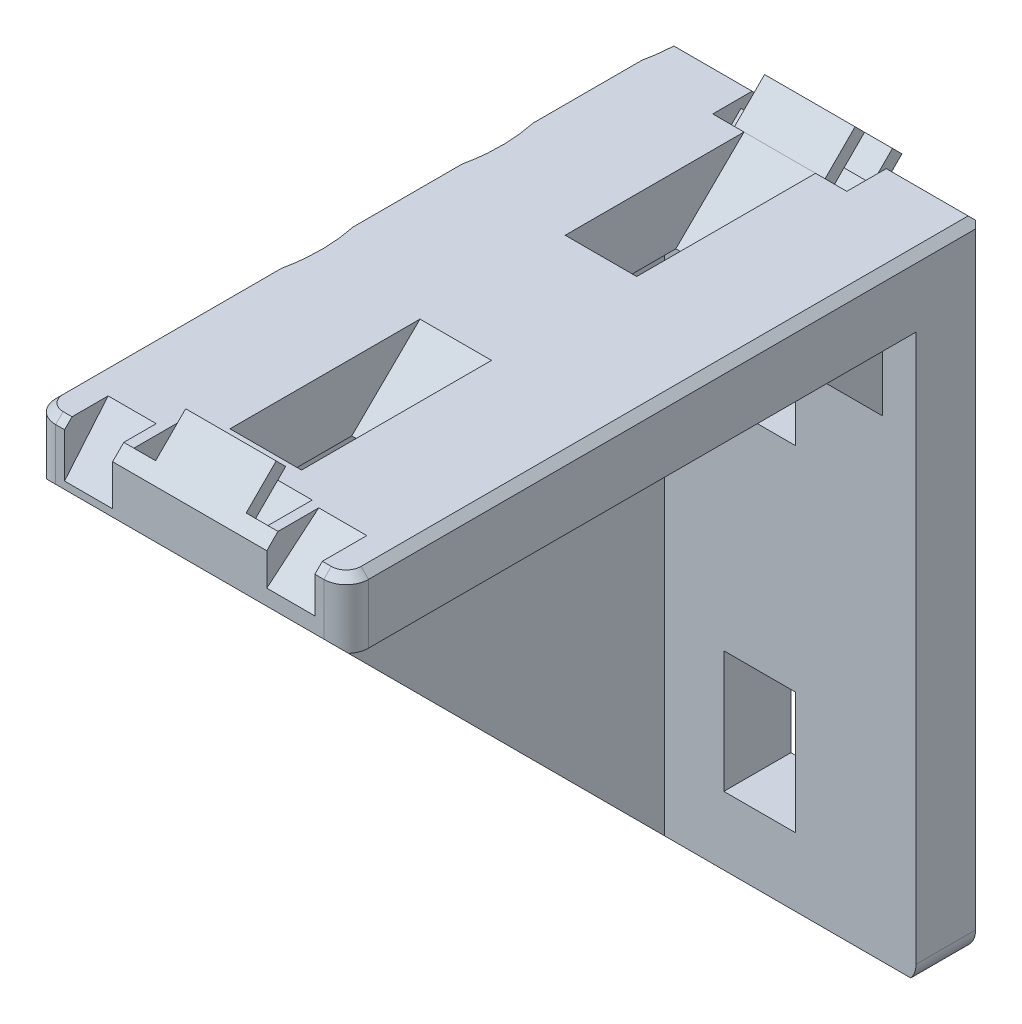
ISO-10303-21;
HEADER;
FILE_DESCRIPTION(('STEP AP214'),'2;1');
FILE_NAME('part.step','',(''),(''),'','','');
FILE_SCHEMA(('AUTOMOTIVE_DESIGN { 1 0 10303 214 1 1 1 1 }'));
ENDSEC;
DATA;
#1=APPLICATION_CONTEXT('core data for automotive mechanical design processes');
#2=APPLICATION_PROTOCOL_DEFINITION('international standard','automotive_design',2000,#1);
#3=PRODUCT_CONTEXT('',#1,'mechanical');
#4=PRODUCT('Part','Part','',(#3));
#5=PRODUCT_RELATED_PRODUCT_CATEGORY('part','',(#4));
#6=PRODUCT_DEFINITION_FORMATION('','',#4);
#7=PRODUCT_DEFINITION_CONTEXT('part definition',#1,'design');
#8=PRODUCT_DEFINITION('design','',#6,#7);
#9=PRODUCT_DEFINITION_SHAPE('','',#8);
#10=(LENGTH_UNIT() NAMED_UNIT(*) SI_UNIT(.MILLI.,.METRE.));
#11=(NAMED_UNIT(*) PLANE_ANGLE_UNIT() SI_UNIT($,.RADIAN.));
#12=(NAMED_UNIT(*) SI_UNIT($,.STERADIAN.) SOLID_ANGLE_UNIT());
#13=UNCERTAINTY_MEASURE_WITH_UNIT(LENGTH_MEASURE(1.E-05),#10,'distance_accuracy_value','');
#14=(GEOMETRIC_REPRESENTATION_CONTEXT(3) GLOBAL_UNCERTAINTY_ASSIGNED_CONTEXT((#13)) GLOBAL_UNIT_ASSIGNED_CONTEXT((#10,
#11,#12)) REPRESENTATION_CONTEXT('',''));
#15=CARTESIAN_POINT('',(0.,0.,0.));
#16=DIRECTION('',(0.,0.,1.));
#17=DIRECTION('',(1.,0.,0.));
#18=AXIS2_PLACEMENT_3D('',#15,#16,#17);
#19=CARTESIAN_POINT('',(6.,-1.24864968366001,1.24864968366));
#20=DIRECTION('',(0.,-0.707106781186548,0.707106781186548));
#21=DIRECTION('',(0.,-0.707106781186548,-0.707106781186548));
#22=AXIS2_PLACEMENT_3D('',#19,#20,#21);
#23=PLANE('',#22);
#24=DIRECTION('',(1.,0.,0.));
#25=VECTOR('',#24,1.);
#26=CARTESIAN_POINT('',(6.,-1.67291375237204,0.82438561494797));
#27=LINE('',#26,#25);
#28=CARTESIAN_POINT('',(6.,-1.67291375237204,0.82438561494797));
#29=VERTEX_POINT('',#28);
#30=CARTESIAN_POINT('',(-6.00000000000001,-1.67291375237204,0.82438561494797));
#31=VERTEX_POINT('',#30);
#32=EDGE_CURVE('E1038',#29,#31,#27,.F.);
#33=ORIENTED_EDGE('',*,*,#32,.T.);
#34=DIRECTION('',(0.,-0.707106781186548,-0.707106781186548));
#35=VECTOR('',#34,1.);
#36=CARTESIAN_POINT('',(-6.00000000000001,-1.24864968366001,1.24864968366));
#37=LINE('',#36,#35);
#38=CARTESIAN_POINT('',(-6.00000000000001,-0.824385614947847,1.67291375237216));
#39=VERTEX_POINT('',#38);
#40=EDGE_CURVE('E1087',#39,#31,#37,.T.);
#41=ORIENTED_EDGE('',*,*,#40,.F.);
#42=DIRECTION('',(1.,0.,0.));
#43=VECTOR('',#42,1.);
#44=CARTESIAN_POINT('',(6.,-0.824385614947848,1.67291375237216));
#45=LINE('',#44,#43);
#46=CARTESIAN_POINT('',(6.,-0.824385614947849,1.67291375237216));
#47=VERTEX_POINT('',#46);
#48=EDGE_CURVE('E1067',#47,#39,#45,.F.);
#49=ORIENTED_EDGE('',*,*,#48,.F.);
#50=DIRECTION('',(0.,-0.707106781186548,-0.707106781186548));
#51=VECTOR('',#50,1.);
#52=CARTESIAN_POINT('',(6.,-1.24864968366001,1.24864968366));
#53=LINE('',#52,#51);
#54=EDGE_CURVE('E1068',#29,#47,#53,.F.);
#55=ORIENTED_EDGE('',*,*,#54,.F.);
#56=EDGE_LOOP('',(#33,#41,#49,#55));
#57=FACE_BOUND('',#56,.T.);
#58=ADVANCED_FACE('F15',(#57),#23,.F.);
#59=CARTESIAN_POINT('',(-4.05,1.83847763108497,0.6588217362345));
#60=DIRECTION('',(0.,0.707106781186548,0.707106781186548));
#61=DIRECTION('',(0.,-0.707106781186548,0.707106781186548));
#62=AXIS2_PLACEMENT_3D('',#59,#60,#61);
#63=PLANE('',#62);
#64=DIRECTION('',(0.,-0.707106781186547,0.707106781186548));
#65=VECTOR('',#64,1.);
#66=CARTESIAN_POINT('',(-4.05,1.8384776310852,0.65882173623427));
#67=LINE('',#66,#65);
#68=CARTESIAN_POINT('',(-4.05,1.8384776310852,0.65882173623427));
#69=VERTEX_POINT('',#68);
#70=CARTESIAN_POINT('',(-4.05,-0.848528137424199,3.34582750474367));
#71=VERTEX_POINT('',#70);
#72=EDGE_CURVE('E1037',#69,#71,#67,.T.);
#73=ORIENTED_EDGE('',*,*,#72,.F.);
#74=DIRECTION('',(1.,0.,0.));
#75=VECTOR('',#74,1.);
#76=CARTESIAN_POINT('',(-4.05,1.8384776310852,0.65882173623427));
#77=LINE('',#76,#75);
#78=CARTESIAN_POINT('',(4.05,1.8384776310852,0.65882173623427));
#79=VERTEX_POINT('',#78);
#80=EDGE_CURVE('E959',#69,#79,#77,.T.);
#81=ORIENTED_EDGE('',*,*,#80,.T.);
#82=DIRECTION('',(0.,-0.707106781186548,0.707106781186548));
#83=VECTOR('',#82,1.);
#84=CARTESIAN_POINT('',(4.05,1.8384776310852,0.65882173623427));
#85=LINE('',#84,#83);
#86=CARTESIAN_POINT('',(4.05,-0.8485281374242,3.34582750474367));
#87=VERTEX_POINT('',#86);
#88=EDGE_CURVE('E927',#79,#87,#85,.T.);
#89=ORIENTED_EDGE('',*,*,#88,.T.);
#90=DIRECTION('',(1.,0.,0.));
#91=VECTOR('',#90,1.);
#92=CARTESIAN_POINT('',(6.,-0.8485281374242,3.34582750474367));
#93=LINE('',#92,#91);
#94=EDGE_CURVE('E878',#71,#87,#93,.T.);
#95=ORIENTED_EDGE('',*,*,#94,.F.);
#96=EDGE_LOOP('',(#73,#81,#89,#95));
#97=FACE_BOUND('',#96,.T.);
#98=ADVANCED_FACE('F1430',(#97),#63,.F.);
#99=CARTESIAN_POINT('',(6.,-0.824385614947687,1.672913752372));
#100=DIRECTION('',(0.,0.707106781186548,0.707106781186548));
#101=DIRECTION('',(0.,-0.707106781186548,0.707106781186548));
#102=AXIS2_PLACEMENT_3D('',#99,#100,#101);
#103=PLANE('',#102);
#104=DIRECTION('',(0.,-0.707106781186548,0.707106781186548));
#105=VECTOR('',#104,1.);
#106=CARTESIAN_POINT('',(-6.00000000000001,-0.824385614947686,1.672913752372));
#107=LINE('',#106,#105);
#108=CARTESIAN_POINT('',(-6.00000000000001,-1.67291375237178,2.52144188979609));
#109=VERTEX_POINT('',#108);
#110=EDGE_CURVE('E1053',#39,#109,#107,.T.);
#111=ORIENTED_EDGE('',*,*,#110,.T.);
#112=DIRECTION('',(1.,0.,0.));
#113=VECTOR('',#112,1.);
#114=CARTESIAN_POINT('',(6.,-1.67291375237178,2.52144188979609));
#115=LINE('',#114,#113);
#116=CARTESIAN_POINT('',(6.,-1.67291375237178,2.52144188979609));
#117=VERTEX_POINT('',#116);
#118=EDGE_CURVE('E877',#117,#109,#115,.F.);
#119=ORIENTED_EDGE('',*,*,#118,.F.);
#120=DIRECTION('',(0.,-0.707106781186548,0.707106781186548));
#121=VECTOR('',#120,1.);
#122=CARTESIAN_POINT('',(6.,-0.824385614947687,1.672913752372));
#123=LINE('',#122,#121);
#124=EDGE_CURVE('E1065',#117,#47,#123,.F.);
#125=ORIENTED_EDGE('',*,*,#124,.T.);
#126=ORIENTED_EDGE('',*,*,#48,.T.);
#127=EDGE_LOOP('',(#111,#119,#125,#126));
#128=FACE_BOUND('',#127,.T.);
#129=ADVANCED_FACE('F1427',(#128),#103,.T.);
#130=CARTESIAN_POINT('',(6.,-1.67291375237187,0.8243856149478));
#131=DIRECTION('',(0.,0.707106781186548,0.707106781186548));
#132=DIRECTION('',(0.,-0.707106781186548,0.707106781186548));
#133=AXIS2_PLACEMENT_3D('',#130,#131,#132);
#134=PLANE('',#133);
#135=DIRECTION('',(1.,0.,0.));
#136=VECTOR('',#135,1.);
#137=CARTESIAN_POINT('',(6.,-2.52144188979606,1.67291375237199));
#138=LINE('',#137,#136);
#139=CARTESIAN_POINT('',(6.,-2.52144188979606,1.67291375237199));
#140=VERTEX_POINT('',#139);
#141=CARTESIAN_POINT('',(-6.00000000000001,-2.52144188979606,1.67291375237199));
#142=VERTEX_POINT('',#141);
#143=EDGE_CURVE('E778',#140,#142,#138,.F.);
#144=ORIENTED_EDGE('',*,*,#143,.T.);
#145=DIRECTION('',(0.,-0.707106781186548,0.707106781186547));
#146=VECTOR('',#145,1.);
#147=CARTESIAN_POINT('',(-6.,-1.67291375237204,0.82438561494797));
#148=LINE('',#147,#146);
#149=EDGE_CURVE('E597',#31,#142,#148,.T.);
#150=ORIENTED_EDGE('',*,*,#149,.F.);
#151=ORIENTED_EDGE('',*,*,#32,.F.);
#152=DIRECTION('',(0.,-0.707106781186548,0.707106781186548));
#153=VECTOR('',#152,1.);
#154=CARTESIAN_POINT('',(6.,-1.67291375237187,0.8243856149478));
#155=LINE('',#154,#153);
#156=EDGE_CURVE('E1034',#140,#29,#155,.F.);
#157=ORIENTED_EDGE('',*,*,#156,.F.);
#158=EDGE_LOOP('',(#144,#150,#151,#157));
#159=FACE_BOUND('',#158,.T.);
#160=ADVANCED_FACE('F1423',(#159),#134,.F.);
#161=CARTESIAN_POINT('',(-4.05,-0.658821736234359,-1.838477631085));
#162=DIRECTION('',(0.,0.707106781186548,0.707106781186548));
#163=DIRECTION('',(0.,-0.707106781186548,0.707106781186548));
#164=AXIS2_PLACEMENT_3D('',#161,#162,#163);
#165=PLANE('',#164);
#166=DIRECTION('',(1.,0.,0.));
#167=VECTOR('',#166,1.);
#168=CARTESIAN_POINT('',(-4.05,-0.65882173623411,-1.83847763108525));
#169=LINE('',#168,#167);
#170=CARTESIAN_POINT('',(-4.05,-0.65882173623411,-1.83847763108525));
#171=VERTEX_POINT('',#170);
#172=CARTESIAN_POINT('',(4.05,-0.658821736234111,-1.83847763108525));
#173=VERTEX_POINT('',#172);
#174=EDGE_CURVE('E821',#171,#173,#169,.T.);
#175=ORIENTED_EDGE('',*,*,#174,.F.);
#176=DIRECTION('',(0.,-0.707106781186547,0.707106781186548));
#177=VECTOR('',#176,1.);
#178=CARTESIAN_POINT('',(-4.05,-0.65882173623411,-1.83847763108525));
#179=LINE('',#178,#177);
#180=CARTESIAN_POINT('',(-4.05,-3.3458275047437,0.848528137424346));
#181=VERTEX_POINT('',#180);
#182=EDGE_CURVE('E831',#171,#181,#179,.T.);
#183=ORIENTED_EDGE('',*,*,#182,.T.);
#184=DIRECTION('',(1.,0.,0.));
#185=VECTOR('',#184,1.);
#186=CARTESIAN_POINT('',(6.,-3.3458275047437,0.848528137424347));
#187=LINE('',#186,#185);
#188=CARTESIAN_POINT('',(4.05,-3.3458275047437,0.848528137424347));
#189=VERTEX_POINT('',#188);
#190=EDGE_CURVE('E845',#181,#189,#187,.T.);
#191=ORIENTED_EDGE('',*,*,#190,.T.);
#192=DIRECTION('',(0.,-0.707106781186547,0.707106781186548));
#193=VECTOR('',#192,1.);
#194=CARTESIAN_POINT('',(4.05,-0.658821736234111,-1.83847763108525));
#195=LINE('',#194,#193);
#196=EDGE_CURVE('E598',#173,#189,#195,.T.);
#197=ORIENTED_EDGE('',*,*,#196,.F.);
#198=EDGE_LOOP('',(#175,#183,#191,#197));
#199=FACE_BOUND('',#198,.T.);
#200=ADVANCED_FACE('F1419',(#199),#165,.T.);
#201=CARTESIAN_POINT('',(-4.05000000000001,-52.4644660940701,-1.838477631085));
#202=DIRECTION('',(0.,0.707106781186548,0.707106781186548));
#203=DIRECTION('',(0.,-0.707106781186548,0.707106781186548));
#204=AXIS2_PLACEMENT_3D('',#201,#202,#203);
#205=PLANE('',#204);
#206=DIRECTION('',(1.,0.,0.));
#207=VECTOR('',#206,1.);
#208=CARTESIAN_POINT('',(-4.05000000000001,-52.464466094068,-1.8384776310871));
#209=LINE('',#208,#207);
#210=CARTESIAN_POINT('',(-4.05000000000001,-52.464466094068,-1.8384776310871));
#211=VERTEX_POINT('',#210);
#212=CARTESIAN_POINT('',(4.04999999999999,-52.464466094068,-1.8384776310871));
#213=VERTEX_POINT('',#212);
#214=EDGE_CURVE('E707',#211,#213,#209,.T.);
#215=ORIENTED_EDGE('',*,*,#214,.F.);
#216=DIRECTION('',(0.,-0.707106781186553,0.707106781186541));
#217=VECTOR('',#216,1.);
#218=CARTESIAN_POINT('',(-4.05000000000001,-52.464466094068,-1.8384776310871));
#219=LINE('',#218,#217);
#220=CARTESIAN_POINT('',(-4.05000000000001,-55.1514718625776,0.848528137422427));
#221=VERTEX_POINT('',#220);
#222=EDGE_CURVE('E697',#211,#221,#219,.T.);
#223=ORIENTED_EDGE('',*,*,#222,.T.);
#224=DIRECTION('',(1.,0.,0.));
#225=VECTOR('',#224,1.);
#226=CARTESIAN_POINT('',(-6.00000000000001,-55.1514718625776,0.848528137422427));
#227=LINE('',#226,#225);
#228=CARTESIAN_POINT('',(4.04999999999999,-55.1514718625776,0.848528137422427));
#229=VERTEX_POINT('',#228);
#230=EDGE_CURVE('E686',#221,#229,#227,.T.);
#231=ORIENTED_EDGE('',*,*,#230,.T.);
#232=DIRECTION('',(0.,-0.707106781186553,0.707106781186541));
#233=VECTOR('',#232,1.);
#234=CARTESIAN_POINT('',(4.04999999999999,-52.464466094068,-1.8384776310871));
#235=LINE('',#234,#233);
#236=EDGE_CURVE('E735',#213,#229,#235,.T.);
#237=ORIENTED_EDGE('',*,*,#236,.F.);
#238=EDGE_LOOP('',(#215,#223,#231,#237));
#239=FACE_BOUND('',#238,.T.);
#240=ADVANCED_FACE('F1415',(#239),#205,.T.);
#241=CARTESIAN_POINT('',(-4.05,1.83847763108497,52.46446609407));
#242=DIRECTION('',(0.,0.707106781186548,0.707106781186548));
#243=DIRECTION('',(0.,-0.707106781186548,0.707106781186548));
#244=AXIS2_PLACEMENT_3D('',#241,#242,#243);
#245=PLANE('',#244);
#246=DIRECTION('',(0.,-0.707106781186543,0.707106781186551));
#247=VECTOR('',#246,1.);
#248=CARTESIAN_POINT('',(-4.05,1.83847763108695,52.464466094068));
#249=LINE('',#248,#247);
#250=CARTESIAN_POINT('',(-4.05,1.83847763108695,52.464466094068));
#251=VERTEX_POINT('',#250);
#252=CARTESIAN_POINT('',(-4.05,-0.848528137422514,55.1514718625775));
#253=VERTEX_POINT('',#252);
#254=EDGE_CURVE('E964',#251,#253,#249,.T.);
#255=ORIENTED_EDGE('',*,*,#254,.F.);
#256=DIRECTION('',(1.,0.,0.));
#257=VECTOR('',#256,1.);
#258=CARTESIAN_POINT('',(-4.05,1.83847763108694,52.464466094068));
#259=LINE('',#258,#257);
#260=CARTESIAN_POINT('',(4.05,1.83847763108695,52.464466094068));
#261=VERTEX_POINT('',#260);
#262=EDGE_CURVE('E994',#251,#261,#259,.T.);
#263=ORIENTED_EDGE('',*,*,#262,.T.);
#264=DIRECTION('',(0.,-0.707106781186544,0.707106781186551));
#265=VECTOR('',#264,1.);
#266=CARTESIAN_POINT('',(4.05,1.83847763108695,52.464466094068));
#267=LINE('',#266,#265);
#268=CARTESIAN_POINT('',(4.05000000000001,-0.848528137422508,55.1514718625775));
#269=VERTEX_POINT('',#268);
#270=EDGE_CURVE('E995',#261,#269,#267,.T.);
#271=ORIENTED_EDGE('',*,*,#270,.T.);
#272=DIRECTION('',(1.,0.,0.));
#273=VECTOR('',#272,1.);
#274=CARTESIAN_POINT('',(-6.,-0.848528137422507,55.1514718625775));
#275=LINE('',#274,#273);
#276=EDGE_CURVE('E937',#253,#269,#275,.T.);
#277=ORIENTED_EDGE('',*,*,#276,.F.);
#278=EDGE_LOOP('',(#255,#263,#271,#277));
#279=FACE_BOUND('',#278,.T.);
#280=ADVANCED_FACE('F1411',(#279),#245,.F.);
#281=CARTESIAN_POINT('',(-4.05,0.,0.));
#282=DIRECTION('',(-1.,0.,0.));
#283=DIRECTION('',(0.,-1.,0.));
#284=AXIS2_PLACEMENT_3D('',#281,#282,#283);
#285=PLANE('',#284);
#286=DIRECTION('',(0.,-0.707106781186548,-0.707106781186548));
#287=VECTOR('',#286,1.);
#288=CARTESIAN_POINT('',(-4.05,2.68700576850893,1.507349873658));
#289=LINE('',#288,#287);
#290=CARTESIAN_POINT('',(-4.05,2.68700576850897,1.50734987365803));
#291=VERTEX_POINT('',#290);
#292=EDGE_CURVE('E949',#291,#69,#289,.T.);
#293=ORIENTED_EDGE('',*,*,#292,.T.);
#294=ORIENTED_EDGE('',*,*,#72,.T.);
#295=DIRECTION('',(0.,0.707106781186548,0.707106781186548));
#296=VECTOR('',#295,1.);
#297=CARTESIAN_POINT('',(-4.05,-1.67291375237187,2.521441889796));
#298=LINE('',#297,#296);
#299=CARTESIAN_POINT('',(-4.05,-1.62393450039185E-13,4.19435564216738));
#300=VERTEX_POINT('',#299);
#301=EDGE_CURVE('E967',#300,#71,#298,.F.);
#302=ORIENTED_EDGE('',*,*,#301,.F.);
#303=DIRECTION('',(0.,0.707106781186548,-0.707106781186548));
#304=VECTOR('',#303,1.);
#305=CARTESIAN_POINT('',(-4.05,0.,4.194355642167));
#306=LINE('',#305,#304);
#307=EDGE_CURVE('E954',#300,#291,#306,.T.);
#308=ORIENTED_EDGE('',*,*,#307,.T.);
#309=EDGE_LOOP('',(#293,#294,#302,#308));
#310=FACE_BOUND('',#309,.T.);
#311=ADVANCED_FACE('F1407',(#310),#285,.T.);
#312=CARTESIAN_POINT('',(-4.05,2.68700576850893,1.507349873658));
#313=DIRECTION('',(0.,-0.707106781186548,0.707106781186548));
#314=DIRECTION('',(0.,-0.707106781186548,-0.707106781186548));
#315=AXIS2_PLACEMENT_3D('',#312,#313,#314);
#316=PLANE('',#315);
#317=DIRECTION('',(1.,0.,0.));
#318=VECTOR('',#317,1.);
#319=CARTESIAN_POINT('',(-4.05,2.68700576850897,1.50734987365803));
#320=LINE('',#319,#318);
#321=CARTESIAN_POINT('',(4.05,2.68700576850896,1.50734987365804));
#322=VERTEX_POINT('',#321);
#323=EDGE_CURVE('E890',#291,#322,#320,.T.);
#324=ORIENTED_EDGE('',*,*,#323,.T.);
#325=DIRECTION('',(0.,-0.707106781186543,-0.707106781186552));
#326=VECTOR('',#325,1.);
#327=CARTESIAN_POINT('',(4.05,2.68700576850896,1.50734987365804));
#328=LINE('',#327,#326);
#329=EDGE_CURVE('E946',#322,#79,#328,.T.);
#330=ORIENTED_EDGE('',*,*,#329,.T.);
#331=ORIENTED_EDGE('',*,*,#80,.F.);
#332=ORIENTED_EDGE('',*,*,#292,.F.);
#333=EDGE_LOOP('',(#324,#330,#331,#332));
#334=FACE_BOUND('',#333,.T.);
#335=ADVANCED_FACE('F1403',(#334),#316,.F.);
#336=CARTESIAN_POINT('',(4.05,0.,0.));
#337=DIRECTION('',(-1.,0.,0.));
#338=DIRECTION('',(0.,-1.,0.));
#339=AXIS2_PLACEMENT_3D('',#336,#337,#338);
#340=PLANE('',#339);
#341=ORIENTED_EDGE('',*,*,#88,.F.);
#342=ORIENTED_EDGE('',*,*,#329,.F.);
#343=DIRECTION('',(0.,0.707106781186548,-0.707106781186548));
#344=VECTOR('',#343,1.);
#345=CARTESIAN_POINT('',(4.05,0.,4.194355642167));
#346=LINE('',#345,#344);
#347=CARTESIAN_POINT('',(4.05,-1.09444319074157E-13,4.19435564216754));
#348=VERTEX_POINT('',#347);
#349=EDGE_CURVE('E886',#322,#348,#346,.F.);
#350=ORIENTED_EDGE('',*,*,#349,.T.);
#351=DIRECTION('',(0.,0.707106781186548,0.707106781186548));
#352=VECTOR('',#351,1.);
#353=CARTESIAN_POINT('',(4.05,-1.67291375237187,2.521441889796));
#354=LINE('',#353,#352);
#355=EDGE_CURVE('E875',#87,#348,#354,.T.);
#356=ORIENTED_EDGE('',*,*,#355,.F.);
#357=EDGE_LOOP('',(#341,#342,#350,#356));
#358=FACE_BOUND('',#357,.T.);
#359=ADVANCED_FACE('F1399',(#358),#340,.F.);
#360=CARTESIAN_POINT('',(6.,0.,0.));
#361=DIRECTION('',(1.,0.,0.));
#362=DIRECTION('',(0.,1.,0.));
#363=AXIS2_PLACEMENT_3D('',#360,#361,#362);
#364=PLANE('',#363);
#365=DIRECTION('',(0.,-0.707106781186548,0.707106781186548));
#366=VECTOR('',#365,1.);
#367=CARTESIAN_POINT('',(6.00000000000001,-1.97989898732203,54.02010101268));
#368=LINE('',#367,#366);
#369=CARTESIAN_POINT('',(6.00000000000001,-1.97989898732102,54.020101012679));
#370=VERTEX_POINT('',#369);
#371=CARTESIAN_POINT('',(6.,0.,52.040202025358));
#372=VERTEX_POINT('',#371);
#373=EDGE_CURVE('E918',#370,#372,#368,.F.);
#374=ORIENTED_EDGE('',*,*,#373,.F.);
#375=DIRECTION('',(0.,0.707106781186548,0.707106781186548));
#376=VECTOR('',#375,1.);
#377=CARTESIAN_POINT('',(6.00000000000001,0.,56.));
#378=LINE('',#377,#376);
#379=CARTESIAN_POINT('',(6.,0.,56.));
#380=VERTEX_POINT('',#379);
#381=EDGE_CURVE('E934',#380,#370,#378,.F.);
#382=ORIENTED_EDGE('',*,*,#381,.F.);
#383=DIRECTION('',(0.,0.,1.));
#384=VECTOR('',#383,1.);
#385=CARTESIAN_POINT('',(6.,0.,0.));
#386=LINE('',#385,#384);
#387=EDGE_CURVE('E889',#380,#372,#386,.F.);
#388=ORIENTED_EDGE('',*,*,#387,.T.);
#389=EDGE_LOOP('',(#374,#382,#388));
#390=FACE_BOUND('',#389,.T.);
#391=ADVANCED_FACE('F1395',(#390),#364,.F.);
#392=CARTESIAN_POINT('',(-6.,-1.97989898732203,54.02010101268));
#393=DIRECTION('',(0.,0.707106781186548,0.707106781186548));
#394=DIRECTION('',(0.,-0.707106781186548,0.707106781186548));
#395=AXIS2_PLACEMENT_3D('',#392,#393,#394);
#396=PLANE('',#395);
#397=DIRECTION('',(1.,0.,0.));
#398=VECTOR('',#397,1.);
#399=CARTESIAN_POINT('',(-6.,-1.97989898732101,54.020101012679));
#400=LINE('',#399,#398);
#401=CARTESIAN_POINT('',(-6.,-1.97989898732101,54.020101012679));
#402=VERTEX_POINT('',#401);
#403=EDGE_CURVE('E936',#370,#402,#400,.F.);
#404=ORIENTED_EDGE('',*,*,#403,.F.);
#405=ORIENTED_EDGE('',*,*,#373,.T.);
#406=DIRECTION('',(1.,0.,0.));
#407=VECTOR('',#406,1.);
#408=CARTESIAN_POINT('',(0.,0.,52.040202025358));
#409=LINE('',#408,#407);
#410=CARTESIAN_POINT('',(-6.,0.,52.040202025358));
#411=VERTEX_POINT('',#410);
#412=EDGE_CURVE('E921',#372,#411,#409,.F.);
#413=ORIENTED_EDGE('',*,*,#412,.T.);
#414=DIRECTION('',(0.,0.707106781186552,-0.707106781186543));
#415=VECTOR('',#414,1.);
#416=CARTESIAN_POINT('',(-6.,-1.97989898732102,54.020101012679));
#417=LINE('',#416,#415);
#418=EDGE_CURVE('E916',#402,#411,#417,.T.);
#419=ORIENTED_EDGE('',*,*,#418,.F.);
#420=EDGE_LOOP('',(#404,#405,#413,#419));
#421=FACE_BOUND('',#420,.T.);
#422=ADVANCED_FACE('F1391',(#421),#396,.T.);
#423=CARTESIAN_POINT('',(-6.,0.,0.));
#424=DIRECTION('',(1.,0.,0.));
#425=DIRECTION('',(0.,1.,0.));
#426=AXIS2_PLACEMENT_3D('',#423,#424,#425);
#427=PLANE('',#426);
#428=DIRECTION('',(0.,0.707106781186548,0.707106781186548));
#429=VECTOR('',#428,1.);
#430=CARTESIAN_POINT('',(-6.,0.,56.));
#431=LINE('',#430,#429);
#432=CARTESIAN_POINT('',(-6.00000000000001,0.,56.));
#433=VERTEX_POINT('',#432);
#434=EDGE_CURVE('E988',#402,#433,#431,.T.);
#435=ORIENTED_EDGE('',*,*,#434,.F.);
#436=ORIENTED_EDGE('',*,*,#418,.T.);
#437=DIRECTION('',(0.,0.,1.));
#438=VECTOR('',#437,1.);
#439=CARTESIAN_POINT('',(-6.,0.,0.));
#440=LINE('',#439,#438);
#441=EDGE_CURVE('E609',#411,#433,#440,.T.);
#442=ORIENTED_EDGE('',*,*,#441,.T.);
#443=EDGE_LOOP('',(#435,#436,#442));
#444=FACE_BOUND('',#443,.T.);
#445=ADVANCED_FACE('F1387',(#444),#427,.T.);
#446=CARTESIAN_POINT('',(6.,-1.67291375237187,2.521441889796));
#447=DIRECTION('',(0.,0.707106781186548,-0.707106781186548));
#448=DIRECTION('',(0.,0.707106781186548,0.707106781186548));
#449=AXIS2_PLACEMENT_3D('',#446,#447,#448);
#450=PLANE('',#449);
#451=DIRECTION('',(1.,0.,0.));
#452=VECTOR('',#451,1.);
#453=CARTESIAN_POINT('',(0.,0.,4.19435564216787));
#454=LINE('',#453,#452);
#455=CARTESIAN_POINT('',(-6.,0.,4.19435564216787));
#456=VERTEX_POINT('',#455);
#457=EDGE_CURVE('E913',#456,#300,#454,.T.);
#458=ORIENTED_EDGE('',*,*,#457,.T.);
#459=ORIENTED_EDGE('',*,*,#301,.T.);
#460=ORIENTED_EDGE('',*,*,#94,.T.);
#461=ORIENTED_EDGE('',*,*,#355,.T.);
#462=DIRECTION('',(1.,0.,0.));
#463=VECTOR('',#462,1.);
#464=CARTESIAN_POINT('',(0.,0.,4.19435564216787));
#465=LINE('',#464,#463);
#466=CARTESIAN_POINT('',(6.,0.,4.19435564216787));
#467=VERTEX_POINT('',#466);
#468=EDGE_CURVE('E863',#348,#467,#465,.T.);
#469=ORIENTED_EDGE('',*,*,#468,.T.);
#470=DIRECTION('',(0.,-0.707106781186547,-0.707106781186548));
#471=VECTOR('',#470,1.);
#472=CARTESIAN_POINT('',(6.,0.,4.19435564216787));
#473=LINE('',#472,#471);
#474=EDGE_CURVE('E768',#467,#117,#473,.T.);
#475=ORIENTED_EDGE('',*,*,#474,.T.);
#476=ORIENTED_EDGE('',*,*,#118,.T.);
#477=DIRECTION('',(0.,-0.707106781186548,-0.707106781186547));
#478=VECTOR('',#477,1.);
#479=CARTESIAN_POINT('',(-6.,0.,4.19435564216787));
#480=LINE('',#479,#478);
#481=EDGE_CURVE('E779',#456,#109,#480,.T.);
#482=ORIENTED_EDGE('',*,*,#481,.F.);
#483=EDGE_LOOP('',(#458,#459,#460,#461,#469,#475,#476,#482));
#484=FACE_BOUND('',#483,.T.);
#485=ADVANCED_FACE('F1383',(#484),#450,.T.);
#486=CARTESIAN_POINT('',(-4.05,0.,0.));
#487=DIRECTION('',(1.,0.,0.));
#488=DIRECTION('',(0.,1.,0.));
#489=AXIS2_PLACEMENT_3D('',#486,#487,#488);
#490=PLANE('',#489);
#491=ORIENTED_EDGE('',*,*,#182,.F.);
#492=DIRECTION('',(0.,0.707106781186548,0.707106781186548));
#493=VECTOR('',#492,1.);
#494=CARTESIAN_POINT('',(-4.05,-1.50734987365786,-2.687005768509));
#495=LINE('',#494,#493);
#496=CARTESIAN_POINT('',(-4.05,-1.50734987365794,-2.68700576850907));
#497=VERTEX_POINT('',#496);
#498=EDGE_CURVE('E828',#497,#171,#495,.T.);
#499=ORIENTED_EDGE('',*,*,#498,.F.);
#500=DIRECTION('',(0.,0.707106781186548,-0.707106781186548));
#501=VECTOR('',#500,1.);
#502=CARTESIAN_POINT('',(-4.05,-4.19435564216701,0.));
#503=LINE('',#502,#501);
#504=CARTESIAN_POINT('',(-4.05,-4.19435564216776,2.27124146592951E-13));
#505=VERTEX_POINT('',#504);
#506=EDGE_CURVE('E825',#505,#497,#503,.T.);
#507=ORIENTED_EDGE('',*,*,#506,.F.);
#508=DIRECTION('',(0.,-0.707106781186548,-0.707106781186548));
#509=VECTOR('',#508,1.);
#510=CARTESIAN_POINT('',(-4.05,-2.52144188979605,1.672913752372));
#511=LINE('',#510,#509);
#512=EDGE_CURVE('E842',#505,#181,#511,.F.);
#513=ORIENTED_EDGE('',*,*,#512,.T.);
#514=EDGE_LOOP('',(#491,#499,#507,#513));
#515=FACE_BOUND('',#514,.T.);
#516=ADVANCED_FACE('F1379',(#515),#490,.F.);
#517=CARTESIAN_POINT('',(-4.05,-1.50734987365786,-2.687005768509));
#518=DIRECTION('',(0.,0.707106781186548,-0.707106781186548));
#519=DIRECTION('',(0.,0.707106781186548,0.707106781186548));
#520=AXIS2_PLACEMENT_3D('',#517,#518,#519);
#521=PLANE('',#520);
#522=DIRECTION('',(0.,0.707106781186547,0.707106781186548));
#523=VECTOR('',#522,1.);
#524=CARTESIAN_POINT('',(4.05,-1.50734987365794,-2.68700576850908));
#525=LINE('',#524,#523);
#526=CARTESIAN_POINT('',(4.05,-1.50734987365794,-2.68700576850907));
#527=VERTEX_POINT('',#526);
#528=EDGE_CURVE('E818',#527,#173,#525,.T.);
#529=ORIENTED_EDGE('',*,*,#528,.F.);
#530=DIRECTION('',(1.,0.,0.));
#531=VECTOR('',#530,1.);
#532=CARTESIAN_POINT('',(-4.05,-1.50734987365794,-2.68700576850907));
#533=LINE('',#532,#531);
#534=EDGE_CURVE('E789',#497,#527,#533,.T.);
#535=ORIENTED_EDGE('',*,*,#534,.F.);
#536=ORIENTED_EDGE('',*,*,#498,.T.);
#537=ORIENTED_EDGE('',*,*,#174,.T.);
#538=EDGE_LOOP('',(#529,#535,#536,#537));
#539=FACE_BOUND('',#538,.T.);
#540=ADVANCED_FACE('F1375',(#539),#521,.T.);
#541=CARTESIAN_POINT('',(4.05,0.,0.));
#542=DIRECTION('',(1.,0.,0.));
#543=DIRECTION('',(0.,1.,0.));
#544=AXIS2_PLACEMENT_3D('',#541,#542,#543);
#545=PLANE('',#544);
#546=ORIENTED_EDGE('',*,*,#528,.T.);
#547=ORIENTED_EDGE('',*,*,#196,.T.);
#548=DIRECTION('',(0.,-0.707106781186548,-0.707106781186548));
#549=VECTOR('',#548,1.);
#550=CARTESIAN_POINT('',(4.05,-2.52144188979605,1.672913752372));
#551=LINE('',#550,#549);
#552=CARTESIAN_POINT('',(4.05,-4.19435564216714,1.2970335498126E-13));
#553=VERTEX_POINT('',#552);
#554=EDGE_CURVE('E775',#189,#553,#551,.T.);
#555=ORIENTED_EDGE('',*,*,#554,.T.);
#556=DIRECTION('',(0.,0.707106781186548,-0.707106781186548));
#557=VECTOR('',#556,1.);
#558=CARTESIAN_POINT('',(4.05,-4.19435564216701,0.));
#559=LINE('',#558,#557);
#560=EDGE_CURVE('E787',#527,#553,#559,.F.);
#561=ORIENTED_EDGE('',*,*,#560,.F.);
#562=EDGE_LOOP('',(#546,#547,#555,#561));
#563=FACE_BOUND('',#562,.T.);
#564=ADVANCED_FACE('F1372',(#563),#545,.T.);
#565=CARTESIAN_POINT('',(-13.005946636,0.,0.67));
#566=DIRECTION('',(0.,0.707106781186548,-0.707106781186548));
#567=DIRECTION('',(0.,0.707106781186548,0.707106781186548));
#568=AXIS2_PLACEMENT_3D('',#565,#566,#567);
#569=PLANE('',#568);
#570=DIRECTION('',(-1.,0.,0.));
#571=VECTOR('',#570,1.);
#572=CARTESIAN_POINT('',(-14.,-0.669999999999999,0.));
#573=LINE('',#572,#571);
#574=CARTESIAN_POINT('',(-13.0047808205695,-0.669999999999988,0.));
#575=VERTEX_POINT('',#574);
#576=CARTESIAN_POINT('',(-6.,-0.669999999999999,0.));
#577=VERTEX_POINT('',#576);
#578=EDGE_CURVE('E593',#575,#577,#573,.F.);
#579=ORIENTED_EDGE('',*,*,#578,.F.);
#580=CARTESIAN_POINT('',(-20.59,-0.334999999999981,0.334999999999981));
#581=DIRECTION('',(0.,-0.707106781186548,0.707106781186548));
#582=DIRECTION('',(0.,-0.707106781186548,-0.707106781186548));
#583=AXIS2_PLACEMENT_3D('',#580,#581,#582);
#584=CIRCLE('',#583,7.6);
#585=CARTESIAN_POINT('',(-13.0047808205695,0.,0.669999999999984));
#586=VERTEX_POINT('',#585);
#587=EDGE_CURVE('E18',#575,#586,#584,.T.);
#588=ORIENTED_EDGE('',*,*,#587,.T.);
#589=DIRECTION('',(1.,0.,0.));
#590=VECTOR('',#589,1.);
#591=CARTESIAN_POINT('',(0.,0.,0.670000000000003));
#592=LINE('',#591,#590);
#593=CARTESIAN_POINT('',(-6.,0.,0.670000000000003));
#594=VERTEX_POINT('',#593);
#595=EDGE_CURVE('E592',#586,#594,#592,.T.);
#596=ORIENTED_EDGE('',*,*,#595,.T.);
#597=DIRECTION('',(0.,0.707106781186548,0.707106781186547));
#598=VECTOR('',#597,1.);
#599=CARTESIAN_POINT('',(-6.,-0.670000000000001,0.));
#600=LINE('',#599,#598);
#601=EDGE_CURVE('E809',#577,#594,#600,.T.);
#602=ORIENTED_EDGE('',*,*,#601,.F.);
#603=EDGE_LOOP('',(#579,#588,#596,#602));
#604=FACE_BOUND('',#603,.T.);
#605=ADVANCED_FACE('F590',(#604),#569,.T.);
#606=CARTESIAN_POINT('',(-6.,0.,0.));
#607=DIRECTION('',(1.,0.,0.));
#608=DIRECTION('',(0.,1.,0.));
#609=AXIS2_PLACEMENT_3D('',#606,#607,#608);
#610=PLANE('',#609);
#611=ORIENTED_EDGE('',*,*,#481,.T.);
#612=ORIENTED_EDGE('',*,*,#110,.F.);
#613=ORIENTED_EDGE('',*,*,#40,.T.);
#614=ORIENTED_EDGE('',*,*,#149,.T.);
#615=DIRECTION('',(0.,-0.707106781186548,-0.707106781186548));
#616=VECTOR('',#615,1.);
#617=CARTESIAN_POINT('',(-6.00000000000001,-2.52144188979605,1.672913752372));
#618=LINE('',#617,#616);
#619=CARTESIAN_POINT('',(-6.,-4.19435564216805,0.));
#620=VERTEX_POINT('',#619);
#621=EDGE_CURVE('E846',#142,#620,#618,.T.);
#622=ORIENTED_EDGE('',*,*,#621,.T.);
#623=DIRECTION('',(0.,1.,0.));
#624=VECTOR('',#623,1.);
#625=CARTESIAN_POINT('',(-6.,0.,0.));
#626=LINE('',#625,#624);
#627=EDGE_CURVE('E813',#577,#620,#626,.F.);
#628=ORIENTED_EDGE('',*,*,#627,.F.);
#629=ORIENTED_EDGE('',*,*,#601,.T.);
#630=DIRECTION('',(0.,0.,1.));
#631=VECTOR('',#630,1.);
#632=CARTESIAN_POINT('',(-6.,0.,0.));
#633=LINE('',#632,#631);
#634=EDGE_CURVE('E608',#594,#456,#633,.T.);
#635=ORIENTED_EDGE('',*,*,#634,.T.);
#636=EDGE_LOOP('',(#611,#612,#613,#614,#622,#628,#629,#635));
#637=FACE_BOUND('',#636,.T.);
#638=ADVANCED_FACE('F1365',(#637),#610,.T.);
#639=CARTESIAN_POINT('',(6.,-2.52144188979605,1.672913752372));
#640=DIRECTION('',(0.,-0.707106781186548,0.707106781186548));
#641=DIRECTION('',(0.,-0.707106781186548,-0.707106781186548));
#642=AXIS2_PLACEMENT_3D('',#639,#640,#641);
#643=PLANE('',#642);
#644=ORIENTED_EDGE('',*,*,#512,.F.);
#645=DIRECTION('',(-1.,0.,0.));
#646=VECTOR('',#645,1.);
#647=CARTESIAN_POINT('',(-14.,-4.19435564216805,0.));
#648=LINE('',#647,#646);
#649=EDGE_CURVE('E815',#620,#505,#648,.F.);
#650=ORIENTED_EDGE('',*,*,#649,.F.);
#651=ORIENTED_EDGE('',*,*,#621,.F.);
#652=ORIENTED_EDGE('',*,*,#143,.F.);
#653=DIRECTION('',(0.,-0.707106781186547,-0.707106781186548));
#654=VECTOR('',#653,1.);
#655=CARTESIAN_POINT('',(6.,-2.52144188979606,1.67291375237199));
#656=LINE('',#655,#654);
#657=CARTESIAN_POINT('',(6.,-4.19435564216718,1.73327787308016E-13));
#658=VERTEX_POINT('',#657);
#659=EDGE_CURVE('E759',#140,#658,#656,.T.);
#660=ORIENTED_EDGE('',*,*,#659,.T.);
#661=DIRECTION('',(-1.,0.,0.));
#662=VECTOR('',#661,1.);
#663=CARTESIAN_POINT('',(-14.,-4.19435564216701,0.));
#664=LINE('',#663,#662);
#665=EDGE_CURVE('E763',#553,#658,#664,.F.);
#666=ORIENTED_EDGE('',*,*,#665,.F.);
#667=ORIENTED_EDGE('',*,*,#554,.F.);
#668=ORIENTED_EDGE('',*,*,#190,.F.);
#669=EDGE_LOOP('',(#644,#650,#651,#652,#660,#666,#667,#668));
#670=FACE_BOUND('',#669,.T.);
#671=ADVANCED_FACE('F1361',(#670),#643,.F.);
#672=CARTESIAN_POINT('',(6.,0.,0.));
#673=DIRECTION('',(1.,0.,0.));
#674=DIRECTION('',(0.,1.,0.));
#675=AXIS2_PLACEMENT_3D('',#672,#673,#674);
#676=PLANE('',#675);
#677=ORIENTED_EDGE('',*,*,#659,.F.);
#678=ORIENTED_EDGE('',*,*,#156,.T.);
#679=ORIENTED_EDGE('',*,*,#54,.T.);
#680=ORIENTED_EDGE('',*,*,#124,.F.);
#681=ORIENTED_EDGE('',*,*,#474,.F.);
#682=DIRECTION('',(0.,0.,1.));
#683=VECTOR('',#682,1.);
#684=CARTESIAN_POINT('',(6.,0.,0.));
#685=LINE('',#684,#683);
#686=CARTESIAN_POINT('',(6.,0.,0.669999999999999));
#687=VERTEX_POINT('',#686);
#688=EDGE_CURVE('E858',#467,#687,#685,.F.);
#689=ORIENTED_EDGE('',*,*,#688,.T.);
#690=DIRECTION('',(0.,0.707106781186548,0.707106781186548));
#691=VECTOR('',#690,1.);
#692=CARTESIAN_POINT('',(6.,0.,0.67));
#693=LINE('',#692,#691);
#694=CARTESIAN_POINT('',(6.,-0.67,0.));
#695=VERTEX_POINT('',#694);
#696=EDGE_CURVE('E743',#695,#687,#693,.T.);
#697=ORIENTED_EDGE('',*,*,#696,.F.);
#698=DIRECTION('',(0.,1.,0.));
#699=VECTOR('',#698,1.);
#700=CARTESIAN_POINT('',(6.,0.,0.));
#701=LINE('',#700,#699);
#702=EDGE_CURVE('E755',#658,#695,#701,.T.);
#703=ORIENTED_EDGE('',*,*,#702,.F.);
#704=EDGE_LOOP('',(#677,#678,#679,#680,#681,#689,#697,#703));
#705=FACE_BOUND('',#704,.T.);
#706=ADVANCED_FACE('F1357',(#705),#676,.F.);
#707=CARTESIAN_POINT('',(6.,0.,0.67));
#708=DIRECTION('',(0.,0.707106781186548,-0.707106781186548));
#709=DIRECTION('',(0.,0.707106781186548,0.707106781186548));
#710=AXIS2_PLACEMENT_3D('',#707,#708,#709);
#711=PLANE('',#710);
#712=DIRECTION('',(-1.,0.,0.));
#713=VECTOR('',#712,1.);
#714=CARTESIAN_POINT('',(-14.,-0.67,0.));
#715=LINE('',#714,#713);
#716=CARTESIAN_POINT('',(13.33,-0.67,0.));
#717=VERTEX_POINT('',#716);
#718=EDGE_CURVE('E752',#695,#717,#715,.F.);
#719=ORIENTED_EDGE('',*,*,#718,.F.);
#720=ORIENTED_EDGE('',*,*,#696,.T.);
#721=DIRECTION('',(1.,0.,0.));
#722=VECTOR('',#721,1.);
#723=CARTESIAN_POINT('',(0.,0.,0.669999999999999));
#724=LINE('',#723,#722);
#725=CARTESIAN_POINT('',(13.33,0.,0.669999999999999));
#726=VERTEX_POINT('',#725);
#727=EDGE_CURVE('E749',#687,#726,#724,.T.);
#728=ORIENTED_EDGE('',*,*,#727,.T.);
#729=DIRECTION('',(-0.577350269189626,0.577350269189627,0.577350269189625));
#730=VECTOR('',#729,1.);
#731=CARTESIAN_POINT('',(13.665,-0.335000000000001,0.335000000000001));
#732=LINE('',#731,#730);
#733=CARTESIAN_POINT('',(13.665,-0.335000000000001,0.335000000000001));
#734=VERTEX_POINT('',#733);
#735=EDGE_CURVE('E835',#734,#726,#732,.T.);
#736=ORIENTED_EDGE('',*,*,#735,.F.);
#737=DIRECTION('',(0.577350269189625,0.577350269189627,0.577350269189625));
#738=VECTOR('',#737,1.);
#739=CARTESIAN_POINT('',(13.33,-0.670000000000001,0.));
#740=LINE('',#739,#738);
#741=EDGE_CURVE('E746',#717,#734,#740,.T.);
#742=ORIENTED_EDGE('',*,*,#741,.F.);
#743=EDGE_LOOP('',(#719,#720,#728,#736,#742));
#744=FACE_BOUND('',#743,.T.);
#745=ADVANCED_FACE('F1353',(#744),#711,.T.);
#746=CARTESIAN_POINT('',(6.,0.,0.));
#747=DIRECTION('',(-1.,0.,0.));
#748=DIRECTION('',(0.,-1.,0.));
#749=AXIS2_PLACEMENT_3D('',#746,#747,#748);
#750=PLANE('',#749);
#751=DIRECTION('',(0.,-0.707106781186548,-0.707106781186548));
#752=VECTOR('',#751,1.);
#753=CARTESIAN_POINT('',(6.,-56.,0.));
#754=LINE('',#753,#752);
#755=CARTESIAN_POINT('',(6.,-56.,0.));
#756=VERTEX_POINT('',#755);
#757=CARTESIAN_POINT('',(6.,-54.020101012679,1.979898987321));
#758=VERTEX_POINT('',#757);
#759=EDGE_CURVE('E718',#756,#758,#754,.F.);
#760=ORIENTED_EDGE('',*,*,#759,.T.);
#761=DIRECTION('',(0.,-0.707106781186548,0.707106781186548));
#762=VECTOR('',#761,1.);
#763=CARTESIAN_POINT('',(6.,-54.02010101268,1.979898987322));
#764=LINE('',#763,#762);
#765=CARTESIAN_POINT('',(5.99999999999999,-52.040202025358,0.));
#766=VERTEX_POINT('',#765);
#767=EDGE_CURVE('E736',#758,#766,#764,.F.);
#768=ORIENTED_EDGE('',*,*,#767,.T.);
#769=DIRECTION('',(0.,1.,0.));
#770=VECTOR('',#769,1.);
#771=CARTESIAN_POINT('',(5.99999999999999,0.,0.));
#772=LINE('',#771,#770);
#773=EDGE_CURVE('E663',#756,#766,#772,.T.);
#774=ORIENTED_EDGE('',*,*,#773,.F.);
#775=EDGE_LOOP('',(#760,#768,#774));
#776=FACE_BOUND('',#775,.T.);
#777=ADVANCED_FACE('F1349',(#776),#750,.T.);
#778=CARTESIAN_POINT('',(-6.00000000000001,-54.02010101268,1.979898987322));
#779=DIRECTION('',(0.,0.707106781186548,0.707106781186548));
#780=DIRECTION('',(0.,-0.707106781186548,0.707106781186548));
#781=AXIS2_PLACEMENT_3D('',#778,#779,#780);
#782=PLANE('',#781);
#783=ORIENTED_EDGE('',*,*,#767,.F.);
#784=DIRECTION('',(1.,0.,0.));
#785=VECTOR('',#784,1.);
#786=CARTESIAN_POINT('',(-6.00000000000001,-54.020101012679,1.979898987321));
#787=LINE('',#786,#785);
#788=CARTESIAN_POINT('',(-6.00000000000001,-54.020101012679,1.979898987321));
#789=VERTEX_POINT('',#788);
#790=EDGE_CURVE('E681',#758,#789,#787,.F.);
#791=ORIENTED_EDGE('',*,*,#790,.T.);
#792=DIRECTION('',(0.,0.707106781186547,-0.707106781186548));
#793=VECTOR('',#792,1.);
#794=CARTESIAN_POINT('',(-6.00000000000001,-54.020101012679,1.979898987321));
#795=LINE('',#794,#793);
#796=CARTESIAN_POINT('',(-6.00000000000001,-52.040202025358,0.));
#797=VERTEX_POINT('',#796);
#798=EDGE_CURVE('E732',#789,#797,#795,.T.);
#799=ORIENTED_EDGE('',*,*,#798,.T.);
#800=DIRECTION('',(-1.,0.,0.));
#801=VECTOR('',#800,1.);
#802=CARTESIAN_POINT('',(-14.,-52.040202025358,0.));
#803=LINE('',#802,#801);
#804=EDGE_CURVE('E657',#766,#797,#803,.T.);
#805=ORIENTED_EDGE('',*,*,#804,.F.);
#806=EDGE_LOOP('',(#783,#791,#799,#805));
#807=FACE_BOUND('',#806,.T.);
#808=ADVANCED_FACE('F1345',(#807),#782,.F.);
#809=CARTESIAN_POINT('',(-6.,0.,0.));
#810=DIRECTION('',(-1.,0.,0.));
#811=DIRECTION('',(0.,-1.,0.));
#812=AXIS2_PLACEMENT_3D('',#809,#810,#811);
#813=PLANE('',#812);
#814=ORIENTED_EDGE('',*,*,#798,.F.);
#815=DIRECTION('',(0.,-0.707106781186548,-0.707106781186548));
#816=VECTOR('',#815,1.);
#817=CARTESIAN_POINT('',(-6.00000000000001,-56.,0.));
#818=LINE('',#817,#816);
#819=CARTESIAN_POINT('',(-6.00000000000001,-56.,0.));
#820=VERTEX_POINT('',#819);
#821=EDGE_CURVE('E678',#789,#820,#818,.T.);
#822=ORIENTED_EDGE('',*,*,#821,.T.);
#823=DIRECTION('',(0.,1.,0.));
#824=VECTOR('',#823,1.);
#825=CARTESIAN_POINT('',(-6.00000000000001,0.,0.));
#826=LINE('',#825,#824);
#827=EDGE_CURVE('E651',#797,#820,#826,.F.);
#828=ORIENTED_EDGE('',*,*,#827,.F.);
#829=EDGE_LOOP('',(#814,#822,#828));
#830=FACE_BOUND('',#829,.T.);
#831=ADVANCED_FACE('F1341',(#830),#813,.F.);
#832=CARTESIAN_POINT('',(4.05,0.,0.));
#833=DIRECTION('',(1.,0.,0.));
#834=DIRECTION('',(0.,1.,0.));
#835=AXIS2_PLACEMENT_3D('',#832,#833,#834);
#836=PLANE('',#835);
#837=DIRECTION('',(0.,0.707106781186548,0.707106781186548));
#838=VECTOR('',#837,1.);
#839=CARTESIAN_POINT('',(4.04999999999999,-53.3129942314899,-2.687005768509));
#840=LINE('',#839,#838);
#841=CARTESIAN_POINT('',(4.05,-53.3129942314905,-2.68700576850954));
#842=VERTEX_POINT('',#841);
#843=EDGE_CURVE('E698',#213,#842,#840,.F.);
#844=ORIENTED_EDGE('',*,*,#843,.F.);
#845=ORIENTED_EDGE('',*,*,#236,.T.);
#846=DIRECTION('',(0.,-0.707106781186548,-0.707106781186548));
#847=VECTOR('',#846,1.);
#848=CARTESIAN_POINT('',(4.04999999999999,-56.,0.));
#849=LINE('',#848,#847);
#850=CARTESIAN_POINT('',(4.05,-56.,0.));
#851=VERTEX_POINT('',#850);
#852=EDGE_CURVE('E715',#229,#851,#849,.T.);
#853=ORIENTED_EDGE('',*,*,#852,.T.);
#854=DIRECTION('',(0.,-0.707106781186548,0.707106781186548));
#855=VECTOR('',#854,1.);
#856=CARTESIAN_POINT('',(4.04999999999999,-57.,0.999999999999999));
#857=LINE('',#856,#855);
#858=EDGE_CURVE('E703',#851,#842,#857,.F.);
#859=ORIENTED_EDGE('',*,*,#858,.T.);
#860=EDGE_LOOP('',(#844,#845,#853,#859));
#861=FACE_BOUND('',#860,.T.);
#862=ADVANCED_FACE('F1337',(#861),#836,.T.);
#863=CARTESIAN_POINT('',(-4.05000000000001,-53.3129942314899,-2.687005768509));
#864=DIRECTION('',(0.,0.707106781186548,-0.707106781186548));
#865=DIRECTION('',(0.,0.707106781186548,0.707106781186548));
#866=AXIS2_PLACEMENT_3D('',#863,#864,#865);
#867=PLANE('',#866);
#868=ORIENTED_EDGE('',*,*,#843,.T.);
#869=DIRECTION('',(1.,0.,0.));
#870=VECTOR('',#869,1.);
#871=CARTESIAN_POINT('',(-6.90000000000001,-53.3129942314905,-2.68700576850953));
#872=LINE('',#871,#870);
#873=CARTESIAN_POINT('',(-4.05000000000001,-53.3129942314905,-2.68700576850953));
#874=VERTEX_POINT('',#873);
#875=EDGE_CURVE('E691',#842,#874,#872,.F.);
#876=ORIENTED_EDGE('',*,*,#875,.T.);
#877=DIRECTION('',(0.,0.707106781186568,0.707106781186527));
#878=VECTOR('',#877,1.);
#879=CARTESIAN_POINT('',(-4.05000000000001,-53.3129942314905,-2.68700576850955));
#880=LINE('',#879,#878);
#881=EDGE_CURVE('E694',#874,#211,#880,.T.);
#882=ORIENTED_EDGE('',*,*,#881,.T.);
#883=ORIENTED_EDGE('',*,*,#214,.T.);
#884=EDGE_LOOP('',(#868,#876,#882,#883));
#885=FACE_BOUND('',#884,.T.);
#886=ADVANCED_FACE('F1333',(#885),#867,.T.);
#887=CARTESIAN_POINT('',(-4.05,0.,0.));
#888=DIRECTION('',(1.,0.,0.));
#889=DIRECTION('',(0.,1.,0.));
#890=AXIS2_PLACEMENT_3D('',#887,#888,#889);
#891=PLANE('',#890);
#892=ORIENTED_EDGE('',*,*,#222,.F.);
#893=ORIENTED_EDGE('',*,*,#881,.F.);
#894=DIRECTION('',(0.,-0.707106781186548,0.707106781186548));
#895=VECTOR('',#894,1.);
#896=CARTESIAN_POINT('',(-4.05000000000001,-57.,1.));
#897=LINE('',#896,#895);
#898=CARTESIAN_POINT('',(-4.05000000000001,-56.,0.));
#899=VERTEX_POINT('',#898);
#900=EDGE_CURVE('E675',#874,#899,#897,.T.);
#901=ORIENTED_EDGE('',*,*,#900,.T.);
#902=DIRECTION('',(0.,-0.707106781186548,-0.707106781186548));
#903=VECTOR('',#902,1.);
#904=CARTESIAN_POINT('',(-4.05000000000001,-56.,0.));
#905=LINE('',#904,#903);
#906=EDGE_CURVE('E680',#899,#221,#905,.F.);
#907=ORIENTED_EDGE('',*,*,#906,.T.);
#908=EDGE_LOOP('',(#892,#893,#901,#907));
#909=FACE_BOUND('',#908,.T.);
#910=ADVANCED_FACE('F1329',(#909),#891,.F.);
#911=CARTESIAN_POINT('',(-6.00000000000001,-56.,0.));
#912=DIRECTION('',(0.,-0.707106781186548,0.707106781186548));
#913=DIRECTION('',(0.,-0.707106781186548,-0.707106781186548));
#914=AXIS2_PLACEMENT_3D('',#911,#912,#913);
#915=PLANE('',#914);
#916=ORIENTED_EDGE('',*,*,#906,.F.);
#917=DIRECTION('',(1.,0.,0.));
#918=VECTOR('',#917,1.);
#919=CARTESIAN_POINT('',(-6.90000000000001,-56.,0.));
#920=LINE('',#919,#918);
#921=EDGE_CURVE('E671',#899,#820,#920,.F.);
#922=ORIENTED_EDGE('',*,*,#921,.T.);
#923=ORIENTED_EDGE('',*,*,#821,.F.);
#924=ORIENTED_EDGE('',*,*,#790,.F.);
#925=ORIENTED_EDGE('',*,*,#759,.F.);
#926=DIRECTION('',(1.,0.,0.));
#927=VECTOR('',#926,1.);
#928=CARTESIAN_POINT('',(-6.90000000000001,-56.,0.));
#929=LINE('',#928,#927);
#930=EDGE_CURVE('E2188',#756,#851,#929,.F.);
#931=ORIENTED_EDGE('',*,*,#930,.T.);
#932=ORIENTED_EDGE('',*,*,#852,.F.);
#933=ORIENTED_EDGE('',*,*,#230,.F.);
#934=EDGE_LOOP('',(#916,#922,#923,#924,#925,#931,#932,#933));
#935=FACE_BOUND('',#934,.T.);
#936=ADVANCED_FACE('F1325',(#935),#915,.F.);
#937=CARTESIAN_POINT('',(-6.,0.,56.));
#938=DIRECTION('',(0.,0.707106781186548,-0.707106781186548));
#939=DIRECTION('',(0.,0.707106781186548,0.707106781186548));
#940=AXIS2_PLACEMENT_3D('',#937,#938,#939);
#941=PLANE('',#940);
#942=DIRECTION('',(1.,0.,0.));
#943=VECTOR('',#942,1.);
#944=CARTESIAN_POINT('',(6.9,0.,56.));
#945=LINE('',#944,#943);
#946=CARTESIAN_POINT('',(-4.05,0.,56.));
#947=VERTEX_POINT('',#946);
#948=EDGE_CURVE('E2116',#947,#433,#945,.F.);
#949=ORIENTED_EDGE('',*,*,#948,.F.);
#950=DIRECTION('',(0.,0.707106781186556,0.707106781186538));
#951=VECTOR('',#950,1.);
#952=CARTESIAN_POINT('',(-4.05,-0.848528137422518,55.1514718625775));
#953=LINE('',#952,#951);
#954=EDGE_CURVE('E2121',#253,#947,#953,.T.);
#955=ORIENTED_EDGE('',*,*,#954,.F.);
#956=ORIENTED_EDGE('',*,*,#276,.T.);
#957=DIRECTION('',(0.,0.707106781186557,0.707106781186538));
#958=VECTOR('',#957,1.);
#959=CARTESIAN_POINT('',(4.05,-0.84852813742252,55.1514718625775));
#960=LINE('',#959,#958);
#961=CARTESIAN_POINT('',(4.05,0.,56.));
#962=VERTEX_POINT('',#961);
#963=EDGE_CURVE('E991',#269,#962,#960,.T.);
#964=ORIENTED_EDGE('',*,*,#963,.T.);
#965=DIRECTION('',(1.,0.,0.));
#966=VECTOR('',#965,1.);
#967=CARTESIAN_POINT('',(6.9,0.,56.));
#968=LINE('',#967,#966);
#969=EDGE_CURVE('E940',#380,#962,#968,.F.);
#970=ORIENTED_EDGE('',*,*,#969,.F.);
#971=ORIENTED_EDGE('',*,*,#381,.T.);
#972=ORIENTED_EDGE('',*,*,#403,.T.);
#973=ORIENTED_EDGE('',*,*,#434,.T.);
#974=EDGE_LOOP('',(#949,#955,#956,#964,#970,#971,#972,#973));
#975=FACE_BOUND('',#974,.T.);
#976=ADVANCED_FACE('F1321',(#975),#941,.T.);
#977=CARTESIAN_POINT('',(4.05,0.,0.));
#978=DIRECTION('',(-1.,0.,0.));
#979=DIRECTION('',(0.,-1.,0.));
#980=AXIS2_PLACEMENT_3D('',#977,#978,#979);
#981=PLANE('',#980);
#982=ORIENTED_EDGE('',*,*,#270,.F.);
#983=DIRECTION('',(0.,-0.707106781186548,-0.707106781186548));
#984=VECTOR('',#983,1.);
#985=CARTESIAN_POINT('',(4.05,2.68700576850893,53.31299423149));
#986=LINE('',#985,#984);
#987=CARTESIAN_POINT('',(4.05,2.68700576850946,53.3129942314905));
#988=VERTEX_POINT('',#987);
#989=EDGE_CURVE('E2122',#261,#988,#986,.F.);
#990=ORIENTED_EDGE('',*,*,#989,.T.);
#991=DIRECTION('',(0.,-0.707106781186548,0.707106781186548));
#992=VECTOR('',#991,1.);
#993=CARTESIAN_POINT('',(4.05,0.,56.));
#994=LINE('',#993,#992);
#995=EDGE_CURVE('E942',#962,#988,#994,.F.);
#996=ORIENTED_EDGE('',*,*,#995,.F.);
#997=ORIENTED_EDGE('',*,*,#963,.F.);
#998=EDGE_LOOP('',(#982,#990,#996,#997));
#999=FACE_BOUND('',#998,.T.);
#1000=ADVANCED_FACE('F1317',(#999),#981,.F.);
#1001=CARTESIAN_POINT('',(-4.05,2.68700576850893,53.31299423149));
#1002=DIRECTION('',(0.,-0.707106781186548,0.707106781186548));
#1003=DIRECTION('',(0.,-0.707106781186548,-0.707106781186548));
#1004=AXIS2_PLACEMENT_3D('',#1001,#1002,#1003);
#1005=PLANE('',#1004);
#1006=DIRECTION('',(1.,0.,0.));
#1007=VECTOR('',#1006,1.);
#1008=CARTESIAN_POINT('',(6.9,2.68700576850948,53.3129942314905));
#1009=LINE('',#1008,#1007);
#1010=CARTESIAN_POINT('',(-4.05,2.68700576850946,53.3129942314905));
#1011=VERTEX_POINT('',#1010);
#1012=EDGE_CURVE('E1896',#988,#1011,#1009,.F.);
#1013=ORIENTED_EDGE('',*,*,#1012,.F.);
#1014=ORIENTED_EDGE('',*,*,#989,.F.);
#1015=ORIENTED_EDGE('',*,*,#262,.F.);
#1016=DIRECTION('',(0.,-0.707106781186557,-0.707106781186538));
#1017=VECTOR('',#1016,1.);
#1018=CARTESIAN_POINT('',(-4.05,2.68700576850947,53.3129942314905));
#1019=LINE('',#1018,#1017);
#1020=EDGE_CURVE('E984',#1011,#251,#1019,.T.);
#1021=ORIENTED_EDGE('',*,*,#1020,.F.);
#1022=EDGE_LOOP('',(#1013,#1014,#1015,#1021));
#1023=FACE_BOUND('',#1022,.T.);
#1024=ADVANCED_FACE('F1313',(#1023),#1005,.F.);
#1025=CARTESIAN_POINT('',(-4.05,0.,0.));
#1026=DIRECTION('',(-1.,0.,0.));
#1027=DIRECTION('',(0.,-1.,0.));
#1028=AXIS2_PLACEMENT_3D('',#1025,#1026,#1027);
#1029=PLANE('',#1028);
#1030=ORIENTED_EDGE('',*,*,#1020,.T.);
#1031=ORIENTED_EDGE('',*,*,#254,.T.);
#1032=ORIENTED_EDGE('',*,*,#954,.T.);
#1033=DIRECTION('',(0.,-0.707106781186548,0.707106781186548));
#1034=VECTOR('',#1033,1.);
#1035=CARTESIAN_POINT('',(-4.05,0.,56.));
#1036=LINE('',#1035,#1034);
#1037=EDGE_CURVE('E1898',#1011,#947,#1036,.T.);
#1038=ORIENTED_EDGE('',*,*,#1037,.F.);
#1039=EDGE_LOOP('',(#1030,#1031,#1032,#1038));
#1040=FACE_BOUND('',#1039,.T.);
#1041=ADVANCED_FACE('F1309',(#1040),#1029,.T.);
#1042=CARTESIAN_POINT('',(-4.05,0.,4.194355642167));
#1043=DIRECTION('',(0.,-0.707106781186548,-0.707106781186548));
#1044=DIRECTION('',(0.,0.707106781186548,-0.707106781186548));
#1045=AXIS2_PLACEMENT_3D('',#1042,#1043,#1044);
#1046=PLANE('',#1045);
#1047=DIRECTION('',(1.,0.,0.));
#1048=VECTOR('',#1047,1.);
#1049=CARTESIAN_POINT('',(-3.2,2.61943244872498E-13,4.19435564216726));
#1050=LINE('',#1049,#1048);
#1051=CARTESIAN_POINT('',(3.2,0.,4.194355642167));
#1052=VERTEX_POINT('',#1051);
#1053=CARTESIAN_POINT('',(-3.2,0.,4.19435564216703));
#1054=VERTEX_POINT('',#1053);
#1055=EDGE_CURVE('E893',#1052,#1054,#1050,.F.);
#1056=ORIENTED_EDGE('',*,*,#1055,.F.);
#1057=DIRECTION('',(1.,0.,0.));
#1058=VECTOR('',#1057,1.);
#1059=CARTESIAN_POINT('',(0.,0.,4.194355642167));
#1060=LINE('',#1059,#1058);
#1061=EDGE_CURVE('E872',#1052,#348,#1060,.T.);
#1062=ORIENTED_EDGE('',*,*,#1061,.T.);
#1063=ORIENTED_EDGE('',*,*,#349,.F.);
#1064=ORIENTED_EDGE('',*,*,#323,.F.);
#1065=ORIENTED_EDGE('',*,*,#307,.F.);
#1066=DIRECTION('',(1.,0.,0.));
#1067=VECTOR('',#1066,1.);
#1068=CARTESIAN_POINT('',(0.,0.,4.194355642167));
#1069=LINE('',#1068,#1067);
#1070=EDGE_CURVE('E883',#300,#1054,#1069,.T.);
#1071=ORIENTED_EDGE('',*,*,#1070,.T.);
#1072=EDGE_LOOP('',(#1056,#1062,#1063,#1064,#1065,#1071));
#1073=FACE_BOUND('',#1072,.T.);
#1074=ADVANCED_FACE('F1305',(#1073),#1046,.F.);
#1075=CARTESIAN_POINT('',(0.,0.,0.));
#1076=DIRECTION('',(0.,-1.,0.));
#1077=DIRECTION('',(1.,0.,0.));
#1078=AXIS2_PLACEMENT_3D('',#1075,#1076,#1077);
#1079=PLANE('',#1078);
#1080=DIRECTION('',(1.,0.,0.));
#1081=VECTOR('',#1080,1.);
#1082=CARTESIAN_POINT('',(-3.2,0.,33.1943556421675));
#1083=LINE('',#1082,#1081);
#1084=CARTESIAN_POINT('',(3.2,0.,33.1943556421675));
#1085=VERTEX_POINT('',#1084);
#1086=CARTESIAN_POINT('',(-3.2,0.,33.1943556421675));
#1087=VERTEX_POINT('',#1086);
#1088=EDGE_CURVE('E1801',#1085,#1087,#1083,.F.);
#1089=ORIENTED_EDGE('',*,*,#1088,.F.);
#1090=DIRECTION('',(0.,0.,1.));
#1091=VECTOR('',#1090,1.);
#1092=CARTESIAN_POINT('',(3.2,0.,10.3));
#1093=LINE('',#1092,#1091);
#1094=CARTESIAN_POINT('',(3.2,0.,50.2));
#1095=VERTEX_POINT('',#1094);
#1096=EDGE_CURVE('E1796',#1095,#1085,#1093,.F.);
#1097=ORIENTED_EDGE('',*,*,#1096,.F.);
#1098=DIRECTION('',(-1.,0.,0.));
#1099=VECTOR('',#1098,1.);
#1100=CARTESIAN_POINT('',(3.2,0.,50.2));
#1101=LINE('',#1100,#1099);
#1102=CARTESIAN_POINT('',(-3.2,0.,50.2));
#1103=VERTEX_POINT('',#1102);
#1104=EDGE_CURVE('E1808',#1103,#1095,#1101,.F.);
#1105=ORIENTED_EDGE('',*,*,#1104,.F.);
#1106=DIRECTION('',(0.,0.,1.));
#1107=VECTOR('',#1106,1.);
#1108=CARTESIAN_POINT('',(-3.2,0.,20.2));
#1109=LINE('',#1108,#1107);
#1110=EDGE_CURVE('E1806',#1087,#1103,#1109,.T.);
#1111=ORIENTED_EDGE('',*,*,#1110,.F.);
#1112=EDGE_LOOP('',(#1089,#1097,#1105,#1111));
#1113=FACE_BOUND('',#1112,.T.);
#1114=DIRECTION('',(0.,0.,1.));
#1115=VECTOR('',#1114,1.);
#1116=CARTESIAN_POINT('',(13.33,0.,0.));
#1117=LINE('',#1116,#1115);
#1118=CARTESIAN_POINT('',(13.329999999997,-4.26329882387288E-11,55.));
#1119=VERTEX_POINT('',#1118);
#1120=EDGE_CURVE('E748',#726,#1119,#1117,.T.);
#1121=ORIENTED_EDGE('',*,*,#1120,.F.);
#1122=ORIENTED_EDGE('',*,*,#727,.F.);
#1123=ORIENTED_EDGE('',*,*,#688,.F.);
#1124=ORIENTED_EDGE('',*,*,#468,.F.);
#1125=ORIENTED_EDGE('',*,*,#1061,.F.);
#1126=DIRECTION('',(0.,0.,1.));
#1127=VECTOR('',#1126,1.);
#1128=CARTESIAN_POINT('',(3.2,0.,10.3));
#1129=LINE('',#1128,#1127);
#1130=CARTESIAN_POINT('',(3.2,0.,20.2));
#1131=VERTEX_POINT('',#1130);
#1132=EDGE_CURVE('E900',#1131,#1052,#1129,.F.);
#1133=ORIENTED_EDGE('',*,*,#1132,.F.);
#1134=DIRECTION('',(-1.,0.,0.));
#1135=VECTOR('',#1134,1.);
#1136=CARTESIAN_POINT('',(3.2,0.,20.2));
#1137=LINE('',#1136,#1135);
#1138=CARTESIAN_POINT('',(-3.2,0.,20.2));
#1139=VERTEX_POINT('',#1138);
#1140=EDGE_CURVE('E1788',#1139,#1131,#1137,.F.);
#1141=ORIENTED_EDGE('',*,*,#1140,.F.);
#1142=DIRECTION('',(0.,0.,1.));
#1143=VECTOR('',#1142,1.);
#1144=CARTESIAN_POINT('',(-3.2,0.,20.2));
#1145=LINE('',#1144,#1143);
#1146=EDGE_CURVE('E1786',#1054,#1139,#1145,.T.);
#1147=ORIENTED_EDGE('',*,*,#1146,.F.);
#1148=ORIENTED_EDGE('',*,*,#1070,.F.);
#1149=ORIENTED_EDGE('',*,*,#457,.F.);
#1150=ORIENTED_EDGE('',*,*,#634,.F.);
#1151=ORIENTED_EDGE('',*,*,#595,.F.);
#1152=CARTESIAN_POINT('',(-20.59,0.,0.));
#1153=DIRECTION('',(0.,-1.,0.));
#1154=DIRECTION('',(0.,0.,1.));
#1155=AXIS2_PLACEMENT_3D('',#1152,#1153,#1154);
#1156=ELLIPSE('',#1155,10.7480230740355,7.6);
#1157=CARTESIAN_POINT('',(-13.33,0.,3.17880480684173));
#1158=VERTEX_POINT('',#1157);
#1159=EDGE_CURVE('E605',#586,#1158,#1156,.T.);
#1160=ORIENTED_EDGE('',*,*,#1159,.T.);
#1161=DIRECTION('',(0.,0.,1.));
#1162=VECTOR('',#1161,1.);
#1163=CARTESIAN_POINT('',(-13.33,0.,12.94573961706));
#1164=LINE('',#1163,#1162);
#1165=CARTESIAN_POINT('',(-13.33,0.,12.9432298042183));
#1166=VERTEX_POINT('',#1165);
#1167=EDGE_CURVE('E616',#1166,#1158,#1164,.F.);
#1168=ORIENTED_EDGE('',*,*,#1167,.F.);
#1169=CARTESIAN_POINT('',(-20.59,0.,16.12203461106));
#1170=DIRECTION('',(0.,-1.,0.));
#1171=DIRECTION('',(0.,0.,1.));
#1172=AXIS2_PLACEMENT_3D('',#1169,#1170,#1171);
#1173=ELLIPSE('',#1172,10.7480230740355,7.6);
#1174=CARTESIAN_POINT('',(-13.33,0.,19.3008394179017));
#1175=VERTEX_POINT('',#1174);
#1176=EDGE_CURVE('E626',#1166,#1175,#1173,.T.);
#1177=ORIENTED_EDGE('',*,*,#1176,.T.);
#1178=DIRECTION('',(0.,0.,1.));
#1179=VECTOR('',#1178,1.);
#1180=CARTESIAN_POINT('',(-13.33,0.,29.06818262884));
#1181=LINE('',#1180,#1179);
#1182=CARTESIAN_POINT('',(-13.33,0.,29.0652644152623));
#1183=VERTEX_POINT('',#1182);
#1184=EDGE_CURVE('E636',#1183,#1175,#1181,.F.);
#1185=ORIENTED_EDGE('',*,*,#1184,.F.);
#1186=CARTESIAN_POINT('',(-20.59,0.,32.244069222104));
#1187=DIRECTION('',(0.,-1.,0.));
#1188=DIRECTION('',(0.,0.,1.));
#1189=AXIS2_PLACEMENT_3D('',#1186,#1187,#1188);
#1190=ELLIPSE('',#1189,10.7480230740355,7.6);
#1191=CARTESIAN_POINT('',(-13.33,0.,35.4228740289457));
#1192=VERTEX_POINT('',#1191);
#1193=EDGE_CURVE('E637',#1183,#1192,#1190,.T.);
#1194=ORIENTED_EDGE('',*,*,#1193,.T.);
#1195=DIRECTION('',(0.,0.,1.));
#1196=VECTOR('',#1195,1.);
#1197=CARTESIAN_POINT('',(-13.33,0.,55.));
#1198=LINE('',#1197,#1196);
#1199=CARTESIAN_POINT('',(-13.3300000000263,2.84218356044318E-11,55.));
#1200=VERTEX_POINT('',#1199);
#1201=EDGE_CURVE('E644',#1200,#1192,#1198,.F.);
#1202=ORIENTED_EDGE('',*,*,#1201,.F.);
#1203=CARTESIAN_POINT('',(-12.,0.,55.));
#1204=DIRECTION('',(0.,-1.,0.));
#1205=DIRECTION('',(1.,0.,0.));
#1206=AXIS2_PLACEMENT_3D('',#1203,#1204,#1205);
#1207=CIRCLE('',#1206,1.33000000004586);
#1208=CARTESIAN_POINT('',(-12.,0.,56.33));
#1209=VERTEX_POINT('',#1208);
#1210=EDGE_CURVE('E1146',#1209,#1200,#1207,.T.);
#1211=ORIENTED_EDGE('',*,*,#1210,.F.);
#1212=DIRECTION('',(1.,0.,0.));
#1213=VECTOR('',#1212,1.);
#1214=CARTESIAN_POINT('',(-11.2,0.,56.33));
#1215=LINE('',#1214,#1213);
#1216=CARTESIAN_POINT('',(-11.2,0.,56.33));
#1217=VERTEX_POINT('',#1216);
#1218=EDGE_CURVE('E1855',#1217,#1209,#1215,.F.);
#1219=ORIENTED_EDGE('',*,*,#1218,.F.);
#1220=DIRECTION('',(0.,0.,1.));
#1221=VECTOR('',#1220,1.);
#1222=CARTESIAN_POINT('',(-11.2,0.,0.));
#1223=LINE('',#1222,#1221);
#1224=CARTESIAN_POINT('',(-11.2,0.,53.1));
#1225=VERTEX_POINT('',#1224);
#1226=EDGE_CURVE('E1869',#1217,#1225,#1223,.F.);
#1227=ORIENTED_EDGE('',*,*,#1226,.T.);
#1228=DIRECTION('',(1.,0.,0.));
#1229=VECTOR('',#1228,1.);
#1230=CARTESIAN_POINT('',(-11.2,0.,53.1));
#1231=LINE('',#1230,#1229);
#1232=CARTESIAN_POINT('',(-6.9,0.,53.1));
#1233=VERTEX_POINT('',#1232);
#1234=EDGE_CURVE('E1870',#1225,#1233,#1231,.T.);
#1235=ORIENTED_EDGE('',*,*,#1234,.T.);
#1236=DIRECTION('',(0.,0.,1.));
#1237=VECTOR('',#1236,1.);
#1238=CARTESIAN_POINT('',(-6.9,0.,0.));
#1239=LINE('',#1238,#1237);
#1240=CARTESIAN_POINT('',(-6.9,0.,56.));
#1241=VERTEX_POINT('',#1240);
#1242=EDGE_CURVE('E1889',#1241,#1233,#1239,.F.);
#1243=ORIENTED_EDGE('',*,*,#1242,.F.);
#1244=DIRECTION('',(1.,0.,0.));
#1245=VECTOR('',#1244,1.);
#1246=CARTESIAN_POINT('',(6.9,0.,56.));
#1247=LINE('',#1246,#1245);
#1248=EDGE_CURVE('E1903',#433,#1241,#1247,.F.);
#1249=ORIENTED_EDGE('',*,*,#1248,.F.);
#1250=ORIENTED_EDGE('',*,*,#441,.F.);
#1251=ORIENTED_EDGE('',*,*,#412,.F.);
#1252=ORIENTED_EDGE('',*,*,#387,.F.);
#1253=DIRECTION('',(1.,0.,0.));
#1254=VECTOR('',#1253,1.);
#1255=CARTESIAN_POINT('',(6.9,0.,56.));
#1256=LINE('',#1255,#1254);
#1257=CARTESIAN_POINT('',(6.9,0.,56.));
#1258=VERTEX_POINT('',#1257);
#1259=EDGE_CURVE('E943',#1258,#380,#1256,.F.);
#1260=ORIENTED_EDGE('',*,*,#1259,.F.);
#1261=DIRECTION('',(0.,0.,1.));
#1262=VECTOR('',#1261,1.);
#1263=CARTESIAN_POINT('',(6.9,0.,0.));
#1264=LINE('',#1263,#1262);
#1265=CARTESIAN_POINT('',(6.9,0.,52.35216098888));
#1266=VERTEX_POINT('',#1265);
#1267=EDGE_CURVE('E1913',#1258,#1266,#1264,.F.);
#1268=ORIENTED_EDGE('',*,*,#1267,.T.);
#1269=DIRECTION('',(1.,0.,0.));
#1270=VECTOR('',#1269,1.);
#1271=CARTESIAN_POINT('',(11.2,0.,52.35216098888));
#1272=LINE('',#1271,#1270);
#1273=CARTESIAN_POINT('',(11.2,0.,52.35216098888));
#1274=VERTEX_POINT('',#1273);
#1275=EDGE_CURVE('E1922',#1274,#1266,#1272,.F.);
#1276=ORIENTED_EDGE('',*,*,#1275,.F.);
#1277=DIRECTION('',(0.,0.,1.));
#1278=VECTOR('',#1277,1.);
#1279=CARTESIAN_POINT('',(11.2,0.,0.));
#1280=LINE('',#1279,#1278);
#1281=CARTESIAN_POINT('',(11.2,0.,56.33));
#1282=VERTEX_POINT('',#1281);
#1283=EDGE_CURVE('E1931',#1282,#1274,#1280,.F.);
#1284=ORIENTED_EDGE('',*,*,#1283,.F.);
#1285=DIRECTION('',(1.,0.,0.));
#1286=VECTOR('',#1285,1.);
#1287=CARTESIAN_POINT('',(12.,0.,56.33));
#1288=LINE('',#1287,#1286);
#1289=CARTESIAN_POINT('',(12.,-2.84219024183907E-11,56.3299999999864));
#1290=VERTEX_POINT('',#1289);
#1291=EDGE_CURVE('E1935',#1290,#1282,#1288,.F.);
#1292=ORIENTED_EDGE('',*,*,#1291,.F.);
#1293=CARTESIAN_POINT('',(12.,-5.68435272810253E-11,55.));
#1294=DIRECTION('',(0.,-1.,0.));
#1295=DIRECTION('',(1.,0.,0.));
#1296=AXIS2_PLACEMENT_3D('',#1293,#1294,#1295);
#1297=CIRCLE('',#1296,1.33000000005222);
#1298=EDGE_CURVE('E1142',#1119,#1290,#1297,.T.);
#1299=ORIENTED_EDGE('',*,*,#1298,.F.);
#1300=EDGE_LOOP('',(#1121,#1122,#1123,#1124,#1125,#1133,#1141,#1147,#1148,#1149,#1150,#1151,
#1160,#1168,#1177,#1185,#1194,#1202,#1211,#1219,#1227,#1235,#1243,#1249,#1250,#1251,#1252,#1260,
#1268,#1276,#1284,#1292,#1299));
#1301=FACE_BOUND('',#1300,.T.);
#1302=ADVANCED_FACE('F603',(#1113,#1301),#1079,.F.);
#1303=CARTESIAN_POINT('',(14.,0.,0.67));
#1304=DIRECTION('',(0.707106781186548,0.,-0.707106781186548));
#1305=DIRECTION('',(-0.707106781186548,0.,-0.707106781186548));
#1306=AXIS2_PLACEMENT_3D('',#1303,#1304,#1305);
#1307=PLANE('',#1306);
#1308=ORIENTED_EDGE('',*,*,#741,.T.);
#1309=DIRECTION('',(-0.577350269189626,0.577350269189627,-0.577350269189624));
#1310=VECTOR('',#1309,1.);
#1311=CARTESIAN_POINT('',(14.,-0.670000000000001,0.67));
#1312=LINE('',#1311,#1310);
#1313=CARTESIAN_POINT('',(14.,-0.670000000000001,0.67));
#1314=VERTEX_POINT('',#1313);
#1315=EDGE_CURVE('E854',#1314,#734,#1312,.T.);
#1316=ORIENTED_EDGE('',*,*,#1315,.F.);
#1317=DIRECTION('',(0.,1.,0.));
#1318=VECTOR('',#1317,1.);
#1319=CARTESIAN_POINT('',(14.,0.,0.67));
#1320=LINE('',#1319,#1318);
#1321=CARTESIAN_POINT('',(13.9999999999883,-55.,0.669999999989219));
#1322=VERTEX_POINT('',#1321);
#1323=EDGE_CURVE('E1762',#1322,#1314,#1320,.T.);
#1324=ORIENTED_EDGE('',*,*,#1323,.F.);
#1325=DIRECTION('',(-0.707106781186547,0.,-0.707106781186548));
#1326=VECTOR('',#1325,1.);
#1327=CARTESIAN_POINT('',(499000.,-55.,498986.670000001));
#1328=LINE('',#1327,#1326);
#1329=CARTESIAN_POINT('',(13.3299999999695,-55.,-5.684688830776E-11));
#1330=VERTEX_POINT('',#1329);
#1331=EDGE_CURVE('E650',#1330,#1322,#1328,.F.);
#1332=ORIENTED_EDGE('',*,*,#1331,.F.);
#1333=DIRECTION('',(0.,1.,0.));
#1334=VECTOR('',#1333,1.);
#1335=CARTESIAN_POINT('',(13.33,0.,0.));
#1336=LINE('',#1335,#1334);
#1337=EDGE_CURVE('E754',#717,#1330,#1336,.F.);
#1338=ORIENTED_EDGE('',*,*,#1337,.F.);
#1339=EDGE_LOOP('',(#1308,#1316,#1324,#1332,#1338));
#1340=FACE_BOUND('',#1339,.T.);
#1341=ADVANCED_FACE('F1298',(#1340),#1307,.T.);
#1342=CARTESIAN_POINT('',(13.33,0.,0.));
#1343=DIRECTION('',(0.707106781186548,0.707106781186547,0.));
#1344=DIRECTION('',(-0.707106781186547,0.707106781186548,0.));
#1345=AXIS2_PLACEMENT_3D('',#1342,#1343,#1344);
#1346=PLANE('',#1345);
#1347=ORIENTED_EDGE('',*,*,#1315,.T.);
#1348=ORIENTED_EDGE('',*,*,#735,.T.);
#1349=ORIENTED_EDGE('',*,*,#1120,.T.);
#1350=DIRECTION('',(-0.707106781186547,0.707106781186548,0.));
#1351=VECTOR('',#1350,1.);
#1352=CARTESIAN_POINT('',(499013.329999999,-499000.,54.9999999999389));
#1353=LINE('',#1352,#1351);
#1354=CARTESIAN_POINT('',(14.0000000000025,-0.670000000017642,55.));
#1355=VERTEX_POINT('',#1354);
#1356=EDGE_CURVE('E1145',#1355,#1119,#1353,.T.);
#1357=ORIENTED_EDGE('',*,*,#1356,.F.);
#1358=DIRECTION('',(0.,0.,1.));
#1359=VECTOR('',#1358,1.);
#1360=CARTESIAN_POINT('',(14.,-0.670000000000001,0.));
#1361=LINE('',#1360,#1359);
#1362=EDGE_CURVE('E1771',#1314,#1355,#1361,.T.);
#1363=ORIENTED_EDGE('',*,*,#1362,.F.);
#1364=EDGE_LOOP('',(#1347,#1348,#1349,#1357,#1363));
#1365=FACE_BOUND('',#1364,.T.);
#1366=ADVANCED_FACE('F1294',(#1365),#1346,.T.);
#1367=CARTESIAN_POINT('',(-4.05,-4.19435564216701,0.));
#1368=DIRECTION('',(0.,-0.707106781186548,-0.707106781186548));
#1369=DIRECTION('',(0.,0.707106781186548,-0.707106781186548));
#1370=AXIS2_PLACEMENT_3D('',#1367,#1368,#1369);
#1371=PLANE('',#1370);
#1372=DIRECTION('',(-1.,0.,0.));
#1373=VECTOR('',#1372,1.);
#1374=CARTESIAN_POINT('',(-14.,-4.19435564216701,0.));
#1375=LINE('',#1374,#1373);
#1376=CARTESIAN_POINT('',(3.2,-4.19435564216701,0.));
#1377=VERTEX_POINT('',#1376);
#1378=EDGE_CURVE('E772',#1377,#553,#1375,.F.);
#1379=ORIENTED_EDGE('',*,*,#1378,.F.);
#1380=DIRECTION('',(1.,0.,0.));
#1381=VECTOR('',#1380,1.);
#1382=CARTESIAN_POINT('',(-3.2,-4.19435564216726,-2.56739074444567E-13));
#1383=LINE('',#1382,#1381);
#1384=CARTESIAN_POINT('',(-3.20000000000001,-4.1943556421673,0.));
#1385=VERTEX_POINT('',#1384);
#1386=EDGE_CURVE('E799',#1377,#1385,#1383,.F.);
#1387=ORIENTED_EDGE('',*,*,#1386,.T.);
#1388=DIRECTION('',(-1.,0.,0.));
#1389=VECTOR('',#1388,1.);
#1390=CARTESIAN_POINT('',(-14.,-4.19435564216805,0.));
#1391=LINE('',#1390,#1389);
#1392=EDGE_CURVE('E784',#505,#1385,#1391,.F.);
#1393=ORIENTED_EDGE('',*,*,#1392,.F.);
#1394=ORIENTED_EDGE('',*,*,#506,.T.);
#1395=ORIENTED_EDGE('',*,*,#534,.T.);
#1396=ORIENTED_EDGE('',*,*,#560,.T.);
#1397=EDGE_LOOP('',(#1379,#1387,#1393,#1394,#1395,#1396));
#1398=FACE_BOUND('',#1397,.T.);
#1399=ADVANCED_FACE('F1290',(#1398),#1371,.T.);
#1400=CARTESIAN_POINT('',(-14.,0.,0.));
#1401=DIRECTION('',(0.,0.,-1.));
#1402=DIRECTION('',(-1.,0.,0.));
#1403=AXIS2_PLACEMENT_3D('',#1400,#1401,#1402);
#1404=PLANE('',#1403);
#1405=DIRECTION('',(0.,1.,0.));
#1406=VECTOR('',#1405,1.);
#1407=CARTESIAN_POINT('',(3.2,-10.3,0.));
#1408=LINE('',#1407,#1406);
#1409=CARTESIAN_POINT('',(3.19999999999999,-50.2000000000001,0.));
#1410=VERTEX_POINT('',#1409);
#1411=CARTESIAN_POINT('',(3.19999999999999,-33.1943556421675,0.));
#1412=VERTEX_POINT('',#1411);
#1413=EDGE_CURVE('E1731',#1410,#1412,#1408,.T.);
#1414=ORIENTED_EDGE('',*,*,#1413,.T.);
#1415=DIRECTION('',(1.,0.,0.));
#1416=VECTOR('',#1415,1.);
#1417=CARTESIAN_POINT('',(-3.20000000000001,-33.1943556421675,0.));
#1418=LINE('',#1417,#1416);
#1419=CARTESIAN_POINT('',(-3.20000000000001,-33.1943556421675,0.));
#1420=VERTEX_POINT('',#1419);
#1421=EDGE_CURVE('E1726',#1412,#1420,#1418,.F.);
#1422=ORIENTED_EDGE('',*,*,#1421,.T.);
#1423=DIRECTION('',(0.,-1.,0.));
#1424=VECTOR('',#1423,1.);
#1425=CARTESIAN_POINT('',(-3.20000000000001,-20.2,0.));
#1426=LINE('',#1425,#1424);
#1427=CARTESIAN_POINT('',(-3.20000000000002,-50.2000000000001,0.));
#1428=VERTEX_POINT('',#1427);
#1429=EDGE_CURVE('E1717',#1420,#1428,#1426,.T.);
#1430=ORIENTED_EDGE('',*,*,#1429,.T.);
#1431=DIRECTION('',(1.,0.,0.));
#1432=VECTOR('',#1431,1.);
#1433=CARTESIAN_POINT('',(3.19999999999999,-50.2000000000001,0.));
#1434=LINE('',#1433,#1432);
#1435=EDGE_CURVE('E1736',#1428,#1410,#1434,.T.);
#1436=ORIENTED_EDGE('',*,*,#1435,.T.);
#1437=EDGE_LOOP('',(#1414,#1422,#1430,#1436));
#1438=FACE_BOUND('',#1437,.T.);
#1439=DIRECTION('',(0.,1.,0.));
#1440=VECTOR('',#1439,1.);
#1441=CARTESIAN_POINT('',(-11.2,0.,0.));
#1442=LINE('',#1441,#1440);
#1443=CARTESIAN_POINT('',(-11.2,-56.33,0.));
#1444=VERTEX_POINT('',#1443);
#1445=CARTESIAN_POINT('',(-11.2,-52.3521609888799,0.));
#1446=VERTEX_POINT('',#1445);
#1447=EDGE_CURVE('E727',#1444,#1446,#1442,.T.);
#1448=ORIENTED_EDGE('',*,*,#1447,.F.);
#1449=DIRECTION('',(1.,0.,0.));
#1450=VECTOR('',#1449,1.);
#1451=CARTESIAN_POINT('',(-12.,-56.33,0.));
#1452=LINE('',#1451,#1450);
#1453=CARTESIAN_POINT('',(-12.,-56.3299999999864,-2.84224683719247E-11));
#1454=VERTEX_POINT('',#1453);
#1455=EDGE_CURVE('E655',#1444,#1454,#1452,.F.);
#1456=ORIENTED_EDGE('',*,*,#1455,.T.);
#1457=CARTESIAN_POINT('',(-12.,-55.,0.));
#1458=DIRECTION('',(0.,0.,1.));
#1459=DIRECTION('',(1.,0.,0.));
#1460=AXIS2_PLACEMENT_3D('',#1457,#1458,#1459);
#1461=CIRCLE('',#1460,1.33000000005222);
#1462=CARTESIAN_POINT('',(-13.33,-55.,0.));
#1463=VERTEX_POINT('',#1462);
#1464=EDGE_CURVE('E645',#1463,#1454,#1461,.T.);
#1465=ORIENTED_EDGE('',*,*,#1464,.F.);
#1466=DIRECTION('',(0.,1.,0.));
#1467=VECTOR('',#1466,1.);
#1468=CARTESIAN_POINT('',(-13.33,-35.41995578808,0.));
#1469=LINE('',#1468,#1467);
#1470=CARTESIAN_POINT('',(-13.33,-35.4228740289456,0.));
#1471=VERTEX_POINT('',#1470);
#1472=EDGE_CURVE('E1153',#1471,#1463,#1469,.F.);
#1473=ORIENTED_EDGE('',*,*,#1472,.F.);
#1474=CARTESIAN_POINT('',(-20.59,-32.2440692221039,0.));
#1475=DIRECTION('',(0.,0.,-1.));
#1476=DIRECTION('',(0.,1.,0.));
#1477=AXIS2_PLACEMENT_3D('',#1474,#1475,#1476);
#1478=ELLIPSE('',#1477,10.7480230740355,7.6);
#1479=CARTESIAN_POINT('',(-13.33,-29.0652644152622,0.));
#1480=VERTEX_POINT('',#1479);
#1481=EDGE_CURVE('E1154',#1471,#1480,#1478,.F.);
#1482=ORIENTED_EDGE('',*,*,#1481,.T.);
#1483=DIRECTION('',(0.,1.,0.));
#1484=VECTOR('',#1483,1.);
#1485=CARTESIAN_POINT('',(-13.33,-19.2979211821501,0.));
#1486=LINE('',#1485,#1484);
#1487=CARTESIAN_POINT('',(-13.33,-19.3008394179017,0.));
#1488=VERTEX_POINT('',#1487);
#1489=EDGE_CURVE('E1164',#1488,#1480,#1486,.F.);
#1490=ORIENTED_EDGE('',*,*,#1489,.F.);
#1491=CARTESIAN_POINT('',(-20.59,-16.12203461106,0.));
#1492=DIRECTION('',(0.,0.,-1.));
#1493=DIRECTION('',(0.,1.,0.));
#1494=AXIS2_PLACEMENT_3D('',#1491,#1492,#1493);
#1495=ELLIPSE('',#1494,10.7480230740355,7.6);
#1496=CARTESIAN_POINT('',(-13.33,-12.9432298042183,0.));
#1497=VERTEX_POINT('',#1496);
#1498=EDGE_CURVE('E1165',#1488,#1497,#1495,.F.);
#1499=ORIENTED_EDGE('',*,*,#1498,.T.);
#1500=DIRECTION('',(0.,1.,0.));
#1501=VECTOR('',#1500,1.);
#1502=CARTESIAN_POINT('',(-13.33,-3.17576675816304,0.));
#1503=LINE('',#1502,#1501);
#1504=CARTESIAN_POINT('',(-13.33,-3.17880480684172,0.));
#1505=VERTEX_POINT('',#1504);
#1506=EDGE_CURVE('E1174',#1505,#1497,#1503,.F.);
#1507=ORIENTED_EDGE('',*,*,#1506,.F.);
#1508=CARTESIAN_POINT('',(-20.59,0.,0.));
#1509=DIRECTION('',(0.,0.,-1.));
#1510=DIRECTION('',(0.,-1.,0.));
#1511=AXIS2_PLACEMENT_3D('',#1508,#1509,#1510);
#1512=ELLIPSE('',#1511,10.7480230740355,7.6);
#1513=EDGE_CURVE('E1175',#1505,#575,#1512,.F.);
#1514=ORIENTED_EDGE('',*,*,#1513,.T.);
#1515=ORIENTED_EDGE('',*,*,#578,.T.);
#1516=ORIENTED_EDGE('',*,*,#627,.T.);
#1517=ORIENTED_EDGE('',*,*,#649,.T.);
#1518=ORIENTED_EDGE('',*,*,#1392,.T.);
#1519=DIRECTION('',(0.,-1.,0.));
#1520=VECTOR('',#1519,1.);
#1521=CARTESIAN_POINT('',(-3.20000000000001,-20.2,0.));
#1522=LINE('',#1521,#1520);
#1523=CARTESIAN_POINT('',(-3.20000000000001,-20.2,0.));
#1524=VERTEX_POINT('',#1523);
#1525=EDGE_CURVE('E802',#1385,#1524,#1522,.T.);
#1526=ORIENTED_EDGE('',*,*,#1525,.T.);
#1527=DIRECTION('',(1.,0.,0.));
#1528=VECTOR('',#1527,1.);
#1529=CARTESIAN_POINT('',(3.2,-20.2,0.));
#1530=LINE('',#1529,#1528);
#1531=CARTESIAN_POINT('',(3.2,-20.2,0.));
#1532=VERTEX_POINT('',#1531);
#1533=EDGE_CURVE('E1715',#1524,#1532,#1530,.T.);
#1534=ORIENTED_EDGE('',*,*,#1533,.T.);
#1535=DIRECTION('',(0.,1.,0.));
#1536=VECTOR('',#1535,1.);
#1537=CARTESIAN_POINT('',(3.2,-10.3,0.));
#1538=LINE('',#1537,#1536);
#1539=EDGE_CURVE('E792',#1532,#1377,#1538,.T.);
#1540=ORIENTED_EDGE('',*,*,#1539,.T.);
#1541=ORIENTED_EDGE('',*,*,#1378,.T.);
#1542=ORIENTED_EDGE('',*,*,#665,.T.);
#1543=ORIENTED_EDGE('',*,*,#702,.T.);
#1544=ORIENTED_EDGE('',*,*,#718,.T.);
#1545=ORIENTED_EDGE('',*,*,#1337,.T.);
#1546=CARTESIAN_POINT('',(12.,-55.,-5.684688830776E-11));
#1547=DIRECTION('',(0.,0.,1.));
#1548=DIRECTION('',(1.,0.,0.));
#1549=AXIS2_PLACEMENT_3D('',#1546,#1547,#1548);
#1550=CIRCLE('',#1549,1.32999999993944);
#1551=CARTESIAN_POINT('',(12.,-56.3299999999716,-2.84251430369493E-11));
#1552=VERTEX_POINT('',#1551);
#1553=EDGE_CURVE('E648',#1552,#1330,#1550,.T.);
#1554=ORIENTED_EDGE('',*,*,#1553,.F.);
#1555=DIRECTION('',(1.,0.,0.));
#1556=VECTOR('',#1555,1.);
#1557=CARTESIAN_POINT('',(11.2,-56.33,0.));
#1558=LINE('',#1557,#1556);
#1559=CARTESIAN_POINT('',(11.2,-56.33,0.));
#1560=VERTEX_POINT('',#1559);
#1561=EDGE_CURVE('E2169',#1552,#1560,#1558,.F.);
#1562=ORIENTED_EDGE('',*,*,#1561,.T.);
#1563=DIRECTION('',(0.,1.,0.));
#1564=VECTOR('',#1563,1.);
#1565=CARTESIAN_POINT('',(11.2,0.,0.));
#1566=LINE('',#1565,#1564);
#1567=CARTESIAN_POINT('',(11.2,-52.3521609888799,0.));
#1568=VERTEX_POINT('',#1567);
#1569=EDGE_CURVE('E2162',#1560,#1568,#1566,.T.);
#1570=ORIENTED_EDGE('',*,*,#1569,.T.);
#1571=DIRECTION('',(1.,0.,0.));
#1572=VECTOR('',#1571,1.);
#1573=CARTESIAN_POINT('',(11.2,-52.3521609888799,0.));
#1574=LINE('',#1573,#1572);
#1575=CARTESIAN_POINT('',(6.89999999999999,-52.3521609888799,0.));
#1576=VERTEX_POINT('',#1575);
#1577=EDGE_CURVE('E2174',#1568,#1576,#1574,.F.);
#1578=ORIENTED_EDGE('',*,*,#1577,.T.);
#1579=DIRECTION('',(0.,1.,0.));
#1580=VECTOR('',#1579,1.);
#1581=CARTESIAN_POINT('',(6.9,0.,0.));
#1582=LINE('',#1581,#1580);
#1583=CARTESIAN_POINT('',(6.9,-56.,0.));
#1584=VERTEX_POINT('',#1583);
#1585=EDGE_CURVE('E2178',#1584,#1576,#1582,.T.);
#1586=ORIENTED_EDGE('',*,*,#1585,.F.);
#1587=DIRECTION('',(1.,0.,0.));
#1588=VECTOR('',#1587,1.);
#1589=CARTESIAN_POINT('',(-6.90000000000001,-56.,0.));
#1590=LINE('',#1589,#1588);
#1591=EDGE_CURVE('E2185',#1584,#756,#1590,.F.);
#1592=ORIENTED_EDGE('',*,*,#1591,.T.);
#1593=ORIENTED_EDGE('',*,*,#773,.T.);
#1594=ORIENTED_EDGE('',*,*,#804,.T.);
#1595=ORIENTED_EDGE('',*,*,#827,.T.);
#1596=DIRECTION('',(1.,0.,0.));
#1597=VECTOR('',#1596,1.);
#1598=CARTESIAN_POINT('',(-6.90000000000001,-56.,0.));
#1599=LINE('',#1598,#1597);
#1600=CARTESIAN_POINT('',(-6.90000000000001,-56.,0.));
#1601=VERTEX_POINT('',#1600);
#1602=EDGE_CURVE('E674',#820,#1601,#1599,.F.);
#1603=ORIENTED_EDGE('',*,*,#1602,.T.);
#1604=DIRECTION('',(0.,1.,0.));
#1605=VECTOR('',#1604,1.);
#1606=CARTESIAN_POINT('',(-6.9,0.,0.));
#1607=LINE('',#1606,#1605);
#1608=CARTESIAN_POINT('',(-6.90000000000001,-52.3521609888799,0.));
#1609=VERTEX_POINT('',#1608);
#1610=EDGE_CURVE('E723',#1601,#1609,#1607,.T.);
#1611=ORIENTED_EDGE('',*,*,#1610,.T.);
#1612=DIRECTION('',(1.,0.,0.));
#1613=VECTOR('',#1612,1.);
#1614=CARTESIAN_POINT('',(-11.2,-52.3521609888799,0.));
#1615=LINE('',#1614,#1613);
#1616=EDGE_CURVE('E721',#1446,#1609,#1615,.T.);
#1617=ORIENTED_EDGE('',*,*,#1616,.F.);
#1618=EDGE_LOOP('',(#1448,#1456,#1465,#1473,#1482,#1490,#1499,#1507,#1514,#1515,#1516,#1517,
#1518,#1526,#1534,#1540,#1541,#1542,#1543,#1544,#1545,#1554,#1562,#1570,#1578,#1586,#1592,#1593,
#1594,#1595,#1603,#1611,#1617));
#1619=FACE_BOUND('',#1618,.T.);
#1620=ADVANCED_FACE('F1287',(#1438,#1619),#1404,.T.);
#1621=CARTESIAN_POINT('',(12.,-55.,0.669999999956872));
#1622=DIRECTION('',(0.,0.,1.));
#1623=DIRECTION('',(1.,0.,0.));
#1624=AXIS2_PLACEMENT_3D('',#1621,#1622,#1623);
#1625=CONICAL_SURFACE('',#1624,1.99999999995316,0.785398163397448);
#1626=ORIENTED_EDGE('',*,*,#1553,.T.);
#1627=ORIENTED_EDGE('',*,*,#1331,.T.);
#1628=CARTESIAN_POINT('',(12.,-55.,0.670000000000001));
#1629=DIRECTION('',(0.,0.,-1.));
#1630=DIRECTION('',(-1.,0.,0.));
#1631=AXIS2_PLACEMENT_3D('',#1628,#1629,#1630);
#1632=CIRCLE('',#1631,2.);
#1633=CARTESIAN_POINT('',(12.,-57.,0.670000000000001));
#1634=VERTEX_POINT('',#1633);
#1635=EDGE_CURVE('E1707',#1634,#1322,#1632,.F.);
#1636=ORIENTED_EDGE('',*,*,#1635,.F.);
#1637=DIRECTION('',(0.,-0.707106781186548,0.707106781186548));
#1638=VECTOR('',#1637,1.);
#1639=CARTESIAN_POINT('',(12.,-57.,0.67));
#1640=LINE('',#1639,#1638);
#1641=EDGE_CURVE('E2165',#1634,#1552,#1640,.F.);
#1642=ORIENTED_EDGE('',*,*,#1641,.T.);
#1643=EDGE_LOOP('',(#1626,#1627,#1636,#1642));
#1644=FACE_BOUND('',#1643,.T.);
#1645=ADVANCED_FACE('F1283',(#1644),#1625,.T.);
#1646=CARTESIAN_POINT('',(-12.,-57.,0.67));
#1647=DIRECTION('',(0.,0.707106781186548,0.707106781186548));
#1648=DIRECTION('',(0.,-0.707106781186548,0.707106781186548));
#1649=AXIS2_PLACEMENT_3D('',#1646,#1647,#1648);
#1650=PLANE('',#1649);
#1651=DIRECTION('',(0.,0.707106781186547,-0.707106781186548));
#1652=VECTOR('',#1651,1.);
#1653=CARTESIAN_POINT('',(-12.0000000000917,-499056.329999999,499000.));
#1654=LINE('',#1653,#1652);
#1655=CARTESIAN_POINT('',(-12.,-57.0000000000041,0.66999999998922));
#1656=VERTEX_POINT('',#1655);
#1657=EDGE_CURVE('E646',#1454,#1656,#1654,.F.);
#1658=ORIENTED_EDGE('',*,*,#1657,.F.);
#1659=ORIENTED_EDGE('',*,*,#1455,.F.);
#1660=DIRECTION('',(0.,0.70710678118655,-0.707106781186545));
#1661=VECTOR('',#1660,1.);
#1662=CARTESIAN_POINT('',(-11.2,-57.,0.669999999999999));
#1663=LINE('',#1662,#1661);
#1664=CARTESIAN_POINT('',(-11.2,-57.,0.669999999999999));
#1665=VERTEX_POINT('',#1664);
#1666=EDGE_CURVE('E729',#1665,#1444,#1663,.T.);
#1667=ORIENTED_EDGE('',*,*,#1666,.F.);
#1668=DIRECTION('',(1.,0.,0.));
#1669=VECTOR('',#1668,1.);
#1670=CARTESIAN_POINT('',(0.,-57.,0.669999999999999));
#1671=LINE('',#1670,#1669);
#1672=EDGE_CURVE('E1741',#1656,#1665,#1671,.T.);
#1673=ORIENTED_EDGE('',*,*,#1672,.F.);
#1674=EDGE_LOOP('',(#1658,#1659,#1667,#1673));
#1675=FACE_BOUND('',#1674,.T.);
#1676=ADVANCED_FACE('F1279',(#1675),#1650,.F.);
#1677=CARTESIAN_POINT('',(-11.2,0.,0.));
#1678=DIRECTION('',(1.,0.,0.));
#1679=DIRECTION('',(0.,1.,0.));
#1680=AXIS2_PLACEMENT_3D('',#1677,#1678,#1679);
#1681=PLANE('',#1680);
#1682=ORIENTED_EDGE('',*,*,#1447,.T.);
#1683=DIRECTION('',(0.,0.766044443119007,-0.642787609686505));
#1684=VECTOR('',#1683,1.);
#1685=CARTESIAN_POINT('',(-11.2,-52.3521609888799,0.));
#1686=LINE('',#1685,#1684);
#1687=CARTESIAN_POINT('',(-11.2,-57.,3.90000000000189));
#1688=VERTEX_POINT('',#1687);
#1689=EDGE_CURVE('E724',#1688,#1446,#1686,.T.);
#1690=ORIENTED_EDGE('',*,*,#1689,.F.);
#1691=DIRECTION('',(0.,0.,1.));
#1692=VECTOR('',#1691,1.);
#1693=CARTESIAN_POINT('',(-11.2,-57.,0.));
#1694=LINE('',#1693,#1692);
#1695=EDGE_CURVE('E2229',#1665,#1688,#1694,.T.);
#1696=ORIENTED_EDGE('',*,*,#1695,.F.);
#1697=ORIENTED_EDGE('',*,*,#1666,.T.);
#1698=EDGE_LOOP('',(#1682,#1690,#1696,#1697));
#1699=FACE_BOUND('',#1698,.T.);
#1700=ADVANCED_FACE('F1275',(#1699),#1681,.T.);
#1701=CARTESIAN_POINT('',(-11.2,-52.3521609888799,0.));
#1702=DIRECTION('',(0.,-0.642787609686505,-0.766044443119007));
#1703=DIRECTION('',(0.,0.766044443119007,-0.642787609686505));
#1704=AXIS2_PLACEMENT_3D('',#1701,#1702,#1703);
#1705=PLANE('',#1704);
#1706=ORIENTED_EDGE('',*,*,#1616,.T.);
#1707=DIRECTION('',(0.,-0.766044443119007,0.642787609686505));
#1708=VECTOR('',#1707,1.);
#1709=CARTESIAN_POINT('',(-6.90000000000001,-52.3521609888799,0.));
#1710=LINE('',#1709,#1708);
#1711=CARTESIAN_POINT('',(-6.90000000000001,-57.,3.90000000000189));
#1712=VERTEX_POINT('',#1711);
#1713=EDGE_CURVE('E712',#1609,#1712,#1710,.T.);
#1714=ORIENTED_EDGE('',*,*,#1713,.T.);
#1715=DIRECTION('',(1.,0.,0.));
#1716=VECTOR('',#1715,1.);
#1717=CARTESIAN_POINT('',(0.,-57.,3.90000000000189));
#1718=LINE('',#1717,#1716);
#1719=EDGE_CURVE('E2221',#1688,#1712,#1718,.T.);
#1720=ORIENTED_EDGE('',*,*,#1719,.F.);
#1721=ORIENTED_EDGE('',*,*,#1689,.T.);
#1722=EDGE_LOOP('',(#1706,#1714,#1720,#1721));
#1723=FACE_BOUND('',#1722,.T.);
#1724=ADVANCED_FACE('F1271',(#1723),#1705,.T.);
#1725=CARTESIAN_POINT('',(-6.9,0.,0.));
#1726=DIRECTION('',(1.,0.,0.));
#1727=DIRECTION('',(0.,1.,0.));
#1728=AXIS2_PLACEMENT_3D('',#1725,#1726,#1727);
#1729=PLANE('',#1728);
#1730=ORIENTED_EDGE('',*,*,#1713,.F.);
#1731=ORIENTED_EDGE('',*,*,#1610,.F.);
#1732=DIRECTION('',(0.,-0.707106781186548,0.707106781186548));
#1733=VECTOR('',#1732,1.);
#1734=CARTESIAN_POINT('',(-6.90000000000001,-57.,1.));
#1735=LINE('',#1734,#1733);
#1736=CARTESIAN_POINT('',(-6.90000000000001,-57.,0.999999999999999));
#1737=VERTEX_POINT('',#1736);
#1738=EDGE_CURVE('E2189',#1601,#1737,#1735,.T.);
#1739=ORIENTED_EDGE('',*,*,#1738,.T.);
#1740=DIRECTION('',(0.,0.,1.));
#1741=VECTOR('',#1740,1.);
#1742=CARTESIAN_POINT('',(-6.90000000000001,-57.,0.));
#1743=LINE('',#1742,#1741);
#1744=EDGE_CURVE('E2218',#1712,#1737,#1743,.F.);
#1745=ORIENTED_EDGE('',*,*,#1744,.F.);
#1746=EDGE_LOOP('',(#1730,#1731,#1739,#1745));
#1747=FACE_BOUND('',#1746,.T.);
#1748=ADVANCED_FACE('F1267',(#1747),#1729,.F.);
#1749=CARTESIAN_POINT('',(-6.90000000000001,-57.,1.));
#1750=DIRECTION('',(0.,0.707106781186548,0.707106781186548));
#1751=DIRECTION('',(0.,-0.707106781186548,0.707106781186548));
#1752=AXIS2_PLACEMENT_3D('',#1749,#1750,#1751);
#1753=PLANE('',#1752);
#1754=ORIENTED_EDGE('',*,*,#1591,.F.);
#1755=DIRECTION('',(0.,0.707106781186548,-0.707106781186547));
#1756=VECTOR('',#1755,1.);
#1757=CARTESIAN_POINT('',(6.89999999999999,-57.,0.999999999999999));
#1758=LINE('',#1757,#1756);
#1759=CARTESIAN_POINT('',(6.89999999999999,-57.,0.999999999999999));
#1760=VERTEX_POINT('',#1759);
#1761=EDGE_CURVE('E2182',#1760,#1584,#1758,.T.);
#1762=ORIENTED_EDGE('',*,*,#1761,.F.);
#1763=DIRECTION('',(1.,0.,0.));
#1764=VECTOR('',#1763,1.);
#1765=CARTESIAN_POINT('',(0.,-57.,0.999999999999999));
#1766=LINE('',#1765,#1764);
#1767=EDGE_CURVE('E2220',#1737,#1760,#1766,.T.);
#1768=ORIENTED_EDGE('',*,*,#1767,.F.);
#1769=ORIENTED_EDGE('',*,*,#1738,.F.);
#1770=ORIENTED_EDGE('',*,*,#1602,.F.);
#1771=ORIENTED_EDGE('',*,*,#921,.F.);
#1772=ORIENTED_EDGE('',*,*,#900,.F.);
#1773=ORIENTED_EDGE('',*,*,#875,.F.);
#1774=ORIENTED_EDGE('',*,*,#858,.F.);
#1775=ORIENTED_EDGE('',*,*,#930,.F.);
#1776=EDGE_LOOP('',(#1754,#1762,#1768,#1769,#1770,#1771,#1772,#1773,#1774,#1775));
#1777=FACE_BOUND('',#1776,.T.);
#1778=ADVANCED_FACE('F1263',(#1777),#1753,.F.);
#1779=CARTESIAN_POINT('',(6.9,0.,0.));
#1780=DIRECTION('',(1.,0.,0.));
#1781=DIRECTION('',(0.,1.,0.));
#1782=AXIS2_PLACEMENT_3D('',#1779,#1780,#1781);
#1783=PLANE('',#1782);
#1784=ORIENTED_EDGE('',*,*,#1585,.T.);
#1785=DIRECTION('',(0.,-0.766044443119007,0.642787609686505));
#1786=VECTOR('',#1785,1.);
#1787=CARTESIAN_POINT('',(6.89999999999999,-52.3521609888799,0.));
#1788=LINE('',#1787,#1786);
#1789=CARTESIAN_POINT('',(6.89999999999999,-57.,3.90000000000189));
#1790=VERTEX_POINT('',#1789);
#1791=EDGE_CURVE('E2177',#1576,#1790,#1788,.T.);
#1792=ORIENTED_EDGE('',*,*,#1791,.T.);
#1793=DIRECTION('',(0.,0.,1.));
#1794=VECTOR('',#1793,1.);
#1795=CARTESIAN_POINT('',(6.89999999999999,-57.,0.));
#1796=LINE('',#1795,#1794);
#1797=EDGE_CURVE('E2418',#1760,#1790,#1796,.T.);
#1798=ORIENTED_EDGE('',*,*,#1797,.F.);
#1799=ORIENTED_EDGE('',*,*,#1761,.T.);
#1800=EDGE_LOOP('',(#1784,#1792,#1798,#1799));
#1801=FACE_BOUND('',#1800,.T.);
#1802=ADVANCED_FACE('F1259',(#1801),#1783,.T.);
#1803=CARTESIAN_POINT('',(11.2,-52.3521609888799,0.));
#1804=DIRECTION('',(0.,0.642787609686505,0.766044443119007));
#1805=DIRECTION('',(0.,-0.766044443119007,0.642787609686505));
#1806=AXIS2_PLACEMENT_3D('',#1803,#1804,#1805);
#1807=PLANE('',#1806);
#1808=ORIENTED_EDGE('',*,*,#1791,.F.);
#1809=ORIENTED_EDGE('',*,*,#1577,.F.);
#1810=DIRECTION('',(0.,-0.766044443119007,0.642787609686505));
#1811=VECTOR('',#1810,1.);
#1812=CARTESIAN_POINT('',(11.2,-52.3521609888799,0.));
#1813=LINE('',#1812,#1811);
#1814=CARTESIAN_POINT('',(11.2,-57.,3.90000000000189));
#1815=VERTEX_POINT('',#1814);
#1816=EDGE_CURVE('E2166',#1568,#1815,#1813,.T.);
#1817=ORIENTED_EDGE('',*,*,#1816,.T.);
#1818=DIRECTION('',(1.,0.,0.));
#1819=VECTOR('',#1818,1.);
#1820=CARTESIAN_POINT('',(0.,-57.,3.90000000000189));
#1821=LINE('',#1820,#1819);
#1822=EDGE_CURVE('E2410',#1790,#1815,#1821,.T.);
#1823=ORIENTED_EDGE('',*,*,#1822,.F.);
#1824=EDGE_LOOP('',(#1808,#1809,#1817,#1823));
#1825=FACE_BOUND('',#1824,.T.);
#1826=ADVANCED_FACE('F1255',(#1825),#1807,.F.);
#1827=CARTESIAN_POINT('',(11.2,0.,0.));
#1828=DIRECTION('',(1.,0.,0.));
#1829=DIRECTION('',(0.,1.,0.));
#1830=AXIS2_PLACEMENT_3D('',#1827,#1828,#1829);
#1831=PLANE('',#1830);
#1832=DIRECTION('',(0.,-0.707106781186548,0.707106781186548));
#1833=VECTOR('',#1832,1.);
#1834=CARTESIAN_POINT('',(11.2,-57.,0.67));
#1835=LINE('',#1834,#1833);
#1836=CARTESIAN_POINT('',(11.2,-57.,0.670000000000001));
#1837=VERTEX_POINT('',#1836);
#1838=EDGE_CURVE('E647',#1560,#1837,#1835,.T.);
#1839=ORIENTED_EDGE('',*,*,#1838,.T.);
#1840=DIRECTION('',(0.,0.,1.));
#1841=VECTOR('',#1840,1.);
#1842=CARTESIAN_POINT('',(11.2,-57.,0.));
#1843=LINE('',#1842,#1841);
#1844=EDGE_CURVE('E2399',#1815,#1837,#1843,.F.);
#1845=ORIENTED_EDGE('',*,*,#1844,.F.);
#1846=ORIENTED_EDGE('',*,*,#1816,.F.);
#1847=ORIENTED_EDGE('',*,*,#1569,.F.);
#1848=EDGE_LOOP('',(#1839,#1845,#1846,#1847));
#1849=FACE_BOUND('',#1848,.T.);
#1850=ADVANCED_FACE('F1251',(#1849),#1831,.F.);
#1851=CARTESIAN_POINT('',(11.2,-57.,0.67));
#1852=DIRECTION('',(0.,0.707106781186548,0.707106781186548));
#1853=DIRECTION('',(0.,-0.707106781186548,0.707106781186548));
#1854=AXIS2_PLACEMENT_3D('',#1851,#1852,#1853);
#1855=PLANE('',#1854);
#1856=ORIENTED_EDGE('',*,*,#1838,.F.);
#1857=ORIENTED_EDGE('',*,*,#1561,.F.);
#1858=ORIENTED_EDGE('',*,*,#1641,.F.);
#1859=DIRECTION('',(1.,0.,0.));
#1860=VECTOR('',#1859,1.);
#1861=CARTESIAN_POINT('',(0.,-57.,0.670000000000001));
#1862=LINE('',#1861,#1860);
#1863=EDGE_CURVE('E1691',#1837,#1634,#1862,.T.);
#1864=ORIENTED_EDGE('',*,*,#1863,.F.);
#1865=EDGE_LOOP('',(#1856,#1857,#1858,#1864));
#1866=FACE_BOUND('',#1865,.T.);
#1867=ADVANCED_FACE('F1247',(#1866),#1855,.F.);
#1868=CARTESIAN_POINT('',(-12.,-55.,0.669999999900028));
#1869=DIRECTION('',(0.,0.,1.));
#1870=DIRECTION('',(1.,0.,0.));
#1871=AXIS2_PLACEMENT_3D('',#1868,#1869,#1870);
#1872=CONICAL_SURFACE('',#1871,1.99999999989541,0.785398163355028);
#1873=ORIENTED_EDGE('',*,*,#1464,.T.);
#1874=ORIENTED_EDGE('',*,*,#1657,.T.);
#1875=CARTESIAN_POINT('',(-12.,-55.,0.670000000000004));
#1876=DIRECTION('',(0.,0.,1.));
#1877=DIRECTION('',(1.,0.,0.));
#1878=AXIS2_PLACEMENT_3D('',#1875,#1876,#1877);
#1879=CIRCLE('',#1878,2.);
#1880=CARTESIAN_POINT('',(-14.,-55.,0.670000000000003));
#1881=VERTEX_POINT('',#1880);
#1882=EDGE_CURVE('E1686',#1881,#1656,#1879,.T.);
#1883=ORIENTED_EDGE('',*,*,#1882,.F.);
#1884=DIRECTION('',(-0.707106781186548,0.,0.707106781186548));
#1885=VECTOR('',#1884,1.);
#1886=CARTESIAN_POINT('',(-13.33,-55.,0.));
#1887=LINE('',#1886,#1885);
#1888=EDGE_CURVE('E1149',#1463,#1881,#1887,.T.);
#1889=ORIENTED_EDGE('',*,*,#1888,.F.);
#1890=EDGE_LOOP('',(#1873,#1874,#1883,#1889));
#1891=FACE_BOUND('',#1890,.T.);
#1892=ADVANCED_FACE('F1243',(#1891),#1872,.T.);
#1893=CARTESIAN_POINT('',(-13.33,0.,55.));
#1894=DIRECTION('',(-0.707106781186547,0.707106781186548,0.));
#1895=DIRECTION('',(-0.707106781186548,-0.707106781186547,0.));
#1896=AXIS2_PLACEMENT_3D('',#1893,#1894,#1895);
#1897=PLANE('',#1896);
#1898=DIRECTION('',(0.,0.,1.));
#1899=VECTOR('',#1898,1.);
#1900=CARTESIAN_POINT('',(-14.,-0.670000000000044,57.));
#1901=LINE('',#1900,#1899);
#1902=CARTESIAN_POINT('',(-14.0000000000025,-0.669999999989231,55.));
#1903=VERTEX_POINT('',#1902);
#1904=CARTESIAN_POINT('',(-14.,-0.670000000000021,38.2679276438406));
#1905=VERTEX_POINT('',#1904);
#1906=EDGE_CURVE('E1677',#1903,#1905,#1901,.F.);
#1907=ORIENTED_EDGE('',*,*,#1906,.F.);
#1908=DIRECTION('',(0.707106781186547,0.707106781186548,0.));
#1909=VECTOR('',#1908,1.);
#1910=CARTESIAN_POINT('',(-499013.33,-499000.,55.));
#1911=LINE('',#1910,#1909);
#1912=EDGE_CURVE('E1148',#1200,#1903,#1911,.F.);
#1913=ORIENTED_EDGE('',*,*,#1912,.F.);
#1914=ORIENTED_EDGE('',*,*,#1201,.T.);
#1915=CARTESIAN_POINT('',(-20.59,-7.25999999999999,39.504069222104));
#1916=DIRECTION('',(-0.707106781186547,0.707106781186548,0.));
#1917=DIRECTION('',(-0.408248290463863,-0.408248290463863,0.816496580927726));
#1918=AXIS2_PLACEMENT_3D('',#1915,#1916,#1917);
#1919=ELLIPSE('',#1918,15.2,7.6);
#1920=EDGE_CURVE('E640',#1192,#1905,#1919,.F.);
#1921=ORIENTED_EDGE('',*,*,#1920,.T.);
#1922=EDGE_LOOP('',(#1907,#1913,#1914,#1921));
#1923=FACE_BOUND('',#1922,.T.);
#1924=ADVANCED_FACE('F1239',(#1923),#1897,.T.);
#1925=CARTESIAN_POINT('',(-20.59,-5.38408809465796,37.62815731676));
#1926=DIRECTION('',(1.,0.,0.));
#1927=DIRECTION('',(0.,-0.707106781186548,-0.707106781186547));
#1928=AXIS2_PLACEMENT_3D('',#1925,#1926,#1927);
#1929=SPHERICAL_SURFACE('',#1928,7.6);
#1930=CARTESIAN_POINT('',(-20.59,-5.38408809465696,37.628157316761));
#1931=DIRECTION('',(0.,-0.707106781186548,0.707106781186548));
#1932=DIRECTION('',(0.,-0.707106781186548,-0.707106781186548));
#1933=AXIS2_PLACEMENT_3D('',#1930,#1931,#1932);
#1934=CIRCLE('',#1933,7.6);
#1935=CARTESIAN_POINT('',(-12.99,-5.38408809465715,37.6281573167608));
#1936=VERTEX_POINT('',#1935);
#1937=CARTESIAN_POINT('',(-13.9999999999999,-8.06101730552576,34.9512281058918));
#1938=VERTEX_POINT('',#1937);
#1939=EDGE_CURVE('E639',#1936,#1938,#1934,.F.);
#1940=ORIENTED_EDGE('',*,*,#1939,.T.);
#1941=CARTESIAN_POINT('',(-14.,-5.3840880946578,37.6281573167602));
#1942=DIRECTION('',(1.,0.,0.));
#1943=DIRECTION('',(0.,1.,0.));
#1944=AXIS2_PLACEMENT_3D('',#1941,#1942,#1943);
#1945=CIRCLE('',#1944,3.78574959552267);
#1946=CARTESIAN_POINT('',(-14.,-2.70715888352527,40.3050865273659));
#1947=VERTEX_POINT('',#1946);
#1948=EDGE_CURVE('E1138',#1947,#1938,#1945,.T.);
#1949=ORIENTED_EDGE('',*,*,#1948,.F.);
#1950=CARTESIAN_POINT('',(-20.59,-5.38408809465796,37.62815731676));
#1951=DIRECTION('',(0.,-0.707106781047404,0.707106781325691));
#1952=DIRECTION('',(1.,0.,0.));
#1953=AXIS2_PLACEMENT_3D('',#1950,#1951,#1952);
#1954=CIRCLE('',#1953,7.6);
#1955=EDGE_CURVE('E643',#1936,#1947,#1954,.T.);
#1956=ORIENTED_EDGE('',*,*,#1955,.F.);
#1957=EDGE_LOOP('',(#1940,#1949,#1956));
#1958=FACE_BOUND('',#1957,.T.);
#1959=ADVANCED_FACE('F1235',(#1958),#1929,.F.);
#1960=CARTESIAN_POINT('',(-20.59,-9.27016990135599,41.51423912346));
#1961=DIRECTION('',(0.,-0.707106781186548,0.707106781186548));
#1962=DIRECTION('',(0.,-0.707106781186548,-0.707106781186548));
#1963=AXIS2_PLACEMENT_3D('',#1960,#1961,#1962);
#1964=CYLINDRICAL_SURFACE('',#1963,7.6);
#1965=ORIENTED_EDGE('',*,*,#1193,.F.);
#1966=CARTESIAN_POINT('',(-20.59,-7.25999999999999,39.504069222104));
#1967=DIRECTION('',(-0.707106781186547,0.707106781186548,0.));
#1968=DIRECTION('',(-0.408248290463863,-0.408248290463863,0.816496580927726));
#1969=AXIS2_PLACEMENT_3D('',#1966,#1967,#1968);
#1970=ELLIPSE('',#1969,15.2,7.6);
#1971=CARTESIAN_POINT('',(-14.,-0.669999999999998,27.5602108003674));
#1972=VERTEX_POINT('',#1971);
#1973=EDGE_CURVE('E633',#1972,#1183,#1970,.F.);
#1974=ORIENTED_EDGE('',*,*,#1973,.F.);
#1975=DIRECTION('',(0.,0.707106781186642,-0.707106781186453));
#1976=VECTOR('',#1975,1.);
#1977=CARTESIAN_POINT('',(-14.,-8.06101730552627,34.9512281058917));
#1978=LINE('',#1977,#1976);
#1979=EDGE_CURVE('E1140',#1938,#1972,#1978,.T.);
#1980=ORIENTED_EDGE('',*,*,#1979,.F.);
#1981=ORIENTED_EDGE('',*,*,#1939,.F.);
#1982=ORIENTED_EDGE('',*,*,#1955,.T.);
#1983=DIRECTION('',(0.,-0.707106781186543,0.707106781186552));
#1984=VECTOR('',#1983,1.);
#1985=CARTESIAN_POINT('',(-14.,-0.669999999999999,38.2679276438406));
#1986=LINE('',#1985,#1984);
#1987=EDGE_CURVE('E1141',#1905,#1947,#1986,.T.);
#1988=ORIENTED_EDGE('',*,*,#1987,.F.);
#1989=ORIENTED_EDGE('',*,*,#1920,.F.);
#1990=EDGE_LOOP('',(#1965,#1974,#1980,#1981,#1982,#1988,#1989));
#1991=FACE_BOUND('',#1990,.T.);
#1992=ADVANCED_FACE('F1238',(#1991),#1964,.F.);
#1993=CARTESIAN_POINT('',(-13.33,0.,29.06818262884));
#1994=DIRECTION('',(-0.707106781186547,0.707106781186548,0.));
#1995=DIRECTION('',(-0.707106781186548,-0.707106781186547,0.));
#1996=AXIS2_PLACEMENT_3D('',#1993,#1994,#1995);
#1997=PLANE('',#1996);
#1998=DIRECTION('',(0.,0.,1.));
#1999=VECTOR('',#1998,1.);
#2000=CARTESIAN_POINT('',(-14.,-0.669999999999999,57.));
#2001=LINE('',#2000,#1999);
#2002=CARTESIAN_POINT('',(-14.,-0.670000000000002,22.1458930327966));
#2003=VERTEX_POINT('',#2002);
#2004=EDGE_CURVE('E1223',#1972,#2003,#2001,.F.);
#2005=ORIENTED_EDGE('',*,*,#2004,.F.);
#2006=ORIENTED_EDGE('',*,*,#1973,.T.);
#2007=ORIENTED_EDGE('',*,*,#1184,.T.);
#2008=CARTESIAN_POINT('',(-20.59,-7.25999999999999,23.38203461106));
#2009=DIRECTION('',(-0.707106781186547,0.707106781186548,0.));
#2010=DIRECTION('',(-0.408248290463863,-0.408248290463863,0.816496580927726));
#2011=AXIS2_PLACEMENT_3D('',#2008,#2009,#2010);
#2012=ELLIPSE('',#2011,15.2,7.6);
#2013=EDGE_CURVE('E629',#1175,#2003,#2012,.F.);
#2014=ORIENTED_EDGE('',*,*,#2013,.T.);
#2015=EDGE_LOOP('',(#2005,#2006,#2007,#2014));
#2016=FACE_BOUND('',#2015,.T.);
#2017=ADVANCED_FACE('F1211',(#2016),#1997,.T.);
#2018=CARTESIAN_POINT('',(-20.59,-13.44510540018,29.56714001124));
#2019=DIRECTION('',(1.,0.,0.));
#2020=DIRECTION('',(-1.13873021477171E-13,-0.707106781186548,-0.707106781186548));
#2021=AXIS2_PLACEMENT_3D('',#2018,#2019,#2020);
#2022=SPHERICAL_SURFACE('',#2021,7.6);
#2023=CARTESIAN_POINT('',(-20.59,-13.44510540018,29.56714001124));
#2024=DIRECTION('',(0.,-0.707106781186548,0.707106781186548));
#2025=DIRECTION('',(0.,-0.707106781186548,-0.707106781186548));
#2026=AXIS2_PLACEMENT_3D('',#2023,#2024,#2025);
#2027=CIRCLE('',#2026,7.6);
#2028=CARTESIAN_POINT('',(-12.99,-13.4451054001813,29.5671400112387));
#2029=VERTEX_POINT('',#2028);
#2030=CARTESIAN_POINT('',(-14.0000000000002,-16.1220346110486,26.8902108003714));
#2031=VERTEX_POINT('',#2030);
#2032=EDGE_CURVE('E628',#2029,#2031,#2027,.F.);
#2033=ORIENTED_EDGE('',*,*,#2032,.T.);
#2034=CARTESIAN_POINT('',(-14.,-13.4451054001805,29.5671400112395));
#2035=DIRECTION('',(1.,0.,0.));
#2036=DIRECTION('',(0.,1.,0.));
#2037=AXIS2_PLACEMENT_3D('',#2034,#2035,#2036);
#2038=CIRCLE('',#2037,3.78574959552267);
#2039=CARTESIAN_POINT('',(-14.,-10.7681761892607,32.2440692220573));
#2040=VERTEX_POINT('',#2039);
#2041=EDGE_CURVE('E1134',#2040,#2031,#2038,.T.);
#2042=ORIENTED_EDGE('',*,*,#2041,.F.);
#2043=CARTESIAN_POINT('',(-20.59,-13.44510540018,29.56714001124));
#2044=DIRECTION('',(0.,-0.707106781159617,0.707106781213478));
#2045=DIRECTION('',(1.,0.,0.));
#2046=AXIS2_PLACEMENT_3D('',#2043,#2044,#2045);
#2047=CIRCLE('',#2046,7.6);
#2048=EDGE_CURVE('E632',#2029,#2040,#2047,.T.);
#2049=ORIENTED_EDGE('',*,*,#2048,.F.);
#2050=EDGE_LOOP('',(#2033,#2042,#2049));
#2051=FACE_BOUND('',#2050,.T.);
#2052=ADVANCED_FACE('F1206',(#2051),#2022,.F.);
#2053=CARTESIAN_POINT('',(-20.59,-17.33118720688,33.45322181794));
#2054=DIRECTION('',(0.,-0.707106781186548,0.707106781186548));
#2055=DIRECTION('',(0.,-0.707106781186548,-0.707106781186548));
#2056=AXIS2_PLACEMENT_3D('',#2053,#2054,#2055);
#2057=CYLINDRICAL_SURFACE('',#2056,7.6);
#2058=ORIENTED_EDGE('',*,*,#1176,.F.);
#2059=CARTESIAN_POINT('',(-20.59,-7.25999999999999,23.38203461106));
#2060=DIRECTION('',(-0.707106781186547,0.707106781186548,0.));
#2061=DIRECTION('',(-0.408248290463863,-0.408248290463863,0.816496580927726));
#2062=AXIS2_PLACEMENT_3D('',#2059,#2060,#2061);
#2063=ELLIPSE('',#2062,15.2,7.6);
#2064=CARTESIAN_POINT('',(-14.,-0.67,11.4381761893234));
#2065=VERTEX_POINT('',#2064);
#2066=EDGE_CURVE('E620',#2065,#1166,#2063,.F.);
#2067=ORIENTED_EDGE('',*,*,#2066,.F.);
#2068=DIRECTION('',(0.,0.707106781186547,-0.707106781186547));
#2069=VECTOR('',#2068,1.);
#2070=CARTESIAN_POINT('',(-14.,-16.1220346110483,26.8902108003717));
#2071=LINE('',#2070,#2069);
#2072=EDGE_CURVE('E1136',#2031,#2065,#2071,.T.);
#2073=ORIENTED_EDGE('',*,*,#2072,.F.);
#2074=ORIENTED_EDGE('',*,*,#2032,.F.);
#2075=ORIENTED_EDGE('',*,*,#2048,.T.);
#2076=DIRECTION('',(0.,-0.707106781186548,0.707106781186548));
#2077=VECTOR('',#2076,1.);
#2078=CARTESIAN_POINT('',(-14.,-0.669999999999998,22.1458930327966));
#2079=LINE('',#2078,#2077);
#2080=EDGE_CURVE('E1137',#2003,#2040,#2079,.T.);
#2081=ORIENTED_EDGE('',*,*,#2080,.F.);
#2082=ORIENTED_EDGE('',*,*,#2013,.F.);
#2083=EDGE_LOOP('',(#2058,#2067,#2073,#2074,#2075,#2081,#2082));
#2084=FACE_BOUND('',#2083,.T.);
#2085=ADVANCED_FACE('F1202',(#2084),#2057,.F.);
#2086=CARTESIAN_POINT('',(-13.33,0.,12.94573961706));
#2087=DIRECTION('',(-0.707106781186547,0.707106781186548,0.));
#2088=DIRECTION('',(-0.707106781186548,-0.707106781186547,0.));
#2089=AXIS2_PLACEMENT_3D('',#2086,#2087,#2088);
#2090=PLANE('',#2089);
#2091=CARTESIAN_POINT('',(-20.59,-7.25999999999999,7.25999999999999));
#2092=DIRECTION('',(-0.707106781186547,0.707106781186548,0.));
#2093=DIRECTION('',(-0.408248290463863,-0.408248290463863,0.816496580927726));
#2094=AXIS2_PLACEMENT_3D('',#2091,#2092,#2093);
#2095=ELLIPSE('',#2094,15.2,7.6);
#2096=CARTESIAN_POINT('',(-14.,-0.669999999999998,6.02385842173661));
#2097=VERTEX_POINT('',#2096);
#2098=EDGE_CURVE('E615',#1158,#2097,#2095,.F.);
#2099=ORIENTED_EDGE('',*,*,#2098,.T.);
#2100=DIRECTION('',(0.,0.,1.));
#2101=VECTOR('',#2100,1.);
#2102=CARTESIAN_POINT('',(-14.,-0.669999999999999,57.));
#2103=LINE('',#2102,#2101);
#2104=EDGE_CURVE('E1670',#2065,#2097,#2103,.F.);
#2105=ORIENTED_EDGE('',*,*,#2104,.F.);
#2106=ORIENTED_EDGE('',*,*,#2066,.T.);
#2107=ORIENTED_EDGE('',*,*,#1167,.T.);
#2108=EDGE_LOOP('',(#2099,#2105,#2106,#2107));
#2109=FACE_BOUND('',#2108,.T.);
#2110=ADVANCED_FACE('F1198',(#2109),#2090,.T.);
#2111=CARTESIAN_POINT('',(-20.59,-21.5061227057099,21.50612270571));
#2112=DIRECTION('',(1.,0.,0.));
#2113=DIRECTION('',(0.,-0.707106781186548,-0.707106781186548));
#2114=AXIS2_PLACEMENT_3D('',#2111,#2112,#2113);
#2115=SPHERICAL_SURFACE('',#2114,7.6);
#2116=CARTESIAN_POINT('',(-20.59,-21.5061227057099,21.5061227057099));
#2117=DIRECTION('',(0.,-0.707106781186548,0.707106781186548));
#2118=DIRECTION('',(0.,-0.707106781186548,-0.707106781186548));
#2119=AXIS2_PLACEMENT_3D('',#2116,#2117,#2118);
#2120=CIRCLE('',#2119,7.6);
#2121=CARTESIAN_POINT('',(-12.99,-21.5061227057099,21.50612270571));
#2122=VERTEX_POINT('',#2121);
#2123=CARTESIAN_POINT('',(-14.,-24.1830519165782,18.8291934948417));
#2124=VERTEX_POINT('',#2123);
#2125=EDGE_CURVE('E1176',#2122,#2124,#2120,.F.);
#2126=ORIENTED_EDGE('',*,*,#2125,.T.);
#2127=CARTESIAN_POINT('',(-14.,-21.5061227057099,21.50612270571));
#2128=DIRECTION('',(1.,0.,0.));
#2129=DIRECTION('',(0.,0.,-1.));
#2130=AXIS2_PLACEMENT_3D('',#2127,#2128,#2129);
#2131=CIRCLE('',#2130,3.78574959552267);
#2132=CARTESIAN_POINT('',(-14.,-18.8291934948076,24.1830519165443));
#2133=VERTEX_POINT('',#2132);
#2134=EDGE_CURVE('E1130',#2133,#2124,#2131,.T.);
#2135=ORIENTED_EDGE('',*,*,#2134,.F.);
#2136=CARTESIAN_POINT('',(-20.59,-21.5061227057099,21.50612270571));
#2137=DIRECTION('',(0.,-0.707106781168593,0.707106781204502));
#2138=DIRECTION('',(1.,0.,0.));
#2139=AXIS2_PLACEMENT_3D('',#2136,#2137,#2138);
#2140=CIRCLE('',#2139,7.6);
#2141=EDGE_CURVE('E618',#2122,#2133,#2140,.T.);
#2142=ORIENTED_EDGE('',*,*,#2141,.F.);
#2143=EDGE_LOOP('',(#2126,#2135,#2142));
#2144=FACE_BOUND('',#2143,.T.);
#2145=ADVANCED_FACE('F1194',(#2144),#2115,.F.);
#2146=CARTESIAN_POINT('',(-20.59,-25.39220451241,25.39220451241));
#2147=DIRECTION('',(0.,-0.707106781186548,0.707106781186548));
#2148=DIRECTION('',(0.,-0.707106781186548,-0.707106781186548));
#2149=AXIS2_PLACEMENT_3D('',#2146,#2147,#2148);
#2150=CYLINDRICAL_SURFACE('',#2149,7.6);
#2151=ORIENTED_EDGE('',*,*,#587,.F.);
#2152=ORIENTED_EDGE('',*,*,#1513,.F.);
#2153=CARTESIAN_POINT('',(-20.59,-7.26,7.26));
#2154=DIRECTION('',(-0.707106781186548,0.,-0.707106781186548));
#2155=DIRECTION('',(-0.408248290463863,-0.816496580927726,0.408248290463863));
#2156=AXIS2_PLACEMENT_3D('',#2153,#2154,#2155);
#2157=ELLIPSE('',#2156,15.2,7.6);
#2158=CARTESIAN_POINT('',(-14.,-6.02385842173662,0.669999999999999));
#2159=VERTEX_POINT('',#2158);
#2160=EDGE_CURVE('E1172',#2159,#1505,#2157,.F.);
#2161=ORIENTED_EDGE('',*,*,#2160,.F.);
#2162=DIRECTION('',(0.,0.707106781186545,-0.70710678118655));
#2163=VECTOR('',#2162,1.);
#2164=CARTESIAN_POINT('',(-14.,-24.1830519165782,18.8291934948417));
#2165=LINE('',#2164,#2163);
#2166=EDGE_CURVE('E1132',#2124,#2159,#2165,.T.);
#2167=ORIENTED_EDGE('',*,*,#2166,.F.);
#2168=ORIENTED_EDGE('',*,*,#2125,.F.);
#2169=ORIENTED_EDGE('',*,*,#2141,.T.);
#2170=DIRECTION('',(0.,-0.707106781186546,0.707106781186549));
#2171=VECTOR('',#2170,1.);
#2172=CARTESIAN_POINT('',(-14.,-0.669999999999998,6.02385842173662));
#2173=LINE('',#2172,#2171);
#2174=EDGE_CURVE('E1133',#2097,#2133,#2173,.T.);
#2175=ORIENTED_EDGE('',*,*,#2174,.F.);
#2176=ORIENTED_EDGE('',*,*,#2098,.F.);
#2177=ORIENTED_EDGE('',*,*,#1159,.F.);
#2178=EDGE_LOOP('',(#2151,#2152,#2161,#2167,#2168,#2169,#2175,#2176,#2177));
#2179=FACE_BOUND('',#2178,.T.);
#2180=ADVANCED_FACE('F612',(#2179),#2150,.F.);
#2181=CARTESIAN_POINT('',(-13.33,-3.17576675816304,0.));
#2182=DIRECTION('',(-0.707106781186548,0.,-0.707106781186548));
#2183=DIRECTION('',(-0.707106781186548,0.,0.707106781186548));
#2184=AXIS2_PLACEMENT_3D('',#2181,#2182,#2183);
#2185=PLANE('',#2184);
#2186=DIRECTION('',(0.,-1.,0.));
#2187=VECTOR('',#2186,1.);
#2188=CARTESIAN_POINT('',(-14.,0.,0.669999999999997));
#2189=LINE('',#2188,#2187);
#2190=CARTESIAN_POINT('',(-14.,-11.4381761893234,0.67));
#2191=VERTEX_POINT('',#2190);
#2192=EDGE_CURVE('E1658',#2159,#2191,#2189,.T.);
#2193=ORIENTED_EDGE('',*,*,#2192,.F.);
#2194=ORIENTED_EDGE('',*,*,#2160,.T.);
#2195=ORIENTED_EDGE('',*,*,#1506,.T.);
#2196=CARTESIAN_POINT('',(-20.59,-23.38203461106,7.26));
#2197=DIRECTION('',(-0.707106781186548,0.,-0.707106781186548));
#2198=DIRECTION('',(0.408248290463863,0.816496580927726,-0.408248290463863));
#2199=AXIS2_PLACEMENT_3D('',#2196,#2197,#2198);
#2200=ELLIPSE('',#2199,15.2,7.6);
#2201=EDGE_CURVE('E1168',#1497,#2191,#2200,.F.);
#2202=ORIENTED_EDGE('',*,*,#2201,.T.);
#2203=EDGE_LOOP('',(#2193,#2194,#2195,#2202));
#2204=FACE_BOUND('',#2203,.T.);
#2205=ADVANCED_FACE('F1650',(#2204),#2185,.T.);
#2206=CARTESIAN_POINT('',(-20.59,-29.5671400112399,13.44510540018));
#2207=DIRECTION('',(1.,0.,0.));
#2208=DIRECTION('',(-1.17509025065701E-13,0.707106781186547,0.707106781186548));
#2209=AXIS2_PLACEMENT_3D('',#2206,#2207,#2208);
#2210=SPHERICAL_SURFACE('',#2209,7.6);
#2211=CARTESIAN_POINT('',(-20.59,-29.5671400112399,13.4451054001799));
#2212=DIRECTION('',(0.,0.707106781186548,-0.707106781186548));
#2213=DIRECTION('',(0.,0.707106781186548,0.707106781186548));
#2214=AXIS2_PLACEMENT_3D('',#2211,#2212,#2213);
#2215=CIRCLE('',#2214,7.6);
#2216=CARTESIAN_POINT('',(-12.99,-29.5671400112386,13.4451054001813));
#2217=VERTEX_POINT('',#2216);
#2218=CARTESIAN_POINT('',(-13.9999999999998,-32.2440692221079,10.768176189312));
#2219=VERTEX_POINT('',#2218);
#2220=EDGE_CURVE('E1167',#2217,#2219,#2215,.T.);
#2221=ORIENTED_EDGE('',*,*,#2220,.T.);
#2222=CARTESIAN_POINT('',(-14.,-29.5671400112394,13.4451054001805));
#2223=DIRECTION('',(1.,0.,0.));
#2224=DIRECTION('',(0.,1.,0.));
#2225=AXIS2_PLACEMENT_3D('',#2222,#2223,#2224);
#2226=CIRCLE('',#2225,3.78574959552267);
#2227=CARTESIAN_POINT('',(-14.,-26.8902108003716,16.1220346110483));
#2228=VERTEX_POINT('',#2227);
#2229=EDGE_CURVE('E1126',#2228,#2219,#2226,.T.);
#2230=ORIENTED_EDGE('',*,*,#2229,.F.);
#2231=CARTESIAN_POINT('',(-20.59,-29.5671400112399,13.44510540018));
#2232=DIRECTION('',(0.,-0.707106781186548,0.707106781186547));
#2233=DIRECTION('',(1.,0.,0.));
#2234=AXIS2_PLACEMENT_3D('',#2231,#2232,#2233);
#2235=CIRCLE('',#2234,7.6);
#2236=EDGE_CURVE('E1171',#2217,#2228,#2235,.T.);
#2237=ORIENTED_EDGE('',*,*,#2236,.F.);
#2238=EDGE_LOOP('',(#2221,#2230,#2237));
#2239=FACE_BOUND('',#2238,.T.);
#2240=ADVANCED_FACE('F1647',(#2239),#2210,.F.);
#2241=CARTESIAN_POINT('',(-20.59,-33.45322181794,17.33118720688));
#2242=DIRECTION('',(0.,0.707106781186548,-0.707106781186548));
#2243=DIRECTION('',(0.,0.707106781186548,0.707106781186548));
#2244=AXIS2_PLACEMENT_3D('',#2241,#2242,#2243);
#2245=CYLINDRICAL_SURFACE('',#2244,7.6);
#2246=ORIENTED_EDGE('',*,*,#1498,.F.);
#2247=CARTESIAN_POINT('',(-20.59,-23.38203461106,7.26));
#2248=DIRECTION('',(-0.707106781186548,0.,-0.707106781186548));
#2249=DIRECTION('',(0.408248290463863,0.816496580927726,-0.408248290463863));
#2250=AXIS2_PLACEMENT_3D('',#2247,#2248,#2249);
#2251=ELLIPSE('',#2250,15.2,7.6);
#2252=CARTESIAN_POINT('',(-14.,-22.1458930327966,0.670000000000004));
#2253=VERTEX_POINT('',#2252);
#2254=EDGE_CURVE('E1161',#2253,#1488,#2251,.F.);
#2255=ORIENTED_EDGE('',*,*,#2254,.F.);
#2256=DIRECTION('',(0.,0.707106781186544,-0.707106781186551));
#2257=VECTOR('',#2256,1.);
#2258=CARTESIAN_POINT('',(-14.,-32.2440692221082,10.7681761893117));
#2259=LINE('',#2258,#2257);
#2260=EDGE_CURVE('E1128',#2219,#2253,#2259,.T.);
#2261=ORIENTED_EDGE('',*,*,#2260,.F.);
#2262=ORIENTED_EDGE('',*,*,#2220,.F.);
#2263=ORIENTED_EDGE('',*,*,#2236,.T.);
#2264=DIRECTION('',(0.,-0.707106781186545,0.70710678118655));
#2265=VECTOR('',#2264,1.);
#2266=CARTESIAN_POINT('',(-14.,-11.4381761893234,0.669999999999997));
#2267=LINE('',#2266,#2265);
#2268=EDGE_CURVE('E1129',#2191,#2228,#2267,.T.);
#2269=ORIENTED_EDGE('',*,*,#2268,.F.);
#2270=ORIENTED_EDGE('',*,*,#2201,.F.);
#2271=EDGE_LOOP('',(#2246,#2255,#2261,#2262,#2263,#2269,#2270));
#2272=FACE_BOUND('',#2271,.T.);
#2273=ADVANCED_FACE('F1649',(#2272),#2245,.F.);
#2274=CARTESIAN_POINT('',(-13.33,-19.2979211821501,0.));
#2275=DIRECTION('',(-0.707106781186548,0.,-0.707106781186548));
#2276=DIRECTION('',(-0.707106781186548,0.,0.707106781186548));
#2277=AXIS2_PLACEMENT_3D('',#2274,#2275,#2276);
#2278=PLANE('',#2277);
#2279=DIRECTION('',(0.,-1.,0.));
#2280=VECTOR('',#2279,1.);
#2281=CARTESIAN_POINT('',(-14.,0.,0.670000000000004));
#2282=LINE('',#2281,#2280);
#2283=CARTESIAN_POINT('',(-14.,-27.5602108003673,0.670000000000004));
#2284=VERTEX_POINT('',#2283);
#2285=EDGE_CURVE('E1635',#2253,#2284,#2282,.T.);
#2286=ORIENTED_EDGE('',*,*,#2285,.F.);
#2287=ORIENTED_EDGE('',*,*,#2254,.T.);
#2288=ORIENTED_EDGE('',*,*,#1489,.T.);
#2289=CARTESIAN_POINT('',(-20.59,-39.5040692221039,7.26));
#2290=DIRECTION('',(-0.707106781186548,0.,-0.707106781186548));
#2291=DIRECTION('',(0.408248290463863,0.816496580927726,-0.408248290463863));
#2292=AXIS2_PLACEMENT_3D('',#2289,#2290,#2291);
#2293=ELLIPSE('',#2292,15.2,7.6);
#2294=EDGE_CURVE('E1157',#1480,#2284,#2293,.F.);
#2295=ORIENTED_EDGE('',*,*,#2294,.T.);
#2296=EDGE_LOOP('',(#2286,#2287,#2288,#2295));
#2297=FACE_BOUND('',#2296,.T.);
#2298=ADVANCED_FACE('F1623',(#2297),#2278,.T.);
#2299=CARTESIAN_POINT('',(-20.59,-37.6281573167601,5.384088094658));
#2300=DIRECTION('',(1.,0.,0.));
#2301=DIRECTION('',(0.,0.707106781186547,0.707106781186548));
#2302=AXIS2_PLACEMENT_3D('',#2299,#2300,#2301);
#2303=SPHERICAL_SURFACE('',#2302,7.6);
#2304=CARTESIAN_POINT('',(-20.59,-37.628157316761,5.3840880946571));
#2305=DIRECTION('',(0.,0.707106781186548,-0.707106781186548));
#2306=DIRECTION('',(0.,0.707106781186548,0.707106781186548));
#2307=AXIS2_PLACEMENT_3D('',#2304,#2305,#2306);
#2308=CIRCLE('',#2307,7.6);
#2309=CARTESIAN_POINT('',(-12.99,-37.6281573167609,5.38408809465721));
#2310=VERTEX_POINT('',#2309);
#2311=CARTESIAN_POINT('',(-14.0000000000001,-40.3050865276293,2.70715888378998));
#2312=VERTEX_POINT('',#2311);
#2313=EDGE_CURVE('E1156',#2310,#2312,#2308,.T.);
#2314=ORIENTED_EDGE('',*,*,#2313,.T.);
#2315=CARTESIAN_POINT('',(-14.,-37.6281573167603,5.38408809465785));
#2316=DIRECTION('',(1.,0.,0.));
#2317=DIRECTION('',(0.,1.,0.));
#2318=AXIS2_PLACEMENT_3D('',#2315,#2316,#2317);
#2319=CIRCLE('',#2318,3.78574959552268);
#2320=CARTESIAN_POINT('',(-14.,-34.9512281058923,8.06101730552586));
#2321=VERTEX_POINT('',#2320);
#2322=EDGE_CURVE('E1122',#2321,#2312,#2319,.T.);
#2323=ORIENTED_EDGE('',*,*,#2322,.F.);
#2324=CARTESIAN_POINT('',(-20.59,-37.6281573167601,5.384088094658));
#2325=DIRECTION('',(0.,-0.707106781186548,0.707106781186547));
#2326=DIRECTION('',(1.,0.,0.));
#2327=AXIS2_PLACEMENT_3D('',#2324,#2325,#2326);
#2328=CIRCLE('',#2327,7.6);
#2329=EDGE_CURVE('E1160',#2310,#2321,#2328,.T.);
#2330=ORIENTED_EDGE('',*,*,#2329,.F.);
#2331=EDGE_LOOP('',(#2314,#2323,#2330));
#2332=FACE_BOUND('',#2331,.T.);
#2333=ADVANCED_FACE('F1618',(#2332),#2303,.F.);
#2334=CARTESIAN_POINT('',(-20.59,-41.5142391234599,9.270169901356));
#2335=DIRECTION('',(0.,0.707106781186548,-0.707106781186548));
#2336=DIRECTION('',(0.,0.707106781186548,0.707106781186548));
#2337=AXIS2_PLACEMENT_3D('',#2334,#2335,#2336);
#2338=CYLINDRICAL_SURFACE('',#2337,7.6);
#2339=ORIENTED_EDGE('',*,*,#1481,.F.);
#2340=CARTESIAN_POINT('',(-20.59,-39.5040692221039,7.26));
#2341=DIRECTION('',(-0.707106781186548,0.,-0.707106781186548));
#2342=DIRECTION('',(0.408248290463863,0.816496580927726,-0.408248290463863));
#2343=AXIS2_PLACEMENT_3D('',#2340,#2341,#2342);
#2344=ELLIPSE('',#2343,15.2,7.6);
#2345=CARTESIAN_POINT('',(-14.,-38.2679276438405,0.670000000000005));
#2346=VERTEX_POINT('',#2345);
#2347=EDGE_CURVE('E1150',#2346,#1471,#2344,.F.);
#2348=ORIENTED_EDGE('',*,*,#2347,.F.);
#2349=DIRECTION('',(0.,0.707106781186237,-0.707106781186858));
#2350=VECTOR('',#2349,1.);
#2351=CARTESIAN_POINT('',(-14.,-40.3050865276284,2.70715888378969));
#2352=LINE('',#2351,#2350);
#2353=EDGE_CURVE('E1124',#2312,#2346,#2352,.T.);
#2354=ORIENTED_EDGE('',*,*,#2353,.F.);
#2355=ORIENTED_EDGE('',*,*,#2313,.F.);
#2356=ORIENTED_EDGE('',*,*,#2329,.T.);
#2357=DIRECTION('',(0.,-0.707106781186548,0.707106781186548));
#2358=VECTOR('',#2357,1.);
#2359=CARTESIAN_POINT('',(-14.,-27.5602108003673,0.670000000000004));
#2360=LINE('',#2359,#2358);
#2361=EDGE_CURVE('E1125',#2284,#2321,#2360,.T.);
#2362=ORIENTED_EDGE('',*,*,#2361,.F.);
#2363=ORIENTED_EDGE('',*,*,#2294,.F.);
#2364=EDGE_LOOP('',(#2339,#2348,#2354,#2355,#2356,#2362,#2363));
#2365=FACE_BOUND('',#2364,.T.);
#2366=ADVANCED_FACE('F1614',(#2365),#2338,.F.);
#2367=CARTESIAN_POINT('',(-13.33,-35.41995578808,0.));
#2368=DIRECTION('',(-0.707106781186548,0.,-0.707106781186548));
#2369=DIRECTION('',(-0.707106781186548,0.,0.707106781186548));
#2370=AXIS2_PLACEMENT_3D('',#2367,#2368,#2369);
#2371=PLANE('',#2370);
#2372=ORIENTED_EDGE('',*,*,#1888,.T.);
#2373=DIRECTION('',(0.,-1.,0.));
#2374=VECTOR('',#2373,1.);
#2375=CARTESIAN_POINT('',(-14.,0.,0.670000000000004));
#2376=LINE('',#2375,#2374);
#2377=EDGE_CURVE('E1681',#2346,#1881,#2376,.T.);
#2378=ORIENTED_EDGE('',*,*,#2377,.F.);
#2379=ORIENTED_EDGE('',*,*,#2347,.T.);
#2380=ORIENTED_EDGE('',*,*,#1472,.T.);
#2381=EDGE_LOOP('',(#2372,#2378,#2379,#2380));
#2382=FACE_BOUND('',#2381,.T.);
#2383=ADVANCED_FACE('F1610',(#2382),#2371,.T.);
#2384=CARTESIAN_POINT('',(-12.,-0.669999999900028,55.));
#2385=DIRECTION('',(0.,-1.,0.));
#2386=DIRECTION('',(1.,0.,0.));
#2387=AXIS2_PLACEMENT_3D('',#2384,#2385,#2386);
#2388=CONICAL_SURFACE('',#2387,1.99999999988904,0.785398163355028);
#2389=ORIENTED_EDGE('',*,*,#1210,.T.);
#2390=ORIENTED_EDGE('',*,*,#1912,.T.);
#2391=CARTESIAN_POINT('',(-12.,-0.670000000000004,55.));
#2392=DIRECTION('',(0.,-1.,0.));
#2393=DIRECTION('',(1.,0.,0.));
#2394=AXIS2_PLACEMENT_3D('',#2391,#2392,#2393);
#2395=CIRCLE('',#2394,2.);
#2396=CARTESIAN_POINT('',(-12.,-0.670000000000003,57.));
#2397=VERTEX_POINT('',#2396);
#2398=EDGE_CURVE('E1836',#2397,#1903,#2395,.T.);
#2399=ORIENTED_EDGE('',*,*,#2398,.F.);
#2400=DIRECTION('',(0.,-0.707106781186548,0.707106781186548));
#2401=VECTOR('',#2400,1.);
#2402=CARTESIAN_POINT('',(-12.,0.,56.33));
#2403=LINE('',#2402,#2401);
#2404=EDGE_CURVE('E1853',#1209,#2397,#2403,.T.);
#2405=ORIENTED_EDGE('',*,*,#2404,.F.);
#2406=EDGE_LOOP('',(#2389,#2390,#2399,#2405));
#2407=FACE_BOUND('',#2406,.T.);
#2408=ADVANCED_FACE('F1606',(#2407),#2388,.T.);
#2409=CARTESIAN_POINT('',(12.,0.,56.33));
#2410=DIRECTION('',(0.,0.707106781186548,0.707106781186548));
#2411=DIRECTION('',(0.,-0.707106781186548,0.707106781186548));
#2412=AXIS2_PLACEMENT_3D('',#2409,#2410,#2411);
#2413=PLANE('',#2412);
#2414=DIRECTION('',(1.,0.,0.));
#2415=VECTOR('',#2414,1.);
#2416=CARTESIAN_POINT('',(14.,-0.670000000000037,57.));
#2417=LINE('',#2416,#2415);
#2418=CARTESIAN_POINT('',(12.,-0.670000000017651,57.0000000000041));
#2419=VERTEX_POINT('',#2418);
#2420=CARTESIAN_POINT('',(11.2,-0.670000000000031,57.));
#2421=VERTEX_POINT('',#2420);
#2422=EDGE_CURVE('E1833',#2419,#2421,#2417,.F.);
#2423=ORIENTED_EDGE('',*,*,#2422,.F.);
#2424=DIRECTION('',(0.,0.707106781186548,-0.707106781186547));
#2425=VECTOR('',#2424,1.);
#2426=CARTESIAN_POINT('',(12.,-499000.,499056.329999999));
#2427=LINE('',#2426,#2425);
#2428=EDGE_CURVE('E1144',#1290,#2419,#2427,.F.);
#2429=ORIENTED_EDGE('',*,*,#2428,.F.);
#2430=ORIENTED_EDGE('',*,*,#1291,.T.);
#2431=DIRECTION('',(0.,0.707106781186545,-0.70710678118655));
#2432=VECTOR('',#2431,1.);
#2433=CARTESIAN_POINT('',(11.2,-0.670000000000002,57.));
#2434=LINE('',#2433,#2432);
#2435=EDGE_CURVE('E1928',#2421,#1282,#2434,.T.);
#2436=ORIENTED_EDGE('',*,*,#2435,.F.);
#2437=EDGE_LOOP('',(#2423,#2429,#2430,#2436));
#2438=FACE_BOUND('',#2437,.T.);
#2439=ADVANCED_FACE('F1602',(#2438),#2413,.T.);
#2440=CARTESIAN_POINT('',(11.2,0.,0.));
#2441=DIRECTION('',(-1.,0.,0.));
#2442=DIRECTION('',(0.,-1.,0.));
#2443=AXIS2_PLACEMENT_3D('',#2440,#2441,#2442);
#2444=PLANE('',#2443);
#2445=DIRECTION('',(0.,1.,0.));
#2446=VECTOR('',#2445,1.);
#2447=CARTESIAN_POINT('',(11.2,0.,57.));
#2448=LINE('',#2447,#2446);
#2449=CARTESIAN_POINT('',(11.2,-3.90000000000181,57.));
#2450=VERTEX_POINT('',#2449);
#2451=EDGE_CURVE('E1835',#2421,#2450,#2448,.F.);
#2452=ORIENTED_EDGE('',*,*,#2451,.F.);
#2453=ORIENTED_EDGE('',*,*,#2435,.T.);
#2454=ORIENTED_EDGE('',*,*,#1283,.T.);
#2455=DIRECTION('',(0.,-0.642787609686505,0.766044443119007));
#2456=VECTOR('',#2455,1.);
#2457=CARTESIAN_POINT('',(11.2,0.,52.35216098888));
#2458=LINE('',#2457,#2456);
#2459=EDGE_CURVE('E1914',#2450,#1274,#2458,.F.);
#2460=ORIENTED_EDGE('',*,*,#2459,.F.);
#2461=EDGE_LOOP('',(#2452,#2453,#2454,#2460));
#2462=FACE_BOUND('',#2461,.T.);
#2463=ADVANCED_FACE('F1598',(#2462),#2444,.T.);
#2464=CARTESIAN_POINT('',(11.2,0.,52.35216098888));
#2465=DIRECTION('',(0.,0.766044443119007,0.642787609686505));
#2466=DIRECTION('',(0.,-0.642787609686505,0.766044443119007));
#2467=AXIS2_PLACEMENT_3D('',#2464,#2465,#2466);
#2468=PLANE('',#2467);
#2469=DIRECTION('',(1.,0.,0.));
#2470=VECTOR('',#2469,1.);
#2471=CARTESIAN_POINT('',(14.,-3.90000000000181,57.));
#2472=LINE('',#2471,#2470);
#2473=CARTESIAN_POINT('',(6.9,-3.90000000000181,57.));
#2474=VERTEX_POINT('',#2473);
#2475=EDGE_CURVE('E1907',#2450,#2474,#2472,.F.);
#2476=ORIENTED_EDGE('',*,*,#2475,.F.);
#2477=ORIENTED_EDGE('',*,*,#2459,.T.);
#2478=ORIENTED_EDGE('',*,*,#1275,.T.);
#2479=DIRECTION('',(0.,-0.642787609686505,0.766044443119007));
#2480=VECTOR('',#2479,1.);
#2481=CARTESIAN_POINT('',(6.9,0.,52.35216098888));
#2482=LINE('',#2481,#2480);
#2483=EDGE_CURVE('E1910',#1266,#2474,#2482,.T.);
#2484=ORIENTED_EDGE('',*,*,#2483,.T.);
#2485=EDGE_LOOP('',(#2476,#2477,#2478,#2484));
#2486=FACE_BOUND('',#2485,.T.);
#2487=ADVANCED_FACE('F1594',(#2486),#2468,.T.);
#2488=CARTESIAN_POINT('',(6.9,0.,0.));
#2489=DIRECTION('',(-1.,0.,0.));
#2490=DIRECTION('',(0.,-1.,0.));
#2491=AXIS2_PLACEMENT_3D('',#2488,#2489,#2490);
#2492=PLANE('',#2491);
#2493=DIRECTION('',(0.,-0.707106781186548,0.707106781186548));
#2494=VECTOR('',#2493,1.);
#2495=CARTESIAN_POINT('',(6.9,0.,56.));
#2496=LINE('',#2495,#2494);
#2497=CARTESIAN_POINT('',(6.9,-1.,57.));
#2498=VERTEX_POINT('',#2497);
#2499=EDGE_CURVE('E1900',#2498,#1258,#2496,.F.);
#2500=ORIENTED_EDGE('',*,*,#2499,.F.);
#2501=DIRECTION('',(0.,1.,0.));
#2502=VECTOR('',#2501,1.);
#2503=CARTESIAN_POINT('',(6.9,0.,57.));
#2504=LINE('',#2503,#2502);
#2505=EDGE_CURVE('E1893',#2474,#2498,#2504,.T.);
#2506=ORIENTED_EDGE('',*,*,#2505,.F.);
#2507=ORIENTED_EDGE('',*,*,#2483,.F.);
#2508=ORIENTED_EDGE('',*,*,#1267,.F.);
#2509=EDGE_LOOP('',(#2500,#2506,#2507,#2508));
#2510=FACE_BOUND('',#2509,.T.);
#2511=ADVANCED_FACE('F1590',(#2510),#2492,.F.);
#2512=CARTESIAN_POINT('',(6.9,0.,56.));
#2513=DIRECTION('',(0.,0.707106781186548,0.707106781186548));
#2514=DIRECTION('',(0.,-0.707106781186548,0.707106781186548));
#2515=AXIS2_PLACEMENT_3D('',#2512,#2513,#2514);
#2516=PLANE('',#2515);
#2517=ORIENTED_EDGE('',*,*,#1012,.T.);
#2518=ORIENTED_EDGE('',*,*,#1037,.T.);
#2519=ORIENTED_EDGE('',*,*,#948,.T.);
#2520=ORIENTED_EDGE('',*,*,#1248,.T.);
#2521=DIRECTION('',(0.,0.707106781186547,-0.707106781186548));
#2522=VECTOR('',#2521,1.);
#2523=CARTESIAN_POINT('',(-6.9,-0.999999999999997,57.));
#2524=LINE('',#2523,#2522);
#2525=CARTESIAN_POINT('',(-6.9,-0.999999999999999,57.));
#2526=VERTEX_POINT('',#2525);
#2527=EDGE_CURVE('E1880',#2526,#1241,#2524,.T.);
#2528=ORIENTED_EDGE('',*,*,#2527,.F.);
#2529=DIRECTION('',(1.,0.,0.));
#2530=VECTOR('',#2529,1.);
#2531=CARTESIAN_POINT('',(14.,-1.,57.));
#2532=LINE('',#2531,#2530);
#2533=EDGE_CURVE('E1884',#2498,#2526,#2532,.F.);
#2534=ORIENTED_EDGE('',*,*,#2533,.F.);
#2535=ORIENTED_EDGE('',*,*,#2499,.T.);
#2536=ORIENTED_EDGE('',*,*,#1259,.T.);
#2537=ORIENTED_EDGE('',*,*,#969,.T.);
#2538=ORIENTED_EDGE('',*,*,#995,.T.);
#2539=EDGE_LOOP('',(#2517,#2518,#2519,#2520,#2528,#2534,#2535,#2536,#2537,#2538));
#2540=FACE_BOUND('',#2539,.T.);
#2541=ADVANCED_FACE('F1586',(#2540),#2516,.T.);
#2542=CARTESIAN_POINT('',(-6.9,0.,0.));
#2543=DIRECTION('',(-1.,0.,0.));
#2544=DIRECTION('',(0.,-1.,0.));
#2545=AXIS2_PLACEMENT_3D('',#2542,#2543,#2544);
#2546=PLANE('',#2545);
#2547=DIRECTION('',(0.,1.,0.));
#2548=VECTOR('',#2547,1.);
#2549=CARTESIAN_POINT('',(-6.9,0.,57.));
#2550=LINE('',#2549,#2548);
#2551=CARTESIAN_POINT('',(-6.9,-4.64783901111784,57.));
#2552=VERTEX_POINT('',#2551);
#2553=EDGE_CURVE('E1874',#2526,#2552,#2550,.F.);
#2554=ORIENTED_EDGE('',*,*,#2553,.F.);
#2555=ORIENTED_EDGE('',*,*,#2527,.T.);
#2556=ORIENTED_EDGE('',*,*,#1242,.T.);
#2557=DIRECTION('',(0.,0.766044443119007,-0.642787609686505));
#2558=VECTOR('',#2557,1.);
#2559=CARTESIAN_POINT('',(-6.9,0.,53.1));
#2560=LINE('',#2559,#2558);
#2561=EDGE_CURVE('E1877',#1233,#2552,#2560,.F.);
#2562=ORIENTED_EDGE('',*,*,#2561,.T.);
#2563=EDGE_LOOP('',(#2554,#2555,#2556,#2562));
#2564=FACE_BOUND('',#2563,.T.);
#2565=ADVANCED_FACE('F1582',(#2564),#2546,.T.);
#2566=CARTESIAN_POINT('',(-11.2,0.,53.1));
#2567=DIRECTION('',(0.,-0.642787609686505,-0.766044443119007));
#2568=DIRECTION('',(0.,0.766044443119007,-0.642787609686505));
#2569=AXIS2_PLACEMENT_3D('',#2566,#2567,#2568);
#2570=PLANE('',#2569);
#2571=DIRECTION('',(0.,-0.766044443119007,0.642787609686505));
#2572=VECTOR('',#2571,1.);
#2573=CARTESIAN_POINT('',(-11.2,0.,53.1));
#2574=LINE('',#2573,#2572);
#2575=CARTESIAN_POINT('',(-11.2,-4.64783901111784,57.));
#2576=VERTEX_POINT('',#2575);
#2577=EDGE_CURVE('E1866',#1225,#2576,#2574,.T.);
#2578=ORIENTED_EDGE('',*,*,#2577,.T.);
#2579=DIRECTION('',(1.,0.,0.));
#2580=VECTOR('',#2579,1.);
#2581=CARTESIAN_POINT('',(14.,-4.64783901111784,57.));
#2582=LINE('',#2581,#2580);
#2583=EDGE_CURVE('E1863',#2552,#2576,#2582,.F.);
#2584=ORIENTED_EDGE('',*,*,#2583,.F.);
#2585=ORIENTED_EDGE('',*,*,#2561,.F.);
#2586=ORIENTED_EDGE('',*,*,#1234,.F.);
#2587=EDGE_LOOP('',(#2578,#2584,#2585,#2586));
#2588=FACE_BOUND('',#2587,.T.);
#2589=ADVANCED_FACE('F1578',(#2588),#2570,.F.);
#2590=CARTESIAN_POINT('',(-11.2,0.,0.));
#2591=DIRECTION('',(-1.,0.,0.));
#2592=DIRECTION('',(0.,-1.,0.));
#2593=AXIS2_PLACEMENT_3D('',#2590,#2591,#2592);
#2594=PLANE('',#2593);
#2595=DIRECTION('',(0.,-0.707106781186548,0.707106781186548));
#2596=VECTOR('',#2595,1.);
#2597=CARTESIAN_POINT('',(-11.2,0.,56.33));
#2598=LINE('',#2597,#2596);
#2599=CARTESIAN_POINT('',(-11.2,-0.670000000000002,57.));
#2600=VERTEX_POINT('',#2599);
#2601=EDGE_CURVE('E1826',#2600,#1217,#2598,.F.);
#2602=ORIENTED_EDGE('',*,*,#2601,.F.);
#2603=DIRECTION('',(0.,1.,0.));
#2604=VECTOR('',#2603,1.);
#2605=CARTESIAN_POINT('',(-11.2,0.,57.));
#2606=LINE('',#2605,#2604);
#2607=EDGE_CURVE('E1850',#2576,#2600,#2606,.T.);
#2608=ORIENTED_EDGE('',*,*,#2607,.F.);
#2609=ORIENTED_EDGE('',*,*,#2577,.F.);
#2610=ORIENTED_EDGE('',*,*,#1226,.F.);
#2611=EDGE_LOOP('',(#2602,#2608,#2609,#2610));
#2612=FACE_BOUND('',#2611,.T.);
#2613=ADVANCED_FACE('F1574',(#2612),#2594,.F.);
#2614=CARTESIAN_POINT('',(-11.2,0.,56.33));
#2615=DIRECTION('',(0.,0.707106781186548,0.707106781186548));
#2616=DIRECTION('',(0.,-0.707106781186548,0.707106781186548));
#2617=AXIS2_PLACEMENT_3D('',#2614,#2615,#2616);
#2618=PLANE('',#2617);
#2619=DIRECTION('',(1.,0.,0.));
#2620=VECTOR('',#2619,1.);
#2621=CARTESIAN_POINT('',(14.,-0.670000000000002,57.));
#2622=LINE('',#2621,#2620);
#2623=EDGE_CURVE('E1846',#2600,#2397,#2622,.F.);
#2624=ORIENTED_EDGE('',*,*,#2623,.F.);
#2625=ORIENTED_EDGE('',*,*,#2601,.T.);
#2626=ORIENTED_EDGE('',*,*,#1218,.T.);
#2627=ORIENTED_EDGE('',*,*,#2404,.T.);
#2628=EDGE_LOOP('',(#2624,#2625,#2626,#2627));
#2629=FACE_BOUND('',#2628,.T.);
#2630=ADVANCED_FACE('F1570',(#2629),#2618,.T.);
#2631=CARTESIAN_POINT('',(12.,-0.670000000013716,55.));
#2632=DIRECTION('',(0.,-1.,0.));
#2633=DIRECTION('',(1.,0.,0.));
#2634=AXIS2_PLACEMENT_3D('',#2631,#2632,#2633);
#2635=CONICAL_SURFACE('',#2634,2.0000000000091,0.785398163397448);
#2636=ORIENTED_EDGE('',*,*,#1298,.T.);
#2637=ORIENTED_EDGE('',*,*,#2428,.T.);
#2638=CARTESIAN_POINT('',(12.,-0.670000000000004,55.));
#2639=DIRECTION('',(0.,-1.,0.));
#2640=DIRECTION('',(1.,0.,0.));
#2641=AXIS2_PLACEMENT_3D('',#2638,#2639,#2640);
#2642=CIRCLE('',#2641,2.);
#2643=EDGE_CURVE('E1121',#1355,#2419,#2642,.T.);
#2644=ORIENTED_EDGE('',*,*,#2643,.F.);
#2645=ORIENTED_EDGE('',*,*,#1356,.T.);
#2646=EDGE_LOOP('',(#2636,#2637,#2644,#2645));
#2647=FACE_BOUND('',#2646,.T.);
#2648=ADVANCED_FACE('F1566',(#2647),#2635,.T.);
#2649=CARTESIAN_POINT('',(3.2,0.,50.2));
#2650=DIRECTION('',(0.,0.,-1.));
#2651=DIRECTION('',(-1.,0.,0.));
#2652=AXIS2_PLACEMENT_3D('',#2649,#2650,#2651);
#2653=PLANE('',#2652);
#2654=DIRECTION('',(1.,0.,0.));
#2655=VECTOR('',#2654,1.);
#2656=CARTESIAN_POINT('',(-8.5,-6.,50.2));
#2657=LINE('',#2656,#2655);
#2658=CARTESIAN_POINT('',(3.2,-6.,50.2));
#2659=VERTEX_POINT('',#2658);
#2660=CARTESIAN_POINT('',(-3.2,-6.,50.2));
#2661=VERTEX_POINT('',#2660);
#2662=EDGE_CURVE('E2054',#2659,#2661,#2657,.F.);
#2663=ORIENTED_EDGE('',*,*,#2662,.T.);
#2664=DIRECTION('',(0.,1.,0.));
#2665=VECTOR('',#2664,1.);
#2666=CARTESIAN_POINT('',(-3.2,0.,50.2));
#2667=LINE('',#2666,#2665);
#2668=EDGE_CURVE('E1803',#1103,#2661,#2667,.F.);
#2669=ORIENTED_EDGE('',*,*,#2668,.F.);
#2670=ORIENTED_EDGE('',*,*,#1104,.T.);
#2671=DIRECTION('',(0.,-1.,0.));
#2672=VECTOR('',#2671,1.);
#2673=CARTESIAN_POINT('',(3.2,0.,50.2));
#2674=LINE('',#2673,#2672);
#2675=EDGE_CURVE('E1790',#2659,#1095,#2674,.F.);
#2676=ORIENTED_EDGE('',*,*,#2675,.F.);
#2677=EDGE_LOOP('',(#2663,#2669,#2670,#2676));
#2678=FACE_BOUND('',#2677,.T.);
#2679=ADVANCED_FACE('F1562',(#2678),#2653,.T.);
#2680=CARTESIAN_POINT('',(-3.2,0.,20.2));
#2681=DIRECTION('',(1.,0.,0.));
#2682=DIRECTION('',(0.,1.,0.));
#2683=AXIS2_PLACEMENT_3D('',#2680,#2681,#2682);
#2684=PLANE('',#2683);
#2685=ORIENTED_EDGE('',*,*,#2668,.T.);
#2686=DIRECTION('',(0.,0.,1.));
#2687=VECTOR('',#2686,1.);
#2688=CARTESIAN_POINT('',(-3.2,-6.,57.));
#2689=LINE('',#2688,#2687);
#2690=CARTESIAN_POINT('',(-3.2,-6.,39.3));
#2691=VERTEX_POINT('',#2690);
#2692=EDGE_CURVE('E2051',#2661,#2691,#2689,.F.);
#2693=ORIENTED_EDGE('',*,*,#2692,.T.);
#2694=DIRECTION('',(0.,-0.700909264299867,0.713250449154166));
#2695=VECTOR('',#2694,1.);
#2696=CARTESIAN_POINT('',(-3.2,-6.,39.3));
#2697=LINE('',#2696,#2695);
#2698=EDGE_CURVE('E1798',#1087,#2691,#2697,.T.);
#2699=ORIENTED_EDGE('',*,*,#2698,.F.);
#2700=ORIENTED_EDGE('',*,*,#1110,.T.);
#2701=EDGE_LOOP('',(#2685,#2693,#2699,#2700));
#2702=FACE_BOUND('',#2701,.T.);
#2703=ADVANCED_FACE('F1558',(#2702),#2684,.T.);
#2704=CARTESIAN_POINT('',(-3.2,-6.,39.3));
#2705=DIRECTION('',(0.,0.713250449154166,0.700909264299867));
#2706=DIRECTION('',(0.,-0.700909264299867,0.713250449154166));
#2707=AXIS2_PLACEMENT_3D('',#2704,#2705,#2706);
#2708=PLANE('',#2707);
#2709=DIRECTION('',(1.,0.,0.));
#2710=VECTOR('',#2709,1.);
#2711=CARTESIAN_POINT('',(-8.5,-6.,39.3));
#2712=LINE('',#2711,#2710);
#2713=CARTESIAN_POINT('',(3.2,-6.,39.3));
#2714=VERTEX_POINT('',#2713);
#2715=EDGE_CURVE('E2048',#2691,#2714,#2712,.T.);
#2716=ORIENTED_EDGE('',*,*,#2715,.T.);
#2717=DIRECTION('',(0.,-0.700909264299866,0.713250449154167));
#2718=VECTOR('',#2717,1.);
#2719=CARTESIAN_POINT('',(3.2,0.,33.1943556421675));
#2720=LINE('',#2719,#2718);
#2721=EDGE_CURVE('E1793',#1085,#2714,#2720,.T.);
#2722=ORIENTED_EDGE('',*,*,#2721,.F.);
#2723=ORIENTED_EDGE('',*,*,#1088,.T.);
#2724=ORIENTED_EDGE('',*,*,#2698,.T.);
#2725=EDGE_LOOP('',(#2716,#2722,#2723,#2724));
#2726=FACE_BOUND('',#2725,.T.);
#2727=ADVANCED_FACE('F1554',(#2726),#2708,.T.);
#2728=CARTESIAN_POINT('',(3.2,0.,10.3));
#2729=DIRECTION('',(-1.,0.,0.));
#2730=DIRECTION('',(0.,-1.,0.));
#2731=AXIS2_PLACEMENT_3D('',#2728,#2729,#2730);
#2732=PLANE('',#2731);
#2733=DIRECTION('',(0.,0.,1.));
#2734=VECTOR('',#2733,1.);
#2735=CARTESIAN_POINT('',(3.2,-6.,57.));
#2736=LINE('',#2735,#2734);
#2737=EDGE_CURVE('E2045',#2714,#2659,#2736,.T.);
#2738=ORIENTED_EDGE('',*,*,#2737,.T.);
#2739=ORIENTED_EDGE('',*,*,#2675,.T.);
#2740=ORIENTED_EDGE('',*,*,#1096,.T.);
#2741=ORIENTED_EDGE('',*,*,#2721,.T.);
#2742=EDGE_LOOP('',(#2738,#2739,#2740,#2741));
#2743=FACE_BOUND('',#2742,.T.);
#2744=ADVANCED_FACE('F1550',(#2743),#2732,.T.);
#2745=CARTESIAN_POINT('',(3.2,0.,20.2));
#2746=DIRECTION('',(0.,0.,-1.));
#2747=DIRECTION('',(-1.,0.,0.));
#2748=AXIS2_PLACEMENT_3D('',#2745,#2746,#2747);
#2749=PLANE('',#2748);
#2750=DIRECTION('',(1.,0.,0.));
#2751=VECTOR('',#2750,1.);
#2752=CARTESIAN_POINT('',(-8.5,-6.,20.2));
#2753=LINE('',#2752,#2751);
#2754=CARTESIAN_POINT('',(3.2,-6.,20.2));
#2755=VERTEX_POINT('',#2754);
#2756=CARTESIAN_POINT('',(-3.2,-6.,20.2));
#2757=VERTEX_POINT('',#2756);
#2758=EDGE_CURVE('E2042',#2755,#2757,#2753,.F.);
#2759=ORIENTED_EDGE('',*,*,#2758,.T.);
#2760=DIRECTION('',(0.,1.,0.));
#2761=VECTOR('',#2760,1.);
#2762=CARTESIAN_POINT('',(-3.2,0.,20.2));
#2763=LINE('',#2762,#2761);
#2764=EDGE_CURVE('E897',#1139,#2757,#2763,.F.);
#2765=ORIENTED_EDGE('',*,*,#2764,.F.);
#2766=ORIENTED_EDGE('',*,*,#1140,.T.);
#2767=DIRECTION('',(0.,-1.,0.));
#2768=VECTOR('',#2767,1.);
#2769=CARTESIAN_POINT('',(3.2,0.,20.2));
#2770=LINE('',#2769,#2768);
#2771=EDGE_CURVE('E904',#2755,#1131,#2770,.F.);
#2772=ORIENTED_EDGE('',*,*,#2771,.F.);
#2773=EDGE_LOOP('',(#2759,#2765,#2766,#2772));
#2774=FACE_BOUND('',#2773,.T.);
#2775=ADVANCED_FACE('F1546',(#2774),#2749,.T.);
#2776=CARTESIAN_POINT('',(-3.2,0.,20.2));
#2777=DIRECTION('',(1.,0.,0.));
#2778=DIRECTION('',(0.,1.,0.));
#2779=AXIS2_PLACEMENT_3D('',#2776,#2777,#2778);
#2780=PLANE('',#2779);
#2781=ORIENTED_EDGE('',*,*,#2764,.T.);
#2782=DIRECTION('',(0.,0.,1.));
#2783=VECTOR('',#2782,1.);
#2784=CARTESIAN_POINT('',(-3.2,-6.,57.));
#2785=LINE('',#2784,#2783);
#2786=CARTESIAN_POINT('',(-3.2,-6.,10.3));
#2787=VERTEX_POINT('',#2786);
#2788=EDGE_CURVE('E2039',#2757,#2787,#2785,.F.);
#2789=ORIENTED_EDGE('',*,*,#2788,.T.);
#2790=DIRECTION('',(0.,-0.700909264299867,0.713250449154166));
#2791=VECTOR('',#2790,1.);
#2792=CARTESIAN_POINT('',(-3.2,-6.,10.3));
#2793=LINE('',#2792,#2791);
#2794=EDGE_CURVE('E896',#1054,#2787,#2793,.T.);
#2795=ORIENTED_EDGE('',*,*,#2794,.F.);
#2796=ORIENTED_EDGE('',*,*,#1146,.T.);
#2797=EDGE_LOOP('',(#2781,#2789,#2795,#2796));
#2798=FACE_BOUND('',#2797,.T.);
#2799=ADVANCED_FACE('F1542',(#2798),#2780,.T.);
#2800=CARTESIAN_POINT('',(-3.2,-6.,10.3));
#2801=DIRECTION('',(0.,0.713250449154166,0.700909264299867));
#2802=DIRECTION('',(0.,-0.700909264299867,0.713250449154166));
#2803=AXIS2_PLACEMENT_3D('',#2800,#2801,#2802);
#2804=PLANE('',#2803);
#2805=DIRECTION('',(1.,0.,0.));
#2806=VECTOR('',#2805,1.);
#2807=CARTESIAN_POINT('',(-8.5,-6.,10.3));
#2808=LINE('',#2807,#2806);
#2809=CARTESIAN_POINT('',(3.2,-6.,10.3));
#2810=VERTEX_POINT('',#2809);
#2811=EDGE_CURVE('E2036',#2787,#2810,#2808,.T.);
#2812=ORIENTED_EDGE('',*,*,#2811,.T.);
#2813=DIRECTION('',(0.,-0.700909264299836,0.713250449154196));
#2814=VECTOR('',#2813,1.);
#2815=CARTESIAN_POINT('',(3.2,0.,4.194355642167));
#2816=LINE('',#2815,#2814);
#2817=EDGE_CURVE('E907',#1052,#2810,#2816,.T.);
#2818=ORIENTED_EDGE('',*,*,#2817,.F.);
#2819=ORIENTED_EDGE('',*,*,#1055,.T.);
#2820=ORIENTED_EDGE('',*,*,#2794,.T.);
#2821=EDGE_LOOP('',(#2812,#2818,#2819,#2820));
#2822=FACE_BOUND('',#2821,.T.);
#2823=ADVANCED_FACE('F1538',(#2822),#2804,.T.);
#2824=CARTESIAN_POINT('',(3.2,0.,10.3));
#2825=DIRECTION('',(-1.,0.,0.));
#2826=DIRECTION('',(0.,-1.,0.));
#2827=AXIS2_PLACEMENT_3D('',#2824,#2825,#2826);
#2828=PLANE('',#2827);
#2829=ORIENTED_EDGE('',*,*,#2771,.T.);
#2830=ORIENTED_EDGE('',*,*,#1132,.T.);
#2831=ORIENTED_EDGE('',*,*,#2817,.T.);
#2832=DIRECTION('',(0.,0.,1.));
#2833=VECTOR('',#2832,1.);
#2834=CARTESIAN_POINT('',(3.2,-6.,57.));
#2835=LINE('',#2834,#2833);
#2836=EDGE_CURVE('E1767',#2810,#2755,#2835,.T.);
#2837=ORIENTED_EDGE('',*,*,#2836,.T.);
#2838=EDGE_LOOP('',(#2829,#2830,#2831,#2837));
#2839=FACE_BOUND('',#2838,.T.);
#2840=ADVANCED_FACE('F1534',(#2839),#2828,.T.);
#2841=CARTESIAN_POINT('',(11.,-14.,6.));
#2842=DIRECTION('',(0.,-0.707106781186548,0.707106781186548));
#2843=DIRECTION('',(0.,-0.707106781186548,-0.707106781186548));
#2844=AXIS2_PLACEMENT_3D('',#2841,#2842,#2843);
#2845=PLANE('',#2844);
#2846=DIRECTION('',(-1.,0.,0.));
#2847=VECTOR('',#2846,1.);
#2848=CARTESIAN_POINT('',(-8.5,-14.,6.));
#2849=LINE('',#2848,#2847);
#2850=CARTESIAN_POINT('',(7.,-14.,6.));
#2851=VERTEX_POINT('',#2850);
#2852=CARTESIAN_POINT('',(11.,-14.,6.));
#2853=VERTEX_POINT('',#2852);
#2854=EDGE_CURVE('E1758',#2851,#2853,#2849,.F.);
#2855=ORIENTED_EDGE('',*,*,#2854,.T.);
#2856=DIRECTION('',(0.,0.707106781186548,0.707106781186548));
#2857=VECTOR('',#2856,1.);
#2858=CARTESIAN_POINT('',(11.,-14.,6.));
#2859=LINE('',#2858,#2857);
#2860=CARTESIAN_POINT('',(11.,-6.,14.));
#2861=VERTEX_POINT('',#2860);
#2862=EDGE_CURVE('E903',#2853,#2861,#2859,.T.);
#2863=ORIENTED_EDGE('',*,*,#2862,.T.);
#2864=DIRECTION('',(1.,0.,0.));
#2865=VECTOR('',#2864,1.);
#2866=CARTESIAN_POINT('',(-8.5,-6.,14.));
#2867=LINE('',#2866,#2865);
#2868=CARTESIAN_POINT('',(7.,-6.,14.));
#2869=VERTEX_POINT('',#2868);
#2870=EDGE_CURVE('E1753',#2861,#2869,#2867,.F.);
#2871=ORIENTED_EDGE('',*,*,#2870,.T.);
#2872=DIRECTION('',(0.,0.707106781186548,0.707106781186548));
#2873=VECTOR('',#2872,1.);
#2874=CARTESIAN_POINT('',(7.,-14.,6.));
#2875=LINE('',#2874,#2873);
#2876=EDGE_CURVE('E1738',#2851,#2869,#2875,.T.);
#2877=ORIENTED_EDGE('',*,*,#2876,.F.);
#2878=EDGE_LOOP('',(#2855,#2863,#2871,#2877));
#2879=FACE_BOUND('',#2878,.T.);
#2880=ADVANCED_FACE('F1530',(#2879),#2845,.T.);
#2881=CARTESIAN_POINT('',(11.,0.,0.));
#2882=DIRECTION('',(-1.,0.,0.));
#2883=DIRECTION('',(0.,-1.,0.));
#2884=AXIS2_PLACEMENT_3D('',#2881,#2882,#2883);
#2885=PLANE('',#2884);
#2886=DIRECTION('',(0.,0.,1.));
#2887=VECTOR('',#2886,1.);
#2888=CARTESIAN_POINT('',(11.,-6.,57.));
#2889=LINE('',#2888,#2887);
#2890=CARTESIAN_POINT('',(11.,-6.,6.));
#2891=VERTEX_POINT('',#2890);
#2892=EDGE_CURVE('E1750',#2891,#2861,#2889,.T.);
#2893=ORIENTED_EDGE('',*,*,#2892,.T.);
#2894=ORIENTED_EDGE('',*,*,#2862,.F.);
#2895=DIRECTION('',(0.,1.,0.));
#2896=VECTOR('',#2895,1.);
#2897=CARTESIAN_POINT('',(11.,-6.,6.));
#2898=LINE('',#2897,#2896);
#2899=EDGE_CURVE('E1747',#2853,#2891,#2898,.T.);
#2900=ORIENTED_EDGE('',*,*,#2899,.T.);
#2901=EDGE_LOOP('',(#2893,#2894,#2900));
#2902=FACE_BOUND('',#2901,.T.);
#2903=ADVANCED_FACE('F1526',(#2902),#2885,.F.);
#2904=CARTESIAN_POINT('',(14.,0.,0.));
#2905=DIRECTION('',(1.,0.,0.));
#2906=DIRECTION('',(0.,1.,0.));
#2907=AXIS2_PLACEMENT_3D('',#2904,#2905,#2906);
#2908=PLANE('',#2907);
#2909=ORIENTED_EDGE('',*,*,#1323,.T.);
#2910=ORIENTED_EDGE('',*,*,#1362,.T.);
#2911=DIRECTION('',(0.,-1.,0.));
#2912=VECTOR('',#2911,1.);
#2913=CARTESIAN_POINT('',(14.,-57.05965009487,55.));
#2914=LINE('',#2913,#2912);
#2915=CARTESIAN_POINT('',(14.,-6.00000000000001,55.));
#2916=VERTEX_POINT('',#2915);
#2917=EDGE_CURVE('E1815',#2916,#1355,#2914,.F.);
#2918=ORIENTED_EDGE('',*,*,#2917,.F.);
#2919=DIRECTION('',(0.,0.,1.));
#2920=VECTOR('',#2919,1.);
#2921=CARTESIAN_POINT('',(14.,-6.,57.));
#2922=LINE('',#2921,#2920);
#2923=CARTESIAN_POINT('',(14.,-6.,6.));
#2924=VERTEX_POINT('',#2923);
#2925=EDGE_CURVE('E1120',#2916,#2924,#2922,.F.);
#2926=ORIENTED_EDGE('',*,*,#2925,.T.);
#2927=DIRECTION('',(0.,1.,0.));
#2928=VECTOR('',#2927,1.);
#2929=CARTESIAN_POINT('',(14.,-6.,6.));
#2930=LINE('',#2929,#2928);
#2931=CARTESIAN_POINT('',(14.,-55.,6.));
#2932=VERTEX_POINT('',#2931);
#2933=EDGE_CURVE('E1116',#2924,#2932,#2930,.F.);
#2934=ORIENTED_EDGE('',*,*,#2933,.T.);
#2935=DIRECTION('',(0.,0.,-1.));
#2936=VECTOR('',#2935,1.);
#2937=CARTESIAN_POINT('',(14.,-55.,-2.70974496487));
#2938=LINE('',#2937,#2936);
#2939=EDGE_CURVE('E1739',#1322,#2932,#2938,.F.);
#2940=ORIENTED_EDGE('',*,*,#2939,.F.);
#2941=EDGE_LOOP('',(#2909,#2910,#2918,#2926,#2934,#2940));
#2942=FACE_BOUND('',#2941,.T.);
#2943=ADVANCED_FACE('F1522',(#2942),#2908,.T.);
#2944=CARTESIAN_POINT('',(7.,0.,0.));
#2945=DIRECTION('',(-1.,0.,0.));
#2946=DIRECTION('',(0.,-1.,0.));
#2947=AXIS2_PLACEMENT_3D('',#2944,#2945,#2946);
#2948=PLANE('',#2947);
#2949=DIRECTION('',(0.,1.,0.));
#2950=VECTOR('',#2949,1.);
#2951=CARTESIAN_POINT('',(7.,-6.,6.));
#2952=LINE('',#2951,#2950);
#2953=CARTESIAN_POINT('',(7.,-6.,6.));
#2954=VERTEX_POINT('',#2953);
#2955=EDGE_CURVE('E1774',#2954,#2851,#2952,.F.);
#2956=ORIENTED_EDGE('',*,*,#2955,.T.);
#2957=ORIENTED_EDGE('',*,*,#2876,.T.);
#2958=DIRECTION('',(0.,0.,1.));
#2959=VECTOR('',#2958,1.);
#2960=CARTESIAN_POINT('',(7.,-6.,57.));
#2961=LINE('',#2960,#2959);
#2962=EDGE_CURVE('E1812',#2869,#2954,#2961,.F.);
#2963=ORIENTED_EDGE('',*,*,#2962,.T.);
#2964=EDGE_LOOP('',(#2956,#2957,#2963));
#2965=FACE_BOUND('',#2964,.T.);
#2966=ADVANCED_FACE('F1518',(#2965),#2948,.T.);
#2967=CARTESIAN_POINT('',(3.19999999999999,-50.2000000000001,0.));
#2968=DIRECTION('',(0.,-1.,0.));
#2969=DIRECTION('',(1.,0.,0.));
#2970=AXIS2_PLACEMENT_3D('',#2967,#2968,#2969);
#2971=PLANE('',#2970);
#2972=DIRECTION('',(0.,0.,1.));
#2973=VECTOR('',#2972,1.);
#2974=CARTESIAN_POINT('',(-3.20000000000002,-50.2000000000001,0.));
#2975=LINE('',#2974,#2973);
#2976=CARTESIAN_POINT('',(-3.20000000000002,-50.2000000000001,6.));
#2977=VERTEX_POINT('',#2976);
#2978=EDGE_CURVE('E1723',#1428,#2977,#2975,.T.);
#2979=ORIENTED_EDGE('',*,*,#2978,.T.);
#2980=DIRECTION('',(-1.,0.,0.));
#2981=VECTOR('',#2980,1.);
#2982=CARTESIAN_POINT('',(-8.5,-50.2000000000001,6.));
#2983=LINE('',#2982,#2981);
#2984=CARTESIAN_POINT('',(3.19999999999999,-50.2000000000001,6.));
#2985=VERTEX_POINT('',#2984);
#2986=EDGE_CURVE('E1777',#2977,#2985,#2983,.F.);
#2987=ORIENTED_EDGE('',*,*,#2986,.T.);
#2988=DIRECTION('',(0.,0.,1.));
#2989=VECTOR('',#2988,1.);
#2990=CARTESIAN_POINT('',(3.19999999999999,-50.2000000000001,0.));
#2991=LINE('',#2990,#2989);
#2992=EDGE_CURVE('E1733',#2985,#1410,#2991,.F.);
#2993=ORIENTED_EDGE('',*,*,#2992,.T.);
#2994=ORIENTED_EDGE('',*,*,#1435,.F.);
#2995=EDGE_LOOP('',(#2979,#2987,#2993,#2994));
#2996=FACE_BOUND('',#2995,.T.);
#2997=ADVANCED_FACE('F1514',(#2996),#2971,.F.);
#2998=CARTESIAN_POINT('',(3.2,-10.3,0.));
#2999=DIRECTION('',(1.,0.,0.));
#3000=DIRECTION('',(0.,1.,0.));
#3001=AXIS2_PLACEMENT_3D('',#2998,#2999,#3000);
#3002=PLANE('',#3001);
#3003=ORIENTED_EDGE('',*,*,#1413,.F.);
#3004=ORIENTED_EDGE('',*,*,#2992,.F.);
#3005=DIRECTION('',(0.,1.,0.));
#3006=VECTOR('',#3005,1.);
#3007=CARTESIAN_POINT('',(3.19999999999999,-6.,6.));
#3008=LINE('',#3007,#3006);
#3009=CARTESIAN_POINT('',(3.19999999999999,-39.3,6.));
#3010=VERTEX_POINT('',#3009);
#3011=EDGE_CURVE('E2023',#2985,#3010,#3008,.T.);
#3012=ORIENTED_EDGE('',*,*,#3011,.T.);
#3013=DIRECTION('',(0.,-0.713250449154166,0.700909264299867));
#3014=VECTOR('',#3013,1.);
#3015=CARTESIAN_POINT('',(3.19999999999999,-39.3,6.));
#3016=LINE('',#3015,#3014);
#3017=EDGE_CURVE('E1728',#3010,#1412,#3016,.F.);
#3018=ORIENTED_EDGE('',*,*,#3017,.T.);
#3019=EDGE_LOOP('',(#3003,#3004,#3012,#3018));
#3020=FACE_BOUND('',#3019,.T.);
#3021=ADVANCED_FACE('F1510',(#3020),#3002,.F.);
#3022=CARTESIAN_POINT('',(-3.20000000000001,-39.3,6.));
#3023=DIRECTION('',(0.,0.700909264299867,0.713250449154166));
#3024=DIRECTION('',(0.,-0.713250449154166,0.700909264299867));
#3025=AXIS2_PLACEMENT_3D('',#3022,#3023,#3024);
#3026=PLANE('',#3025);
#3027=ORIENTED_EDGE('',*,*,#3017,.F.);
#3028=DIRECTION('',(-1.,0.,0.));
#3029=VECTOR('',#3028,1.);
#3030=CARTESIAN_POINT('',(-8.5,-39.3,6.));
#3031=LINE('',#3030,#3029);
#3032=CARTESIAN_POINT('',(-3.20000000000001,-39.3,6.));
#3033=VERTEX_POINT('',#3032);
#3034=EDGE_CURVE('E2020',#3010,#3033,#3031,.T.);
#3035=ORIENTED_EDGE('',*,*,#3034,.T.);
#3036=DIRECTION('',(0.,0.713250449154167,-0.700909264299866));
#3037=VECTOR('',#3036,1.);
#3038=CARTESIAN_POINT('',(-3.20000000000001,-39.3,6.));
#3039=LINE('',#3038,#3037);
#3040=EDGE_CURVE('E1720',#3033,#1420,#3039,.T.);
#3041=ORIENTED_EDGE('',*,*,#3040,.T.);
#3042=ORIENTED_EDGE('',*,*,#1421,.F.);
#3043=EDGE_LOOP('',(#3027,#3035,#3041,#3042));
#3044=FACE_BOUND('',#3043,.T.);
#3045=ADVANCED_FACE('F1506',(#3044),#3026,.F.);
#3046=CARTESIAN_POINT('',(-3.20000000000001,-20.2,0.));
#3047=DIRECTION('',(-1.,0.,0.));
#3048=DIRECTION('',(0.,-1.,0.));
#3049=AXIS2_PLACEMENT_3D('',#3046,#3047,#3048);
#3050=PLANE('',#3049);
#3051=ORIENTED_EDGE('',*,*,#3040,.F.);
#3052=DIRECTION('',(0.,1.,0.));
#3053=VECTOR('',#3052,1.);
#3054=CARTESIAN_POINT('',(-3.20000000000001,-6.,6.));
#3055=LINE('',#3054,#3053);
#3056=EDGE_CURVE('E2017',#3033,#2977,#3055,.F.);
#3057=ORIENTED_EDGE('',*,*,#3056,.T.);
#3058=ORIENTED_EDGE('',*,*,#2978,.F.);
#3059=ORIENTED_EDGE('',*,*,#1429,.F.);
#3060=EDGE_LOOP('',(#3051,#3057,#3058,#3059));
#3061=FACE_BOUND('',#3060,.T.);
#3062=ADVANCED_FACE('F1502',(#3061),#3050,.F.);
#3063=CARTESIAN_POINT('',(3.2,-20.2,0.));
#3064=DIRECTION('',(0.,-1.,0.));
#3065=DIRECTION('',(1.,0.,0.));
#3066=AXIS2_PLACEMENT_3D('',#3063,#3064,#3065);
#3067=PLANE('',#3066);
#3068=DIRECTION('',(0.,0.,1.));
#3069=VECTOR('',#3068,1.);
#3070=CARTESIAN_POINT('',(-3.20000000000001,-20.2,0.));
#3071=LINE('',#3070,#3069);
#3072=CARTESIAN_POINT('',(-3.20000000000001,-20.2,6.));
#3073=VERTEX_POINT('',#3072);
#3074=EDGE_CURVE('E1708',#1524,#3073,#3071,.T.);
#3075=ORIENTED_EDGE('',*,*,#3074,.T.);
#3076=DIRECTION('',(-1.,0.,0.));
#3077=VECTOR('',#3076,1.);
#3078=CARTESIAN_POINT('',(-8.5,-20.2,6.));
#3079=LINE('',#3078,#3077);
#3080=CARTESIAN_POINT('',(3.2,-20.2,6.));
#3081=VERTEX_POINT('',#3080);
#3082=EDGE_CURVE('E2014',#3073,#3081,#3079,.F.);
#3083=ORIENTED_EDGE('',*,*,#3082,.T.);
#3084=DIRECTION('',(0.,0.,1.));
#3085=VECTOR('',#3084,1.);
#3086=CARTESIAN_POINT('',(3.2,-20.2,0.));
#3087=LINE('',#3086,#3085);
#3088=EDGE_CURVE('E796',#3081,#1532,#3087,.F.);
#3089=ORIENTED_EDGE('',*,*,#3088,.T.);
#3090=ORIENTED_EDGE('',*,*,#1533,.F.);
#3091=EDGE_LOOP('',(#3075,#3083,#3089,#3090));
#3092=FACE_BOUND('',#3091,.T.);
#3093=ADVANCED_FACE('F1498',(#3092),#3067,.F.);
#3094=CARTESIAN_POINT('',(3.2,-10.3,0.));
#3095=DIRECTION('',(1.,0.,0.));
#3096=DIRECTION('',(0.,1.,0.));
#3097=AXIS2_PLACEMENT_3D('',#3094,#3095,#3096);
#3098=PLANE('',#3097);
#3099=ORIENTED_EDGE('',*,*,#1539,.F.);
#3100=ORIENTED_EDGE('',*,*,#3088,.F.);
#3101=DIRECTION('',(0.,1.,0.));
#3102=VECTOR('',#3101,1.);
#3103=CARTESIAN_POINT('',(3.2,-6.,6.));
#3104=LINE('',#3103,#3102);
#3105=CARTESIAN_POINT('',(3.2,-10.3,6.));
#3106=VERTEX_POINT('',#3105);
#3107=EDGE_CURVE('E2011',#3081,#3106,#3104,.T.);
#3108=ORIENTED_EDGE('',*,*,#3107,.T.);
#3109=DIRECTION('',(0.,-0.713250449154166,0.700909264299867));
#3110=VECTOR('',#3109,1.);
#3111=CARTESIAN_POINT('',(3.2,-10.3,6.));
#3112=LINE('',#3111,#3110);
#3113=EDGE_CURVE('E795',#3106,#1377,#3112,.F.);
#3114=ORIENTED_EDGE('',*,*,#3113,.T.);
#3115=EDGE_LOOP('',(#3099,#3100,#3108,#3114));
#3116=FACE_BOUND('',#3115,.T.);
#3117=ADVANCED_FACE('F1494',(#3116),#3098,.F.);
#3118=CARTESIAN_POINT('',(-3.2,-10.3,6.));
#3119=DIRECTION('',(0.,0.700909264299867,0.713250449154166));
#3120=DIRECTION('',(0.,-0.713250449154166,0.700909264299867));
#3121=AXIS2_PLACEMENT_3D('',#3118,#3119,#3120);
#3122=PLANE('',#3121);
#3123=ORIENTED_EDGE('',*,*,#3113,.F.);
#3124=DIRECTION('',(-1.,0.,0.));
#3125=VECTOR('',#3124,1.);
#3126=CARTESIAN_POINT('',(-8.5,-10.3,6.));
#3127=LINE('',#3126,#3125);
#3128=CARTESIAN_POINT('',(-3.20000000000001,-10.3,6.));
#3129=VERTEX_POINT('',#3128);
#3130=EDGE_CURVE('E2008',#3106,#3129,#3127,.T.);
#3131=ORIENTED_EDGE('',*,*,#3130,.T.);
#3132=DIRECTION('',(0.,0.713250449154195,-0.700909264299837));
#3133=VECTOR('',#3132,1.);
#3134=CARTESIAN_POINT('',(-3.20000000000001,-10.3,6.));
#3135=LINE('',#3134,#3133);
#3136=EDGE_CURVE('E1704',#3129,#1385,#3135,.T.);
#3137=ORIENTED_EDGE('',*,*,#3136,.T.);
#3138=ORIENTED_EDGE('',*,*,#1386,.F.);
#3139=EDGE_LOOP('',(#3123,#3131,#3137,#3138));
#3140=FACE_BOUND('',#3139,.T.);
#3141=ADVANCED_FACE('F1490',(#3140),#3122,.F.);
#3142=CARTESIAN_POINT('',(-3.20000000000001,-20.2,0.));
#3143=DIRECTION('',(-1.,0.,0.));
#3144=DIRECTION('',(0.,-1.,0.));
#3145=AXIS2_PLACEMENT_3D('',#3142,#3143,#3144);
#3146=PLANE('',#3145);
#3147=DIRECTION('',(0.,1.,0.));
#3148=VECTOR('',#3147,1.);
#3149=CARTESIAN_POINT('',(-3.20000000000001,-6.,6.));
#3150=LINE('',#3149,#3148);
#3151=EDGE_CURVE('E2003',#3129,#3073,#3150,.F.);
#3152=ORIENTED_EDGE('',*,*,#3151,.T.);
#3153=ORIENTED_EDGE('',*,*,#3074,.F.);
#3154=ORIENTED_EDGE('',*,*,#1525,.F.);
#3155=ORIENTED_EDGE('',*,*,#3136,.F.);
#3156=EDGE_LOOP('',(#3152,#3153,#3154,#3155));
#3157=FACE_BOUND('',#3156,.T.);
#3158=ADVANCED_FACE('F1486',(#3157),#3146,.F.);
#3159=CARTESIAN_POINT('',(12.,-55.,-2.70974496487));
#3160=DIRECTION('',(0.,0.,-1.));
#3161=DIRECTION('',(-1.,0.,0.));
#3162=AXIS2_PLACEMENT_3D('',#3159,#3160,#3161);
#3163=CYLINDRICAL_SURFACE('',#3162,2.);
#3164=CARTESIAN_POINT('',(12.,-55.,6.));
#3165=DIRECTION('',(0.,0.,-1.));
#3166=DIRECTION('',(-1.,0.,0.));
#3167=AXIS2_PLACEMENT_3D('',#3164,#3165,#3166);
#3168=CIRCLE('',#3167,2.);
#3169=CARTESIAN_POINT('',(13.5198684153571,-56.3,6.));
#3170=VERTEX_POINT('',#3169);
#3171=EDGE_CURVE('E1113',#2932,#3170,#3168,.T.);
#3172=ORIENTED_EDGE('',*,*,#3171,.T.);
#3173=CARTESIAN_POINT('',(12.,-55.,7.3));
#3174=DIRECTION('',(0.,0.707106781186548,-0.707106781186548));
#3175=DIRECTION('',(0.,-0.707106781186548,-0.707106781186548));
#3176=AXIS2_PLACEMENT_3D('',#3173,#3174,#3175);
#3177=ELLIPSE('',#3176,2.82842712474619,2.);
#3178=CARTESIAN_POINT('',(12.,-57.,5.3));
#3179=VERTEX_POINT('',#3178);
#3180=EDGE_CURVE('E1110',#3170,#3179,#3177,.T.);
#3181=ORIENTED_EDGE('',*,*,#3180,.T.);
#3182=DIRECTION('',(0.,0.,1.));
#3183=VECTOR('',#3182,1.);
#3184=CARTESIAN_POINT('',(12.,-57.,0.));
#3185=LINE('',#3184,#3183);
#3186=EDGE_CURVE('E1687',#1634,#3179,#3185,.T.);
#3187=ORIENTED_EDGE('',*,*,#3186,.F.);
#3188=ORIENTED_EDGE('',*,*,#1635,.T.);
#3189=ORIENTED_EDGE('',*,*,#2939,.T.);
#3190=EDGE_LOOP('',(#3172,#3181,#3187,#3188,#3189));
#3191=FACE_BOUND('',#3190,.T.);
#3192=ADVANCED_FACE('F1482',(#3191),#3163,.T.);
#3193=CARTESIAN_POINT('',(0.,-57.,0.));
#3194=DIRECTION('',(0.,-1.,0.));
#3195=DIRECTION('',(1.,0.,0.));
#3196=AXIS2_PLACEMENT_3D('',#3193,#3194,#3195);
#3197=PLANE('',#3196);
#3198=ORIENTED_EDGE('',*,*,#3186,.T.);
#3199=DIRECTION('',(1.,0.,0.));
#3200=VECTOR('',#3199,1.);
#3201=CARTESIAN_POINT('',(16.8,-57.,5.3));
#3202=LINE('',#3201,#3200);
#3203=CARTESIAN_POINT('',(-12.,-57.,5.3));
#3204=VERTEX_POINT('',#3203);
#3205=EDGE_CURVE('E1109',#3179,#3204,#3202,.F.);
#3206=ORIENTED_EDGE('',*,*,#3205,.T.);
#3207=DIRECTION('',(0.,0.,1.));
#3208=VECTOR('',#3207,1.);
#3209=CARTESIAN_POINT('',(-12.,-57.,92.69317566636));
#3210=LINE('',#3209,#3208);
#3211=EDGE_CURVE('E1684',#1656,#3204,#3210,.T.);
#3212=ORIENTED_EDGE('',*,*,#3211,.F.);
#3213=ORIENTED_EDGE('',*,*,#1672,.T.);
#3214=ORIENTED_EDGE('',*,*,#1695,.T.);
#3215=ORIENTED_EDGE('',*,*,#1719,.T.);
#3216=ORIENTED_EDGE('',*,*,#1744,.T.);
#3217=ORIENTED_EDGE('',*,*,#1767,.T.);
#3218=ORIENTED_EDGE('',*,*,#1797,.T.);
#3219=ORIENTED_EDGE('',*,*,#1822,.T.);
#3220=ORIENTED_EDGE('',*,*,#1844,.T.);
#3221=ORIENTED_EDGE('',*,*,#1863,.T.);
#3222=EDGE_LOOP('',(#3198,#3206,#3212,#3213,#3214,#3215,#3216,#3217,#3218,#3219,#3220,#3221));
#3223=FACE_BOUND('',#3222,.T.);
#3224=ADVANCED_FACE('F1478',(#3223),#3197,.T.);
#3225=CARTESIAN_POINT('',(-12.,-55.,92.69317566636));
#3226=DIRECTION('',(0.,0.,1.));
#3227=DIRECTION('',(1.,0.,0.));
#3228=AXIS2_PLACEMENT_3D('',#3225,#3226,#3227);
#3229=CYLINDRICAL_SURFACE('',#3228,2.);
#3230=DIRECTION('',(0.,0.,1.));
#3231=VECTOR('',#3230,1.);
#3232=CARTESIAN_POINT('',(-14.,-55.,57.));
#3233=LINE('',#3232,#3231);
#3234=CARTESIAN_POINT('',(-14.,-55.,7.3));
#3235=VERTEX_POINT('',#3234);
#3236=EDGE_CURVE('E1678',#1881,#3235,#3233,.T.);
#3237=ORIENTED_EDGE('',*,*,#3236,.F.);
#3238=ORIENTED_EDGE('',*,*,#1882,.T.);
#3239=ORIENTED_EDGE('',*,*,#3211,.T.);
#3240=CARTESIAN_POINT('',(-12.,-55.,7.29999999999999));
#3241=DIRECTION('',(0.,0.707106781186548,-0.707106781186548));
#3242=DIRECTION('',(0.,0.707106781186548,0.707106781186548));
#3243=AXIS2_PLACEMENT_3D('',#3240,#3241,#3242);
#3244=ELLIPSE('',#3243,2.82842712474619,2.);
#3245=EDGE_CURVE('E1106',#3204,#3235,#3244,.T.);
#3246=ORIENTED_EDGE('',*,*,#3245,.T.);
#3247=EDGE_LOOP('',(#3237,#3238,#3239,#3246));
#3248=FACE_BOUND('',#3247,.T.);
#3249=ADVANCED_FACE('F1474',(#3248),#3229,.T.);
#3250=CARTESIAN_POINT('',(-14.,0.,57.));
#3251=DIRECTION('',(-1.,0.,0.));
#3252=DIRECTION('',(0.,-1.,0.));
#3253=AXIS2_PLACEMENT_3D('',#3250,#3251,#3252);
#3254=PLANE('',#3253);
#3255=ORIENTED_EDGE('',*,*,#3236,.T.);
#3256=DIRECTION('',(0.,0.707106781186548,0.707106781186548));
#3257=VECTOR('',#3256,1.);
#3258=CARTESIAN_POINT('',(-14.,-57.,5.3));
#3259=LINE('',#3258,#3257);
#3260=CARTESIAN_POINT('',(-14.,-7.3,55.));
#3261=VERTEX_POINT('',#3260);
#3262=EDGE_CURVE('E1105',#3235,#3261,#3259,.T.);
#3263=ORIENTED_EDGE('',*,*,#3262,.T.);
#3264=DIRECTION('',(0.,-1.,0.));
#3265=VECTOR('',#3264,1.);
#3266=CARTESIAN_POINT('',(-14.,-92.6931760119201,55.));
#3267=LINE('',#3266,#3265);
#3268=EDGE_CURVE('E1680',#1903,#3261,#3267,.T.);
#3269=ORIENTED_EDGE('',*,*,#3268,.F.);
#3270=ORIENTED_EDGE('',*,*,#1906,.T.);
#3271=ORIENTED_EDGE('',*,*,#1987,.T.);
#3272=ORIENTED_EDGE('',*,*,#1948,.T.);
#3273=ORIENTED_EDGE('',*,*,#1979,.T.);
#3274=ORIENTED_EDGE('',*,*,#2004,.T.);
#3275=ORIENTED_EDGE('',*,*,#2080,.T.);
#3276=ORIENTED_EDGE('',*,*,#2041,.T.);
#3277=ORIENTED_EDGE('',*,*,#2072,.T.);
#3278=ORIENTED_EDGE('',*,*,#2104,.T.);
#3279=ORIENTED_EDGE('',*,*,#2174,.T.);
#3280=ORIENTED_EDGE('',*,*,#2134,.T.);
#3281=ORIENTED_EDGE('',*,*,#2166,.T.);
#3282=ORIENTED_EDGE('',*,*,#2192,.T.);
#3283=ORIENTED_EDGE('',*,*,#2268,.T.);
#3284=ORIENTED_EDGE('',*,*,#2229,.T.);
#3285=ORIENTED_EDGE('',*,*,#2260,.T.);
#3286=ORIENTED_EDGE('',*,*,#2285,.T.);
#3287=ORIENTED_EDGE('',*,*,#2361,.T.);
#3288=ORIENTED_EDGE('',*,*,#2322,.T.);
#3289=ORIENTED_EDGE('',*,*,#2353,.T.);
#3290=ORIENTED_EDGE('',*,*,#2377,.T.);
#3291=EDGE_LOOP('',(#3255,#3263,#3269,#3270,#3271,#3272,#3273,#3274,#3275,#3276,#3277,#3278,
#3279,#3280,#3281,#3282,#3283,#3284,#3285,#3286,#3287,#3288,#3289,#3290));
#3292=FACE_BOUND('',#3291,.T.);
#3293=ADVANCED_FACE('F1470',(#3292),#3254,.T.);
#3294=CARTESIAN_POINT('',(-12.,-92.6931760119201,55.));
#3295=DIRECTION('',(0.,-1.,0.));
#3296=DIRECTION('',(1.,0.,0.));
#3297=AXIS2_PLACEMENT_3D('',#3294,#3295,#3296);
#3298=CYLINDRICAL_SURFACE('',#3297,2.);
#3299=DIRECTION('',(0.,1.,0.));
#3300=VECTOR('',#3299,1.);
#3301=CARTESIAN_POINT('',(-12.,0.,57.));
#3302=LINE('',#3301,#3300);
#3303=CARTESIAN_POINT('',(-12.,-5.29999999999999,57.));
#3304=VERTEX_POINT('',#3303);
#3305=EDGE_CURVE('E1849',#2397,#3304,#3302,.F.);
#3306=ORIENTED_EDGE('',*,*,#3305,.F.);
#3307=ORIENTED_EDGE('',*,*,#2398,.T.);
#3308=ORIENTED_EDGE('',*,*,#3268,.T.);
#3309=CARTESIAN_POINT('',(-12.,-7.3,55.));
#3310=DIRECTION('',(0.,0.707106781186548,-0.707106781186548));
#3311=DIRECTION('',(0.,-0.707106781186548,-0.707106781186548));
#3312=AXIS2_PLACEMENT_3D('',#3309,#3310,#3311);
#3313=ELLIPSE('',#3312,2.82842712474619,2.);
#3314=EDGE_CURVE('E1102',#3261,#3304,#3313,.T.);
#3315=ORIENTED_EDGE('',*,*,#3314,.T.);
#3316=EDGE_LOOP('',(#3306,#3307,#3308,#3315));
#3317=FACE_BOUND('',#3316,.T.);
#3318=ADVANCED_FACE('F1466',(#3317),#3298,.T.);
#3319=CARTESIAN_POINT('',(14.,0.,57.));
#3320=DIRECTION('',(0.,0.,1.));
#3321=DIRECTION('',(1.,0.,0.));
#3322=AXIS2_PLACEMENT_3D('',#3319,#3320,#3321);
#3323=PLANE('',#3322);
#3324=ORIENTED_EDGE('',*,*,#3305,.T.);
#3325=DIRECTION('',(1.,0.,0.));
#3326=VECTOR('',#3325,1.);
#3327=CARTESIAN_POINT('',(16.8,-5.29999999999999,57.));
#3328=LINE('',#3327,#3326);
#3329=CARTESIAN_POINT('',(12.,-5.3,57.));
#3330=VERTEX_POINT('',#3329);
#3331=EDGE_CURVE('E1101',#3304,#3330,#3328,.T.);
#3332=ORIENTED_EDGE('',*,*,#3331,.T.);
#3333=DIRECTION('',(0.,-1.,0.));
#3334=VECTOR('',#3333,1.);
#3335=CARTESIAN_POINT('',(12.,-57.05965009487,57.));
#3336=LINE('',#3335,#3334);
#3337=EDGE_CURVE('E1818',#2419,#3330,#3336,.T.);
#3338=ORIENTED_EDGE('',*,*,#3337,.F.);
#3339=ORIENTED_EDGE('',*,*,#2422,.T.);
#3340=ORIENTED_EDGE('',*,*,#2451,.T.);
#3341=ORIENTED_EDGE('',*,*,#2475,.T.);
#3342=ORIENTED_EDGE('',*,*,#2505,.T.);
#3343=ORIENTED_EDGE('',*,*,#2533,.T.);
#3344=ORIENTED_EDGE('',*,*,#2553,.T.);
#3345=ORIENTED_EDGE('',*,*,#2583,.T.);
#3346=ORIENTED_EDGE('',*,*,#2607,.T.);
#3347=ORIENTED_EDGE('',*,*,#2623,.T.);
#3348=EDGE_LOOP('',(#3324,#3332,#3338,#3339,#3340,#3341,#3342,#3343,#3344,#3345,#3346,#3347));
#3349=FACE_BOUND('',#3348,.T.);
#3350=ADVANCED_FACE('F1462',(#3349),#3323,.T.);
#3351=CARTESIAN_POINT('',(12.,-57.05965009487,55.));
#3352=DIRECTION('',(0.,-1.,0.));
#3353=DIRECTION('',(1.,0.,0.));
#3354=AXIS2_PLACEMENT_3D('',#3351,#3352,#3353);
#3355=CYLINDRICAL_SURFACE('',#3354,2.);
#3356=ORIENTED_EDGE('',*,*,#2917,.T.);
#3357=ORIENTED_EDGE('',*,*,#2643,.T.);
#3358=ORIENTED_EDGE('',*,*,#3337,.T.);
#3359=CARTESIAN_POINT('',(12.,-7.29999999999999,55.));
#3360=DIRECTION('',(0.,0.707106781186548,-0.707106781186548));
#3361=DIRECTION('',(0.,-0.707106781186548,-0.707106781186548));
#3362=AXIS2_PLACEMENT_3D('',#3359,#3360,#3361);
#3363=ELLIPSE('',#3362,2.82842712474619,2.);
#3364=CARTESIAN_POINT('',(13.5198684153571,-6.00000000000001,56.3));
#3365=VERTEX_POINT('',#3364);
#3366=EDGE_CURVE('E1097',#3330,#3365,#3363,.T.);
#3367=ORIENTED_EDGE('',*,*,#3366,.T.);
#3368=CARTESIAN_POINT('',(12.,-6.00000000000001,55.));
#3369=DIRECTION('',(0.,-1.,0.));
#3370=DIRECTION('',(1.,0.,0.));
#3371=AXIS2_PLACEMENT_3D('',#3368,#3369,#3370);
#3372=CIRCLE('',#3371,2.);
#3373=EDGE_CURVE('E1117',#3365,#2916,#3372,.F.);
#3374=ORIENTED_EDGE('',*,*,#3373,.T.);
#3375=EDGE_LOOP('',(#3356,#3357,#3358,#3367,#3374));
#3376=FACE_BOUND('',#3375,.T.);
#3377=ADVANCED_FACE('F1458',(#3376),#3355,.T.);
#3378=CARTESIAN_POINT('',(-8.5,-6.,57.));
#3379=DIRECTION('',(0.,1.,0.));
#3380=DIRECTION('',(0.,0.,1.));
#3381=AXIS2_PLACEMENT_3D('',#3378,#3379,#3380);
#3382=PLANE('',#3381);
#3383=ORIENTED_EDGE('',*,*,#2811,.F.);
#3384=ORIENTED_EDGE('',*,*,#2788,.F.);
#3385=ORIENTED_EDGE('',*,*,#2758,.F.);
#3386=ORIENTED_EDGE('',*,*,#2836,.F.);
#3387=EDGE_LOOP('',(#3383,#3384,#3385,#3386));
#3388=FACE_BOUND('',#3387,.T.);
#3389=ORIENTED_EDGE('',*,*,#2715,.F.);
#3390=ORIENTED_EDGE('',*,*,#2692,.F.);
#3391=ORIENTED_EDGE('',*,*,#2662,.F.);
#3392=ORIENTED_EDGE('',*,*,#2737,.F.);
#3393=EDGE_LOOP('',(#3389,#3390,#3391,#3392));
#3394=FACE_BOUND('',#3393,.T.);
#3395=ORIENTED_EDGE('',*,*,#2870,.F.);
#3396=ORIENTED_EDGE('',*,*,#2892,.F.);
#3397=DIRECTION('',(-1.,0.,0.));
#3398=VECTOR('',#3397,1.);
#3399=CARTESIAN_POINT('',(-8.5,-6.,6.));
#3400=LINE('',#3399,#3398);
#3401=EDGE_CURVE('E1744',#2891,#2924,#3400,.F.);
#3402=ORIENTED_EDGE('',*,*,#3401,.T.);
#3403=ORIENTED_EDGE('',*,*,#2925,.F.);
#3404=ORIENTED_EDGE('',*,*,#3373,.F.);
#3405=DIRECTION('',(1.,0.,0.));
#3406=VECTOR('',#3405,1.);
#3407=CARTESIAN_POINT('',(16.8,-6.00000000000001,56.3));
#3408=LINE('',#3407,#3406);
#3409=CARTESIAN_POINT('',(-8.50000000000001,-6.,56.3));
#3410=VERTEX_POINT('',#3409);
#3411=EDGE_CURVE('E1998',#3365,#3410,#3408,.F.);
#3412=ORIENTED_EDGE('',*,*,#3411,.T.);
#3413=DIRECTION('',(0.,0.,1.));
#3414=VECTOR('',#3413,1.);
#3415=CARTESIAN_POINT('',(-8.5,-6.,0.));
#3416=LINE('',#3415,#3414);
#3417=CARTESIAN_POINT('',(-8.5,-6.,6.));
#3418=VERTEX_POINT('',#3417);
#3419=EDGE_CURVE('E1100',#3410,#3418,#3416,.F.);
#3420=ORIENTED_EDGE('',*,*,#3419,.T.);
#3421=DIRECTION('',(-1.,0.,0.));
#3422=VECTOR('',#3421,1.);
#3423=CARTESIAN_POINT('',(-8.5,-6.,6.));
#3424=LINE('',#3423,#3422);
#3425=EDGE_CURVE('E1115',#3418,#2954,#3424,.F.);
#3426=ORIENTED_EDGE('',*,*,#3425,.T.);
#3427=ORIENTED_EDGE('',*,*,#2962,.F.);
#3428=EDGE_LOOP('',(#3395,#3396,#3402,#3403,#3404,#3412,#3420,#3426,#3427));
#3429=FACE_BOUND('',#3428,.T.);
#3430=ADVANCED_FACE('F1454',(#3388,#3394,#3429),#3382,.F.);
#3431=CARTESIAN_POINT('',(-8.5,-6.,6.));
#3432=DIRECTION('',(0.,0.,-1.));
#3433=DIRECTION('',(-1.,0.,0.));
#3434=AXIS2_PLACEMENT_3D('',#3431,#3432,#3433);
#3435=PLANE('',#3434);
#3436=ORIENTED_EDGE('',*,*,#3130,.F.);
#3437=ORIENTED_EDGE('',*,*,#3107,.F.);
#3438=ORIENTED_EDGE('',*,*,#3082,.F.);
#3439=ORIENTED_EDGE('',*,*,#3151,.F.);
#3440=EDGE_LOOP('',(#3436,#3437,#3438,#3439));
#3441=FACE_BOUND('',#3440,.T.);
#3442=ORIENTED_EDGE('',*,*,#3034,.F.);
#3443=ORIENTED_EDGE('',*,*,#3011,.F.);
#3444=ORIENTED_EDGE('',*,*,#2986,.F.);
#3445=ORIENTED_EDGE('',*,*,#3056,.F.);
#3446=EDGE_LOOP('',(#3442,#3443,#3444,#3445));
#3447=FACE_BOUND('',#3446,.T.);
#3448=ORIENTED_EDGE('',*,*,#3425,.F.);
#3449=DIRECTION('',(0.,-1.,0.));
#3450=VECTOR('',#3449,1.);
#3451=CARTESIAN_POINT('',(-8.5,0.,6.));
#3452=LINE('',#3451,#3450);
#3453=CARTESIAN_POINT('',(-8.50000000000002,-56.3,6.));
#3454=VERTEX_POINT('',#3453);
#3455=EDGE_CURVE('E24',#3418,#3454,#3452,.T.);
#3456=ORIENTED_EDGE('',*,*,#3455,.T.);
#3457=DIRECTION('',(1.,0.,0.));
#3458=VECTOR('',#3457,1.);
#3459=CARTESIAN_POINT('',(16.8,-56.3,6.));
#3460=LINE('',#3459,#3458);
#3461=EDGE_CURVE('E32',#3454,#3170,#3460,.T.);
#3462=ORIENTED_EDGE('',*,*,#3461,.T.);
#3463=ORIENTED_EDGE('',*,*,#3171,.F.);
#3464=ORIENTED_EDGE('',*,*,#2933,.F.);
#3465=ORIENTED_EDGE('',*,*,#3401,.F.);
#3466=ORIENTED_EDGE('',*,*,#2899,.F.);
#3467=ORIENTED_EDGE('',*,*,#2854,.F.);
#3468=ORIENTED_EDGE('',*,*,#2955,.F.);
#3469=EDGE_LOOP('',(#3448,#3456,#3462,#3463,#3464,#3465,#3466,#3467,#3468));
#3470=FACE_BOUND('',#3469,.T.);
#3471=ADVANCED_FACE('F1448',(#3441,#3447,#3470),#3435,.F.);
#3472=CARTESIAN_POINT('',(16.8,-57.,5.3));
#3473=DIRECTION('',(0.,0.707106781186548,-0.707106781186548));
#3474=DIRECTION('',(0.,0.707106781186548,0.707106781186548));
#3475=AXIS2_PLACEMENT_3D('',#3472,#3473,#3474);
#3476=PLANE('',#3475);
#3477=ORIENTED_EDGE('',*,*,#3331,.F.);
#3478=ORIENTED_EDGE('',*,*,#3314,.F.);
#3479=ORIENTED_EDGE('',*,*,#3262,.F.);
#3480=ORIENTED_EDGE('',*,*,#3245,.F.);
#3481=ORIENTED_EDGE('',*,*,#3205,.F.);
#3482=ORIENTED_EDGE('',*,*,#3180,.F.);
#3483=ORIENTED_EDGE('',*,*,#3461,.F.);
#3484=DIRECTION('',(0.,0.707106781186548,0.707106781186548));
#3485=VECTOR('',#3484,1.);
#3486=CARTESIAN_POINT('',(-8.50000000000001,-56.3,6.));
#3487=LINE('',#3486,#3485);
#3488=EDGE_CURVE('E10',#3454,#3410,#3487,.T.);
#3489=ORIENTED_EDGE('',*,*,#3488,.T.);
#3490=ORIENTED_EDGE('',*,*,#3411,.F.);
#3491=ORIENTED_EDGE('',*,*,#3366,.F.);
#3492=EDGE_LOOP('',(#3477,#3478,#3479,#3480,#3481,#3482,#3483,#3489,#3490,#3491));
#3493=FACE_BOUND('',#3492,.T.);
#3494=ADVANCED_FACE('F1442',(#3493),#3476,.F.);
#3495=CARTESIAN_POINT('',(-8.5,0.,0.));
#3496=DIRECTION('',(-1.,0.,0.));
#3497=DIRECTION('',(0.,-1.,0.));
#3498=AXIS2_PLACEMENT_3D('',#3495,#3496,#3497);
#3499=PLANE('',#3498);
#3500=ORIENTED_EDGE('',*,*,#3455,.F.);
#3501=ORIENTED_EDGE('',*,*,#3419,.F.);
#3502=ORIENTED_EDGE('',*,*,#3488,.F.);
#3503=EDGE_LOOP('',(#3500,#3501,#3502));
#3504=FACE_BOUND('',#3503,.T.);
#3505=ADVANCED_FACE('F1440',(#3504),#3499,.F.);
#3506=CLOSED_SHELL('',(#58,#98,#129,#160,#200,#240,#280,#311,#335,#359,#391,#422,#445,#485,#516,
#540,#564,#605,#638,#671,#706,#745,#777,#808,#831,#862,#886,#910,#936,#976,#1000,#1024,#1041,
#1074,#1302,#1341,#1366,#1399,#1620,#1645,#1676,#1700,#1724,#1748,#1778,#1802,#1826,#1850,#1867,
#1892,#1924,#1959,#1992,#2017,#2052,#2085,#2110,#2145,#2180,#2205,#2240,#2273,#2298,#2333,#2366,
#2383,#2408,#2439,#2463,#2487,#2511,#2541,#2565,#2589,#2613,#2630,#2648,#2679,#2703,#2727,#2744,
#2775,#2799,#2823,#2840,#2880,#2903,#2943,#2966,#2997,#3021,#3045,#3062,#3093,#3117,#3141,#3158,
#3192,#3224,#3249,#3293,#3318,#3350,#3377,#3430,#3471,#3494,#3505));
#3507=MANIFOLD_SOLID_BREP('B1',#3506);
#3508=ADVANCED_BREP_SHAPE_REPRESENTATION('',(#18,#3507),#14);
#3509=SHAPE_DEFINITION_REPRESENTATION(#9,#3508);
ENDSEC;
END-ISO-10303-21;
